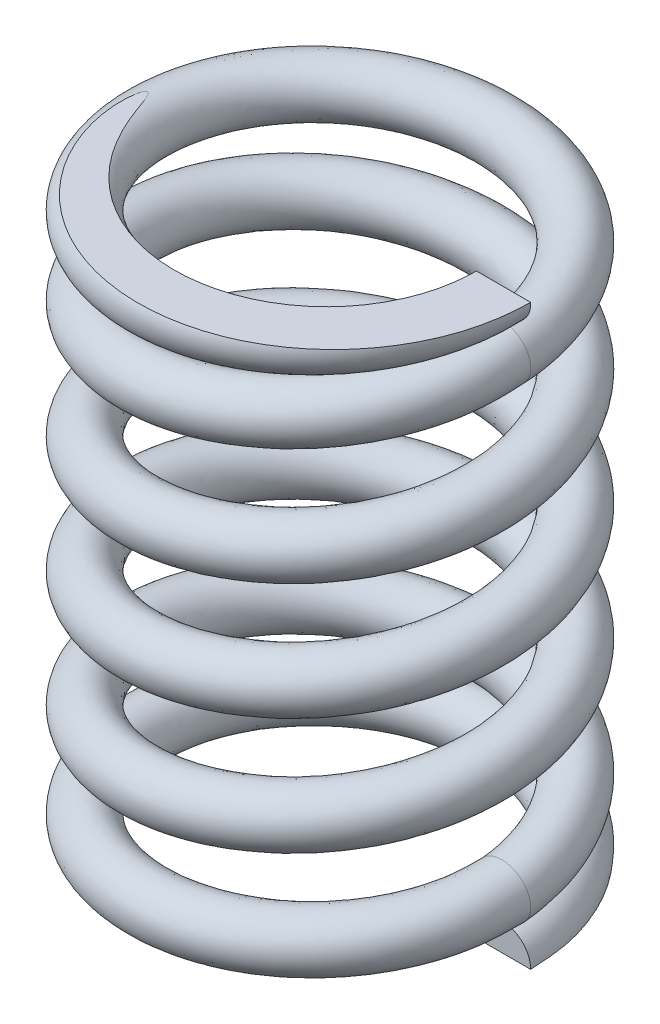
ISO-10303-21;
HEADER;
FILE_DESCRIPTION(('STEP AP214'),'2;1');
FILE_NAME('part.step','',(''),(''),'','','');
FILE_SCHEMA(('AUTOMOTIVE_DESIGN { 1 0 10303 214 1 1 1 1 }'));
ENDSEC;
DATA;
#1=APPLICATION_CONTEXT('core data for automotive mechanical design processes');
#2=APPLICATION_PROTOCOL_DEFINITION('international standard','automotive_design',2000,#1);
#3=PRODUCT_CONTEXT('',#1,'mechanical');
#4=PRODUCT('Part','Part','',(#3));
#5=PRODUCT_RELATED_PRODUCT_CATEGORY('part','',(#4));
#6=PRODUCT_DEFINITION_FORMATION('','',#4);
#7=PRODUCT_DEFINITION_CONTEXT('part definition',#1,'design');
#8=PRODUCT_DEFINITION('design','',#6,#7);
#9=PRODUCT_DEFINITION_SHAPE('','',#8);
#10=(LENGTH_UNIT() NAMED_UNIT(*) SI_UNIT(.MILLI.,.METRE.));
#11=(NAMED_UNIT(*) PLANE_ANGLE_UNIT() SI_UNIT($,.RADIAN.));
#12=(NAMED_UNIT(*) SI_UNIT($,.STERADIAN.) SOLID_ANGLE_UNIT());
#13=UNCERTAINTY_MEASURE_WITH_UNIT(LENGTH_MEASURE(1.E-05),#10,'distance_accuracy_value','');
#14=(GEOMETRIC_REPRESENTATION_CONTEXT(3) GLOBAL_UNCERTAINTY_ASSIGNED_CONTEXT((#13)) GLOBAL_UNIT_ASSIGNED_CONTEXT((#10,
#11,#12)) REPRESENTATION_CONTEXT('',''));
#15=CARTESIAN_POINT('',(0.,0.,0.));
#16=DIRECTION('',(0.,0.,1.));
#17=DIRECTION('',(1.,0.,0.));
#18=AXIS2_PLACEMENT_3D('',#15,#16,#17);
#19=CARTESIAN_POINT('',(4.625,0.,0.));
#20=CARTESIAN_POINT('',(4.60748006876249,0.0132611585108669,-0.302112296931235));
#21=CARTESIAN_POINT('',(4.57236084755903,0.0398435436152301,-0.907705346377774));
#22=CARTESIAN_POINT('',(4.2991011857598,0.0796660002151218,-1.78044672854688));
#23=CARTESIAN_POINT('',(3.8705537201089,0.119593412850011,-2.58636798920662));
#24=CARTESIAN_POINT('',(3.22722730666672,0.163837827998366,-3.36966419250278));
#25=CARTESIAN_POINT('',(2.33946330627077,0.212532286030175,-4.05073588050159));
#26=CARTESIAN_POINT('',(1.21027059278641,0.26573643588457,-4.51866731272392));
#27=CARTESIAN_POINT('',(-3.37989954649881E-05,0.318850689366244,-4.6782086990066));
#28=CARTESIAN_POINT('',(-1.21025206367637,0.37196592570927,-4.51857165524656));
#29=CARTESIAN_POINT('',(-2.33932640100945,0.425158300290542,-4.0509109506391));
#30=CARTESIAN_POINT('',(-3.30800862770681,0.478274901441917,-3.30800805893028));
#31=CARTESIAN_POINT('',(-4.05090798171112,0.53139232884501,-2.33931813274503));
#32=CARTESIAN_POINT('',(-4.51857209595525,0.584582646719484,-1.21027738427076));
#33=CARTESIAN_POINT('',(-4.67823219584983,0.63769999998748,-2.91265164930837E-10));
#34=CARTESIAN_POINT('',(-4.51857209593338,0.69081735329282,1.21027738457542));
#35=CARTESIAN_POINT('',(-4.05090798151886,0.744007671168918,2.33931813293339));
#36=CARTESIAN_POINT('',(-3.30800862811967,0.79712509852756,3.30800805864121));
#37=CARTESIAN_POINT('',(-2.33932640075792,0.850241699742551,4.05091095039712));
#38=CARTESIAN_POINT('',(-1.21025206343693,0.903434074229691,4.51857165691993));
#39=CARTESIAN_POINT('',(-3.37994623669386E-05,0.95654931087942,4.67820869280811));
#40=CARTESIAN_POINT('',(1.2102705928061,1.00966356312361,4.51866733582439));
#41=CARTESIAN_POINT('',(2.33946330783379,1.06286771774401,4.05073579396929));
#42=CARTESIAN_POINT('',(3.22722730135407,1.11156215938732,3.3696644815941));
#43=CARTESIAN_POINT('',(3.87055373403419,1.15580662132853,2.58636720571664));
#44=CARTESIAN_POINT('',(4.29910113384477,1.19573387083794,1.78044968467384));
#45=CARTESIAN_POINT('',(4.57236512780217,1.23555753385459,0.907681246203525));
#46=CARTESIAN_POINT('',(4.6074812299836,1.26213900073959,0.302108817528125));
#47=CARTESIAN_POINT('',(4.62499999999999,1.2754,0.));
#48=CARTESIAN_POINT('',(4.625,1.25,0.));
#49=CARTESIAN_POINT('',(4.60748574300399,1.2632611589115,-0.302117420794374));
#50=CARTESIAN_POINT('',(4.57237789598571,1.28984354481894,-0.907720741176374));
#51=CARTESIAN_POINT('',(4.29899459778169,1.32966599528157,-1.78037966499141));
#52=CARTESIAN_POINT('',(3.87041009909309,1.36959340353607,-2.58628640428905));
#53=CARTESIAN_POINT('',(3.22725586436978,1.41383783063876,-3.36966217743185));
#54=CARTESIAN_POINT('',(2.33949733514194,1.46253228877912,-4.05082435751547));
#55=CARTESIAN_POINT('',(1.21019392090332,1.51573642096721,-4.51843301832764));
#56=CARTESIAN_POINT('',(1.64226464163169E-06,1.56885069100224,-4.67817817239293));
#57=CARTESIAN_POINT('',(-1.21028372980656,1.62196592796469,-4.51862689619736));
#58=CARTESIAN_POINT('',(-2.33923837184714,1.67515828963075,-4.05073201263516));
#59=CARTESIAN_POINT('',(-3.30794158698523,1.72827490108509,-3.3079895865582));
#60=CARTESIAN_POINT('',(-4.05096926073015,1.78139233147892,-2.33933675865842));
#61=CARTESIAN_POINT('',(-4.51838924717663,1.83458263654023,-1.21021378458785));
#62=CARTESIAN_POINT('',(-4.67816729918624,1.88769999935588,-3.44396331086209E-05));
#63=CARTESIAN_POINT('',(-4.51862951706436,1.94081735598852,1.21030751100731));
#64=CARTESIAN_POINT('',(-4.05073433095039,1.99400766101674,2.33923443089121));
#65=CARTESIAN_POINT('',(-3.30798389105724,2.04712509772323,3.30793500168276));
#66=CARTESIAN_POINT('',(-2.3393494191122,2.10024170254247,4.05097659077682));
#67=CARTESIAN_POINT('',(-1.2101869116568,2.1534340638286,4.51839444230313));
#68=CARTESIAN_POINT('',(-6.92342408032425E-05,2.20654930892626,4.67809652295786));
#69=CARTESIAN_POINT('',(1.21031378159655,2.25966356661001,4.51882434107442));
#70=CARTESIAN_POINT('',(2.33936422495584,2.31286770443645,4.05035536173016));
#71=CARTESIAN_POINT('',(3.22710925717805,2.36156215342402,3.37017310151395));
#72=CARTESIAN_POINT('',(3.87058996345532,2.40580662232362,2.58474946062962));
#73=CARTESIAN_POINT('',(4.2990883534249,2.44573387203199,1.78660996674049));
#74=CARTESIAN_POINT('',(4.57222129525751,2.48555752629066,0.884682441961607));
#75=CARTESIAN_POINT('',(4.60734747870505,2.51213899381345,0.351331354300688));
#76=CARTESIAN_POINT('',(4.62487127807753,2.52539999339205,0.0852524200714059));
#77=CARTESIAN_POINT('',(3.375,1.25,0.));
#78=CARTESIAN_POINT('',(3.36219152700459,1.26326824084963,-0.220236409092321));
#79=CARTESIAN_POINT('',(3.33651656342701,1.28986482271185,-0.661706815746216));
#80=CARTESIAN_POINT('',(3.13662534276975,1.32954213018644,-1.30056230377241));
#81=CARTESIAN_POINT('',(2.82435088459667,1.36942882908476,-1.88689333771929));
#82=CARTESIAN_POINT('',(2.35568890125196,1.41385745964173,-2.45853520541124));
#83=CARTESIAN_POINT('',(1.70586591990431,1.46262450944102,-2.9566390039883));
#84=CARTESIAN_POINT('',(0.884070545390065,1.51549300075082,-3.29670475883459));
#85=CARTESIAN_POINT('',(6.13540972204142E-05,1.56882148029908,-3.4140224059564));
#86=CARTESIAN_POINT('',(-0.884138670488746,1.62202503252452,-3.29695860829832));
#87=CARTESIAN_POINT('',(-1.70604060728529,1.6749630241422,-2.95624187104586));
#88=CARTESIAN_POINT('',(-2.41403502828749,1.72821509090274,-2.41408170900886));
#89=CARTESIAN_POINT('',(-2.95648042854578,1.78145269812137,-1.70614187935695));
#90=CARTESIAN_POINT('',(-3.29673433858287,1.83439306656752,-0.884023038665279));
#91=CARTESIAN_POINT('',(-3.41399026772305,1.8876358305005,-3.15895427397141E-05));
#92=CARTESIAN_POINT('',(-3.29697312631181,1.94087858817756,0.884122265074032));
#93=CARTESIAN_POINT('',(-2.95624265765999,1.99381895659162,1.70604448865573));
#94=CARTESIAN_POINT('',(-2.4140733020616,2.04705657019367,2.41403115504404));
#95=CARTESIAN_POINT('',(-1.70614671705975,2.10030863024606,2.95648928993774));
#96=CARTESIAN_POINT('',(-0.884036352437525,2.15324662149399,3.29672763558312));
#97=CARTESIAN_POINT('',(-3.82225158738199E-06,2.20645018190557,3.41394076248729));
#98=CARTESIAN_POINT('',(0.884195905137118,2.25977864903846,3.2970945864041));
#99=CARTESIAN_POINT('',(1.70573774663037,2.31264714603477,2.95616719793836));
#100=CARTESIAN_POINT('',(2.3555464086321,2.36141418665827,2.4590421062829));
#101=CARTESIAN_POINT('',(2.82453388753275,2.40584285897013,1.8853519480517));
#102=CARTESIAN_POINT('',(3.13672126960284,2.44572939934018,1.30678633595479));
#103=CARTESIAN_POINT('',(3.33635992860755,2.48540790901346,0.638670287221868));
#104=CARTESIAN_POINT('',(3.36205332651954,2.51200357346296,0.269443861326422));
#105=CARTESIAN_POINT('',(3.37487128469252,2.52527165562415,0.0852436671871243));
#106=CARTESIAN_POINT('',(3.375,0.,0.));
#107=CARTESIAN_POINT('',(3.36218585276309,0.013268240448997,-0.220231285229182));
#108=CARTESIAN_POINT('',(3.33649951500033,0.0398648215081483,-0.661691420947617));
#109=CARTESIAN_POINT('',(3.13673193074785,0.0795421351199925,-1.30062936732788));
#110=CARTESIAN_POINT('',(2.82449450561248,0.119428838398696,-1.88697492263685));
#111=CARTESIAN_POINT('',(2.3556603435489,0.163857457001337,-2.45853722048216));
#112=CARTESIAN_POINT('',(1.70583189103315,0.212624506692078,-2.95655052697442));
#113=CARTESIAN_POINT('',(0.884147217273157,0.265493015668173,-3.29693905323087));
#114=CARTESIAN_POINT('',(2.59128371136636E-05,0.318821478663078,-3.41405293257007));
#115=CARTESIAN_POINT('',(-0.884107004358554,0.372025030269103,-3.29690336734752));
#116=CARTESIAN_POINT('',(-1.70612863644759,0.424963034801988,-2.9564208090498));
#117=CARTESIAN_POINT('',(-2.41410206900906,0.478215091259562,-2.41410018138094));
#118=CARTESIAN_POINT('',(-2.95641914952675,0.531452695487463,-1.70612325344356));
#119=CARTESIAN_POINT('',(-3.29691718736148,0.584393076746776,-0.884086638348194));
#120=CARTESIAN_POINT('',(-3.41405516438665,0.637635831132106,2.84979910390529E-06));
#121=CARTESIAN_POINT('',(-3.29691570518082,0.69087858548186,0.884092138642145));
#122=CARTESIAN_POINT('',(-2.95641630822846,0.743818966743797,1.70612819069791));
#123=CARTESIAN_POINT('',(-2.41409803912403,0.797056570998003,2.41410421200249));
#124=CARTESIAN_POINT('',(-1.70612369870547,0.850308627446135,2.95642364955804));
#125=CARTESIAN_POINT('',(-0.88410150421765,0.903246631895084,3.29690485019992));
#126=CARTESIAN_POINT('',(3.16125268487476E-05,0.956450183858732,3.41405293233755));
#127=CARTESIAN_POINT('',(0.884152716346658,1.00977864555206,3.29693758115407));
#128=CARTESIAN_POINT('',(1.70583682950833,1.06264715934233,2.9565476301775));
#129=CARTESIAN_POINT('',(2.35566445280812,1.11141419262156,2.45853348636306));
#130=CARTESIAN_POINT('',(2.82449765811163,1.15584285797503,1.88696969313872));
#131=CARTESIAN_POINT('',(3.13673405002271,1.19572939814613,1.30062605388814));
#132=CARTESIAN_POINT('',(3.33650376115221,1.23540791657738,0.661669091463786));
#133=CARTESIAN_POINT('',(3.36218707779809,1.26200358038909,0.22022132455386));
#134=CARTESIAN_POINT('',(3.37500000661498,1.2752716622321,-8.75288429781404E-06));
#135=CARTESIAN_POINT('',(3.375,-1.25,0.));
#136=CARTESIAN_POINT('',(3.36218017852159,-1.23673175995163,-0.220226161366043));
#137=CARTESIAN_POINT('',(3.33648246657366,-1.21013517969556,-0.661676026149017));
#138=CARTESIAN_POINT('',(3.13683851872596,-1.17045785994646,-1.30069643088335));
#139=CARTESIAN_POINT('',(2.82463812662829,-1.13057115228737,-1.88705650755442));
#140=CARTESIAN_POINT('',(2.35563178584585,-1.08614254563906,-2.45853923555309));
#141=CARTESIAN_POINT('',(1.70579786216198,-1.03737549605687,-2.95646204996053));
#142=CARTESIAN_POINT('',(0.88422388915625,-0.984506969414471,-3.29717334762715));
#143=CARTESIAN_POINT('',(-9.52842299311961E-06,-0.931178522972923,-3.41408345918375));
#144=CARTESIAN_POINT('',(-0.884075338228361,-0.877974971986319,-3.29684812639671));
#145=CARTESIAN_POINT('',(-1.7062166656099,-0.825036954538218,-2.95659974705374));
#146=CARTESIAN_POINT('',(-2.41416910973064,-0.771784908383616,-2.41411865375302));
#147=CARTESIAN_POINT('',(-2.95635787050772,-0.718547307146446,-1.70610462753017));
#148=CARTESIAN_POINT('',(-3.2971000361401,-0.665606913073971,-0.884150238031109));
#149=CARTESIAN_POINT('',(-3.41412006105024,-0.612364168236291,3.72891409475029E-05));
#150=CARTESIAN_POINT('',(-3.29685828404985,-0.559121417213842,0.88406201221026));
#151=CARTESIAN_POINT('',(-2.95658995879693,-0.506181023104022,1.70621189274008));
#152=CARTESIAN_POINT('',(-2.41412277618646,-0.452943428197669,2.41417726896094));
#153=CARTESIAN_POINT('',(-1.7061006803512,-0.399691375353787,2.95635800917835));
#154=CARTESIAN_POINT('',(-0.884166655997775,-0.346753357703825,3.29708206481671));
#155=CARTESIAN_POINT('',(6.7047305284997E-05,-0.29354981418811,3.41416510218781));
#156=CARTESIAN_POINT('',(0.884109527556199,-0.240221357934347,3.29678057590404));
#157=CARTESIAN_POINT('',(1.70593591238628,-0.187352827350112,2.95692806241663));
#158=CARTESIAN_POINT('',(2.35578249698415,-0.138585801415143,2.45802486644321));
#159=CARTESIAN_POINT('',(2.8244614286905,-0.0941571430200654,1.88858743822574));
#160=CARTESIAN_POINT('',(3.13674683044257,-0.0542706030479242,1.29446577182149));
#161=CARTESIAN_POINT('',(3.33664759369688,-0.0145920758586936,0.684667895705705));
#162=CARTESIAN_POINT('',(3.36232082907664,0.0120035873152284,0.170998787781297));
#163=CARTESIAN_POINT('',(3.37512872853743,0.0252716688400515,-0.0852611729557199));
#164=CARTESIAN_POINT('',(4.625,-1.25,0.));
#165=CARTESIAN_POINT('',(4.607474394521,-1.23673884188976,-0.302107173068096));
#166=CARTESIAN_POINT('',(4.57234379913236,-1.21015645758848,-0.907689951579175));
#167=CARTESIAN_POINT('',(4.29920777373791,-1.17033399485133,-1.78051379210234));
#168=CARTESIAN_POINT('',(3.87069734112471,-1.13040657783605,-2.58644957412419));
#169=CARTESIAN_POINT('',(3.22719874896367,-1.08616217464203,-3.3696662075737));
#170=CARTESIAN_POINT('',(2.3394292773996,-1.03746771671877,-4.05064740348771));
#171=CARTESIAN_POINT('',(1.2103472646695,-0.984263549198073,-4.5189016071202));
#172=CARTESIAN_POINT('',(-6.92402555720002E-05,-0.931149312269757,-4.67823922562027));
#173=CARTESIAN_POINT('',(-1.21022039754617,-0.878034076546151,-4.51851641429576));
#174=CARTESIAN_POINT('',(-2.33941443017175,-0.824841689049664,-4.05108988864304));
#175=CARTESIAN_POINT('',(-3.30807566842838,-0.771725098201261,-3.30802653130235));
#176=CARTESIAN_POINT('',(-4.05084670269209,-0.718607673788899,-2.33929950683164));
#177=CARTESIAN_POINT('',(-4.51875494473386,-0.665417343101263,-1.21034098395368));
#178=CARTESIAN_POINT('',(-4.67829709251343,-0.612299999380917,3.44390505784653E-05));
#179=CARTESIAN_POINT('',(-4.5185146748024,-0.559182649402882,1.21024725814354));
#180=CARTESIAN_POINT('',(-4.05108163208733,-0.505992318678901,2.33940183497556));
#181=CARTESIAN_POINT('',(-3.3080333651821,-0.452874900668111,3.30808111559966));
#182=CARTESIAN_POINT('',(-2.33930338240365,-0.399758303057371,4.05084531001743));
#183=CARTESIAN_POINT('',(-1.21031721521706,-0.346565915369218,4.51874887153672));
#184=CARTESIAN_POINT('',(1.63531606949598E-06,-0.293450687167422,4.67832086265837));
#185=CARTESIAN_POINT('',(1.21022740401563,-0.240336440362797,4.51851033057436));
#186=CARTESIAN_POINT('',(2.33956239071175,-0.187132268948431,4.05111622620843));
#187=CARTESIAN_POINT('',(3.22734534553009,-0.138437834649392,3.36915586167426));
#188=CARTESIAN_POINT('',(3.87051750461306,-0.0941933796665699,2.58798495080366));
#189=CARTESIAN_POINT('',(4.29911391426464,-0.0542661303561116,1.77428940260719));
#190=CARTESIAN_POINT('',(4.57250896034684,-0.01444245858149,0.930680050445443));
#191=CARTESIAN_POINT('',(4.60761498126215,0.0121390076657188,0.252886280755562));
#192=CARTESIAN_POINT('',(4.62512872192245,0.0254000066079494,-0.0852524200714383));
#193=CARTESIAN_POINT('',(4.625,0.,0.));
#194=CARTESIAN_POINT('',(4.60748006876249,0.0132611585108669,-0.302112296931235));
#195=CARTESIAN_POINT('',(4.57236084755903,0.0398435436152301,-0.907705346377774));
#196=CARTESIAN_POINT('',(4.2991011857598,0.0796660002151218,-1.78044672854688));
#197=CARTESIAN_POINT('',(3.8705537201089,0.119593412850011,-2.58636798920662));
#198=CARTESIAN_POINT('',(3.22722730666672,0.163837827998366,-3.36966419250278));
#199=CARTESIAN_POINT('',(2.33946330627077,0.212532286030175,-4.05073588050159));
#200=CARTESIAN_POINT('',(1.21027059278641,0.26573643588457,-4.51866731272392));
#201=CARTESIAN_POINT('',(-3.37989954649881E-05,0.318850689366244,-4.6782086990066));
#202=CARTESIAN_POINT('',(-1.21025206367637,0.37196592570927,-4.51857165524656));
#203=CARTESIAN_POINT('',(-2.33932640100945,0.425158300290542,-4.0509109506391));
#204=CARTESIAN_POINT('',(-3.30800862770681,0.478274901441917,-3.30800805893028));
#205=CARTESIAN_POINT('',(-4.05090798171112,0.53139232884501,-2.33931813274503));
#206=CARTESIAN_POINT('',(-4.51857209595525,0.584582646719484,-1.21027738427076));
#207=CARTESIAN_POINT('',(-4.67823219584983,0.63769999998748,-2.91265164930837E-10));
#208=CARTESIAN_POINT('',(-4.51857209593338,0.69081735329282,1.21027738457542));
#209=CARTESIAN_POINT('',(-4.05090798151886,0.744007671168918,2.33931813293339));
#210=CARTESIAN_POINT('',(-3.30800862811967,0.79712509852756,3.30800805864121));
#211=CARTESIAN_POINT('',(-2.33932640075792,0.850241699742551,4.05091095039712));
#212=CARTESIAN_POINT('',(-1.21025206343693,0.903434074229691,4.51857165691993));
#213=CARTESIAN_POINT('',(-3.37994623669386E-05,0.95654931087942,4.67820869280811));
#214=CARTESIAN_POINT('',(1.2102705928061,1.00966356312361,4.51866733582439));
#215=CARTESIAN_POINT('',(2.33946330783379,1.06286771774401,4.05073579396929));
#216=CARTESIAN_POINT('',(3.22722730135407,1.11156215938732,3.3696644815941));
#217=CARTESIAN_POINT('',(3.87055373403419,1.15580662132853,2.58636720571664));
#218=CARTESIAN_POINT('',(4.29910113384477,1.19573387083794,1.78044968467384));
#219=CARTESIAN_POINT('',(4.57236512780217,1.23555753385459,0.907681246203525));
#220=CARTESIAN_POINT('',(4.6074812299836,1.26213900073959,0.302108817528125));
#221=CARTESIAN_POINT('',(4.62499999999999,1.2754,0.));
#222=(BOUNDED_SURFACE() B_SPLINE_SURFACE(3,3,((#19,#20,#21,#22,#23,#24,#25,#26,#27,#28,#29,#30,
#31,#32,#33,#34,#35,#36,#37,#38,#39,#40,#41,#42,#43,#44,#45,#46,#47),(#48,#49,#50,#51,#52,#53,
#54,#55,#56,#57,#58,#59,#60,#61,#62,#63,#64,#65,#66,#67,#68,#69,#70,#71,#72,#73,#74,#75,#76),
(#77,#78,#79,#80,#81,#82,#83,#84,#85,#86,#87,#88,#89,#90,#91,#92,#93,#94,#95,#96,#97,#98,#99,
#100,#101,#102,#103,#104,#105),(#106,#107,#108,#109,#110,#111,#112,#113,#114,#115,#116,#117,
#118,#119,#120,#121,#122,#123,#124,#125,#126,#127,#128,#129,#130,#131,#132,#133,#134),(#135,
#136,#137,#138,#139,#140,#141,#142,#143,#144,#145,#146,#147,#148,#149,#150,#151,#152,#153,#154,
#155,#156,#157,#158,#159,#160,#161,#162,#163),(#164,#165,#166,#167,#168,#169,#170,#171,#172,
#173,#174,#175,#176,#177,#178,#179,#180,#181,#182,#183,#184,#185,#186,#187,#188,#189,#190,#191,
#192),(#193,#194,#195,#196,#197,#198,#199,#200,#201,#202,#203,#204,#205,#206,#207,#208,#209,
#210,#211,#212,#213,#214,#215,#216,#217,#218,#219,#220,#221)),.UNSPECIFIED.,.T.,.F.,
.F.) B_SPLINE_SURFACE_WITH_KNOTS((4,3,4),(4,1,1,1,1,1,1,1,1,1,1,1,1,1,1,1,1,1,1,1,1,1,1,1,1,1,
4),(0.,0.5,1.),(0.,0.031213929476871,0.0625692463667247,0.0938483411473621,0.12511004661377,
0.166780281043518,0.208414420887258,0.250076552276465,0.291740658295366,0.333374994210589,
0.375038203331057,0.41670145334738,0.458336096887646,0.499999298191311,0.541662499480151,
0.583297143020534,0.624960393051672,0.666623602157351,0.708257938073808,0.749922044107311,
0.79158417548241,0.833218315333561,0.874888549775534,0.906150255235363,0.937429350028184,
0.968784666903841,1.),
.UNSPECIFIED.) GEOMETRIC_REPRESENTATION_ITEM() RATIONAL_B_SPLINE_SURFACE(((1.,1.,1.,1.,1.,1.,1.,
1.,1.,1.,1.,1.,1.,1.,1.,1.,1.,1.,1.,1.,1.,1.,1.,1.,1.,1.,1.,1.,1.),(0.333333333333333,
0.333333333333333,0.333333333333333,0.333333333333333,0.333333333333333,0.333333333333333,
0.333333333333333,0.333333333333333,0.333333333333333,0.333333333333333,0.333333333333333,
0.333333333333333,0.333333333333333,0.333333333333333,0.333333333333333,0.333333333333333,
0.333333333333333,0.333333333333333,0.333333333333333,0.333333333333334,0.333333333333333,
0.333333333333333,0.333333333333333,0.333333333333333,0.333333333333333,0.333333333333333,
0.333333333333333,0.333333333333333,0.333333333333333),(0.333333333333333,0.333333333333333,
0.333333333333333,0.333333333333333,0.333333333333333,0.333333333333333,0.333333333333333,
0.333333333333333,0.333333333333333,0.333333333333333,0.333333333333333,0.333333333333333,
0.333333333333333,0.333333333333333,0.333333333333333,0.333333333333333,0.333333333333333,
0.333333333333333,0.333333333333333,0.333333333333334,0.333333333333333,0.333333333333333,
0.333333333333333,0.333333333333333,0.333333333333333,0.333333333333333,0.333333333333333,
0.333333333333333,0.333333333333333),(1.,1.,1.,1.,1.,1.,1.,1.,1.,1.,1.,1.,1.,1.,1.,1.,1.,1.,1.,
1.,1.,1.,1.,1.,1.,1.,1.,1.,1.),(0.333333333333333,0.333333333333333,0.333333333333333,
0.333333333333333,0.333333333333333,0.333333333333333,0.333333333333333,0.333333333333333,
0.333333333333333,0.333333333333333,0.333333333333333,0.333333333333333,0.333333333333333,
0.333333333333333,0.333333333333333,0.333333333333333,0.333333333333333,0.333333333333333,
0.333333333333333,0.333333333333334,0.333333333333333,0.333333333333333,0.333333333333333,
0.333333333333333,0.333333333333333,0.333333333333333,0.333333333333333,0.333333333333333,
0.333333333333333),(0.333333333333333,0.333333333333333,0.333333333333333,0.333333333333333,
0.333333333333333,0.333333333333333,0.333333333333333,0.333333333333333,0.333333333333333,
0.333333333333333,0.333333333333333,0.333333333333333,0.333333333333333,0.333333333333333,
0.333333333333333,0.333333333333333,0.333333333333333,0.333333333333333,0.333333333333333,
0.333333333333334,0.333333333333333,0.333333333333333,0.333333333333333,0.333333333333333,
0.333333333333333,0.333333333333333,0.333333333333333,0.333333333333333,0.333333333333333),(1.,
1.,1.,1.,1.,1.,1.,1.,1.,1.,1.,1.,1.,1.,1.,1.,1.,1.,1.,1.,1.,1.,1.,1.,1.,1.,1.,1.,1.))) REPRESENTATION_ITEM('') SURFACE());
#223=CARTESIAN_POINT('',(4.,0.,0.));
#224=DIRECTION('',(0.,0.,1.));
#225=DIRECTION('',(1.,0.,0.));
#226=AXIS2_PLACEMENT_3D('',#223,#224,#225);
#227=CIRCLE('',#226,0.625);
#228=CARTESIAN_POINT('',(4.625,0.,0.));
#229=VERTEX_POINT('',#228);
#230=CARTESIAN_POINT('',(3.375,0.,0.));
#231=VERTEX_POINT('',#230);
#232=EDGE_CURVE('E67',#229,#231,#227,.T.);
#233=CARTESIAN_POINT('',(4.625,0.,0.));
#234=CARTESIAN_POINT('',(4.62099276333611,0.,-0.069062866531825));
#235=CARTESIAN_POINT('',(4.61696665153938,0.,-0.138136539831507));
#236=CARTESIAN_POINT('',(4.60797492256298,0.,-0.276425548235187));
#237=CARTESIAN_POINT('',(4.60300656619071,0.,-0.345640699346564));
#238=CARTESIAN_POINT('',(4.59123769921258,0.,-0.483971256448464));
#239=CARTESIAN_POINT('',(4.58443593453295,0.,-0.553086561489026));
#240=CARTESIAN_POINT('',(4.56809508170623,0.,-0.691049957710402));
#241=CARTESIAN_POINT('',(4.5585544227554,0.,-0.759897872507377));
#242=CARTESIAN_POINT('',(4.54151289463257,0.,-0.862677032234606));
#243=CARTESIAN_POINT('',(4.53538145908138,0.,-0.896835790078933));
#244=CARTESIAN_POINT('',(4.52213830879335,0.,-0.96496230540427));
#245=CARTESIAN_POINT('',(4.51502659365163,0.,-0.998930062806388));
#246=CARTESIAN_POINT('',(4.49230179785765,0.,-1.10049546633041));
#247=CARTESIAN_POINT('',(4.47529401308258,0.,-1.16778554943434));
#248=CARTESIAN_POINT('',(4.43927386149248,0.,-1.29626220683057));
#249=CARTESIAN_POINT('',(4.4205155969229,0.,-1.35752078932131));
#250=CARTESIAN_POINT('',(4.38027582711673,0.,-1.47914477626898));
#251=CARTESIAN_POINT('',(4.35879394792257,0.,-1.53951005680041));
#252=CARTESIAN_POINT('',(4.31328065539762,0.,-1.65935578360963));
#253=CARTESIAN_POINT('',(4.28924610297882,0.,-1.71883503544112));
#254=CARTESIAN_POINT('',(4.23882810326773,0.,-1.83678175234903));
#255=CARTESIAN_POINT('',(4.21244473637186,0.,-1.89524925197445));
#256=CARTESIAN_POINT('',(4.12976881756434,0.,-2.06898780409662));
#257=CARTESIAN_POINT('',(4.06994579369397,0.,-2.18260715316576));
#258=CARTESIAN_POINT('',(3.94105486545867,0.,-2.40435559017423));
#259=CARTESIAN_POINT('',(3.87199392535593,0.,-2.51248873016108));
#260=CARTESIAN_POINT('',(3.72497369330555,0.,-2.72221784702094));
#261=CARTESIAN_POINT('',(3.64703206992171,0.,-2.82382619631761));
#262=CARTESIAN_POINT('',(3.48279387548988,0.,-3.02009980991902));
#263=CARTESIAN_POINT('',(3.39649463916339,0.,-3.11476284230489));
#264=CARTESIAN_POINT('',(3.21619729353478,0.,-3.29639175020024));
#265=CARTESIAN_POINT('',(3.12220156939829,0.,-3.3833599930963));
#266=CARTESIAN_POINT('',(2.92719817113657,0.,-3.54904337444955));
#267=CARTESIAN_POINT('',(2.82619041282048,0.,-3.62775841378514));
#268=CARTESIAN_POINT('',(2.61856900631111,0.,-3.77589739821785));
#269=CARTESIAN_POINT('',(2.51199619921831,0.,-3.84537857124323));
#270=CARTESIAN_POINT('',(2.29334806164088,0.,-3.97507478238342));
#271=CARTESIAN_POINT('',(2.18127258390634,0.,-4.03528957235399));
#272=CARTESIAN_POINT('',(1.95243355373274,0.,-4.14603757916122));
#273=CARTESIAN_POINT('',(1.83566984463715,0.,-4.19657047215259));
#274=CARTESIAN_POINT('',(1.59830041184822,0.,-4.28761961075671));
#275=CARTESIAN_POINT('',(1.47769473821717,0.,-4.32813598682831));
#276=CARTESIAN_POINT('',(1.23370596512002,0.,-4.39868741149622));
#277=CARTESIAN_POINT('',(1.11032869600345,0.,-4.42874260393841));
#278=CARTESIAN_POINT('',(0.861460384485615,0.,-4.47822402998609));
#279=CARTESIAN_POINT('',(0.735969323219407,0.,-4.49765016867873));
#280=CARTESIAN_POINT('',(0.48380128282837,0.,-4.52576034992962));
#281=CARTESIAN_POINT('',(0.357124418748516,0.,-4.53444542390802));
#282=CARTESIAN_POINT('',(0.103491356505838,0.,-4.54091382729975));
#283=CARTESIAN_POINT('',(-0.0234648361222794,0.,-4.53869737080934));
#284=CARTESIAN_POINT('',(-0.274985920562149,0.,-4.5234268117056));
#285=CARTESIAN_POINT('',(-0.399559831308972,0.,-4.51052072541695));
#286=CARTESIAN_POINT('',(-0.647166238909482,0.,-4.47419968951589));
#287=CARTESIAN_POINT('',(-0.770198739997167,0.,-4.45078476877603));
#288=CARTESIAN_POINT('',(-1.01383227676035,0.,-4.39353903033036));
#289=CARTESIAN_POINT('',(-1.13443306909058,0.,-4.35970717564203));
#290=CARTESIAN_POINT('',(-1.37227963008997,0.,-4.28179928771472));
#291=CARTESIAN_POINT('',(-1.48952540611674,0.,-4.23772327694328));
#292=CARTESIAN_POINT('',(-1.71841650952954,0.,-4.14026996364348));
#293=CARTESIAN_POINT('',(-1.83011229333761,0.,-4.08701112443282));
#294=CARTESIAN_POINT('',(-2.0485419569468,0.,-3.97114147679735));
#295=CARTESIAN_POINT('',(-2.15527607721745,0.,-3.90853112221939));
#296=CARTESIAN_POINT('',(-2.36288495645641,0.,-3.77431123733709));
#297=CARTESIAN_POINT('',(-2.4637614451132,0.,-3.7027043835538));
#298=CARTESIAN_POINT('',(-2.65891446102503,0.,-3.55100239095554));
#299=CARTESIAN_POINT('',(-2.7531911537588,0.,-3.4709074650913));
#300=CARTESIAN_POINT('',(-2.93230507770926,0.,-3.30464827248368));
#301=CARTESIAN_POINT('',(-3.01730744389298,0.,-3.2186619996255));
#302=CARTESIAN_POINT('',(-3.17946978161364,0.,-3.03957525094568));
#303=CARTESIAN_POINT('',(-3.2566294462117,0.,-2.94647449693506));
#304=CARTESIAN_POINT('',(-3.40252218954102,0.,-2.75374396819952));
#305=CARTESIAN_POINT('',(-3.47124695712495,0.,-2.65410789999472));
#306=CARTESIAN_POINT('',(-3.59949873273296,0.,-2.44909820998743));
#307=CARTESIAN_POINT('',(-3.65902748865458,0.,-2.34372568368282));
#308=CARTESIAN_POINT('',(-3.76578145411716,0.,-2.13258515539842));
#309=CARTESIAN_POINT('',(-3.81342596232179,0.,-2.02702940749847));
#310=CARTESIAN_POINT('',(-3.89898175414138,0.,-1.81197305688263));
#311=CARTESIAN_POINT('',(-3.93688766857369,0.,-1.70247031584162));
#312=CARTESIAN_POINT('',(-4.00211092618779,0.,-1.48047089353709));
#313=CARTESIAN_POINT('',(-4.02944307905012,0.,-1.36797863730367));
#314=CARTESIAN_POINT('',(-4.06158947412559,0.,-1.19767455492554));
#315=CARTESIAN_POINT('',(-4.07082723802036,0.,-1.14067429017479));
#316=CARTESIAN_POINT('',(-4.08611438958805,0.,-1.02625298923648));
#317=CARTESIAN_POINT('',(-4.09216480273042,0.,-0.968832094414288));
#318=CARTESIAN_POINT('',(-4.09929161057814,0.,-0.8729664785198));
#319=CARTESIAN_POINT('',(-4.1013545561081,0.,-0.834593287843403));
#320=CARTESIAN_POINT('',(-4.10373758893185,0.,-0.757772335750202));
#321=CARTESIAN_POINT('',(-4.10405701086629,0.,-0.71932455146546));
#322=CARTESIAN_POINT('',(-4.10266648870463,0.,-0.642607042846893));
#323=CARTESIAN_POINT('',(-4.10096404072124,0.,-0.604337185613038));
#324=CARTESIAN_POINT('',(-4.09505823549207,0.,-0.527999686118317));
#325=CARTESIAN_POINT('',(-4.09085763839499,0.,-0.489931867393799));
#326=CARTESIAN_POINT('',(-4.08173190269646,0.,-0.433319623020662));
#327=CARTESIAN_POINT('',(-4.07822350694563,0.,-0.414546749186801));
#328=CARTESIAN_POINT('',(-4.06989162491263,0.,-0.377256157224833));
#329=CARTESIAN_POINT('',(-4.06506738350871,0.,-0.358738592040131));
#330=CARTESIAN_POINT('',(-4.05618213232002,0.,-0.331464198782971));
#331=CARTESIAN_POINT('',(-4.05293906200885,0.,-0.322442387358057));
#332=CARTESIAN_POINT('',(-4.04565140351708,0.,-0.304738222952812));
#333=CARTESIAN_POINT('',(-4.04160960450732,0.,-0.296054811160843));
#334=CARTESIAN_POINT('',(-4.0334303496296,0.,-0.28155593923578));
#335=CARTESIAN_POINT('',(-4.02958361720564,0.,-0.275576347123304));
#336=CARTESIAN_POINT('',(-4.02063757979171,0.,-0.264395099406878));
#337=CARTESIAN_POINT('',(-4.01552932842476,0.,-0.25919944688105));
#338=CARTESIAN_POINT('',(-4.00615542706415,0.,-0.253167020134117));
#339=CARTESIAN_POINT('',(-4.0025314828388,0.,-0.251419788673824));
#340=CARTESIAN_POINT('',(-3.99483447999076,0.,-0.249328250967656));
#341=CARTESIAN_POINT('',(-3.99075849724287,0.,-0.248993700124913));
#342=CARTESIAN_POINT('',(-3.98317895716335,0.,-0.249780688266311));
#343=CARTESIAN_POINT('',(-3.97965793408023,1.62087391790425E-13,-0.250766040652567));
#344=CARTESIAN_POINT('',(-3.97059703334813,2.57419239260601E-13,-0.254515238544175));
#345=CARTESIAN_POINT('',(-3.96540698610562,0.,-0.258046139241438));
#346=CARTESIAN_POINT('',(-3.95423654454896,-1.08571678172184E-13,-0.267411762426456));
#347=CARTESIAN_POINT('',(-3.9486154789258,0.,-0.273620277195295));
#348=CARTESIAN_POINT('',(-3.93818527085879,0.,-0.286723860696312));
#349=CARTESIAN_POINT('',(-3.93338231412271,0.,-0.293623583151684));
#350=CARTESIAN_POINT('',(-3.92387367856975,0.,-0.308445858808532));
#351=CARTESIAN_POINT('',(-3.9192226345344,0.,-0.316402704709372));
#352=CARTESIAN_POINT('',(-3.9103290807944,0.,-0.332543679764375));
#353=CARTESIAN_POINT('',(-3.90608684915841,0.,-0.340727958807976));
#354=CARTESIAN_POINT('',(-3.89375796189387,0.,-0.36551758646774));
#355=CARTESIAN_POINT('',(-3.88608760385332,0.,-0.382328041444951));
#356=CARTESIAN_POINT('',(-3.87130942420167,0.,-0.416191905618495));
#357=CARTESIAN_POINT('',(-3.86420177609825,0.,-0.433245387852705));
#358=CARTESIAN_POINT('',(-3.85031403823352,0.,-0.467457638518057));
#359=CARTESIAN_POINT('',(-3.84353350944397,0.,-0.484616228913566));
#360=CARTESIAN_POINT('',(-3.82355724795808,0.,-0.535865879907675));
#361=CARTESIAN_POINT('',(-3.81059658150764,0.,-0.570047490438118));
#362=CARTESIAN_POINT('',(-3.7846994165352,0.,-0.638420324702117));
#363=CARTESIAN_POINT('',(-3.77176291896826,0.,-0.672611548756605));
#364=CARTESIAN_POINT('',(-3.73251848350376,0.,-0.775051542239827));
#365=CARTESIAN_POINT('',(-3.70578492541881,0.,-0.843141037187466));
#366=CARTESIAN_POINT('',(-3.65006588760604,0.,-0.978230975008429));
#367=CARTESIAN_POINT('',(-3.62108543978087,0.,-1.04523346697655));
#368=CARTESIAN_POINT('',(-3.56036343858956,0.,-1.17799239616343));
#369=CARTESIAN_POINT('',(-3.52862132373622,0.,-1.24374857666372));
#370=CARTESIAN_POINT('',(-3.44030998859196,0.,-1.41641406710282));
#371=CARTESIAN_POINT('',(-3.38112044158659,0.,-1.52200519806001));
#372=CARTESIAN_POINT('',(-3.25406995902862,0.,-1.72786676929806));
#373=CARTESIAN_POINT('',(-3.18620802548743,0.,-1.82813659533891));
#374=CARTESIAN_POINT('',(-3.04172187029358,0.,-2.02247216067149));
#375=CARTESIAN_POINT('',(-2.96508077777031,0.,-2.11652538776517));
#376=CARTESIAN_POINT('',(-2.80354408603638,0.,-2.29726672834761));
#377=CARTESIAN_POINT('',(-2.71864864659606,0.,-2.3839549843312));
#378=CARTESIAN_POINT('',(-2.54372679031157,0.,-2.54643471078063));
#379=CARTESIAN_POINT('',(-2.4539328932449,0.,-2.62247627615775));
#380=CARTESIAN_POINT('',(-2.26767734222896,0.,-2.76590624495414));
#381=CARTESIAN_POINT('',(-2.17121564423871,0.,-2.8332945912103));
#382=CARTESIAN_POINT('',(-1.97247050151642,0.,-2.95873807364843));
#383=CARTESIAN_POINT('',(-1.87019017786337,0.,-3.01679815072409));
#384=CARTESIAN_POINT('',(-1.66057292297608,0.,-3.12292380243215));
#385=CARTESIAN_POINT('',(-1.55323648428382,0.,-3.17099034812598));
#386=CARTESIAN_POINT('',(-1.34533385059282,0.,-3.25241189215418));
#387=CARTESIAN_POINT('',(-1.2451525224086,0.,-3.2867533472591));
#388=CARTESIAN_POINT('',(-1.04218856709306,0.,-3.34660877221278));
#389=CARTESIAN_POINT('',(-0.93940616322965,0.,-3.37212349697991));
#390=CARTESIAN_POINT('',(-0.732030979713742,0.,-3.41403049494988));
#391=CARTESIAN_POINT('',(-0.627438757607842,0.,-3.43042552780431));
#392=CARTESIAN_POINT('',(-0.417220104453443,0.,-3.4539848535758));
#393=CARTESIAN_POINT('',(-0.311593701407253,0.,-3.46114939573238));
#394=CARTESIAN_POINT('',(-0.103801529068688,0.,-3.46597645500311));
#395=CARTESIAN_POINT('',(-0.00164328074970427,0.,-3.46396104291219));
#396=CARTESIAN_POINT('',(0.20211129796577,0.,-3.45109060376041));
#397=CARTESIAN_POINT('',(0.303707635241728,0.,-3.44023568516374));
#398=CARTESIAN_POINT('',(0.505573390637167,0.,-3.40983765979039));
#399=CARTESIAN_POINT('',(0.605843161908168,0.,-3.39029691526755));
#400=CARTESIAN_POINT('',(0.804325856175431,0.,-3.34262261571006));
#401=CARTESIAN_POINT('',(0.902537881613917,0.,-3.31448539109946));
#402=CARTESIAN_POINT('',(1.18820552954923,0.,-3.21895414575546));
#403=CARTESIAN_POINT('',(1.37189813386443,0.,-3.13964661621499));
#404=CARTESIAN_POINT('',(1.63504457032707,0.,-2.99833396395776));
#405=CARTESIAN_POINT('',(1.72072629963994,0.,-2.94747980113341));
#406=CARTESIAN_POINT('',(1.88746362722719,0.,-2.83861846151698));
#407=CARTESIAN_POINT('',(1.96851921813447,0.,-2.78061127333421));
#408=CARTESIAN_POINT('',(2.1246109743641,0.,-2.65854302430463));
#409=CARTESIAN_POINT('',(2.19969948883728,0.,-2.59454873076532));
#410=CARTESIAN_POINT('',(2.34416210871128,0.,-2.46040544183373));
#411=CARTESIAN_POINT('',(2.41353655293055,0.,-2.39025681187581));
#412=CARTESIAN_POINT('',(2.54602328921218,0.,-2.24424434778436));
#413=CARTESIAN_POINT('',(2.60913399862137,0.,-2.16837907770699));
#414=CARTESIAN_POINT('',(2.72859308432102,0.,-2.01153090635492));
#415=CARTESIAN_POINT('',(2.78494335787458,0.,-1.93054945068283));
#416=CARTESIAN_POINT('',(2.8896577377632,0.,-1.76527243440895));
#417=CARTESIAN_POINT('',(2.93812852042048,0.,-1.6810444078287));
#418=CARTESIAN_POINT('',(3.02796365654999,0.,-1.50880899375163));
#419=CARTESIAN_POINT('',(3.06932253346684,0.,-1.42079875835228));
#420=CARTESIAN_POINT('',(3.14489528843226,0.,-1.24177844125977));
#421=CARTESIAN_POINT('',(3.17911021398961,0.,-1.15076880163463));
#422=CARTESIAN_POINT('',(3.23935158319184,0.,-0.966174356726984));
#423=CARTESIAN_POINT('',(3.2653905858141,0.,-0.872593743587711));
#424=CARTESIAN_POINT('',(3.2961929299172,0.,-0.735451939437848));
#425=CARTESIAN_POINT('',(3.30477517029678,0.,-0.692730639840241));
#426=CARTESIAN_POINT('',(3.31989820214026,0.,-0.606909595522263));
#427=CARTESIAN_POINT('',(3.32643815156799,0.,-0.563809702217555));
#428=CARTESIAN_POINT('',(3.33789267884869,0.,-0.477362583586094));
#429=CARTESIAN_POINT('',(3.34280579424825,0.,-0.434015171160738));
#430=CARTESIAN_POINT('',(3.35140813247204,0.,-0.347249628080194));
#431=CARTESIAN_POINT('',(3.35509867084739,0.,-0.303831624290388));
#432=CARTESIAN_POINT('',(3.3616807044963,0.,-0.216971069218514));
#433=CARTESIAN_POINT('',(3.364572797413,0.,-0.17352856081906));
#434=CARTESIAN_POINT('',(3.36997035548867,0.,-0.0867225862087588));
#435=CARTESIAN_POINT('',(3.37247672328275,0.,-0.0433591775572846));
#436=CARTESIAN_POINT('',(3.375,0.,0.));
#437=B_SPLINE_CURVE_WITH_KNOTS('',3,(#233,#234,#235,#236,#237,#238,#239,#240,#241,#242,#243,
#244,#245,#246,#247,#248,#249,#250,#251,#252,#253,#254,#255,#256,#257,#258,#259,#260,#261,#262,
#263,#264,#265,#266,#267,#268,#269,#270,#271,#272,#273,#274,#275,#276,#277,#278,#279,#280,#281,
#282,#283,#284,#285,#286,#287,#288,#289,#290,#291,#292,#293,#294,#295,#296,#297,#298,#299,#300,
#301,#302,#303,#304,#305,#306,#307,#308,#309,#310,#311,#312,#313,#314,#315,#316,#317,#318,#319,
#320,#321,#322,#323,#324,#325,#326,#327,#328,#329,#330,#331,#332,#333,#334,#335,#336,#337,#338,
#339,#340,#341,#342,#343,#344,#345,#346,#347,#348,#349,#350,#351,#352,#353,#354,#355,#356,#357,
#358,#359,#360,#361,#362,#363,#364,#365,#366,#367,#368,#369,#370,#371,#372,#373,#374,#375,#376,
#377,#378,#379,#380,#381,#382,#383,#384,#385,#386,#387,#388,#389,#390,#391,#392,#393,#394,#395,
#396,#397,#398,#399,#400,#401,#402,#403,#404,#405,#406,#407,#408,#409,#410,#411,#412,#413,#414,
#415,#416,#417,#418,#419,#420,#421,#422,#423,#424,#425,#426,#427,#428,#429,#430,#431,#432,#433,
#434,#435,#436),.UNSPECIFIED.,.F.,.F.,(4,2,2,2,2,2,2,2,2,2,2,2,2,2,2,2,2,2,2,2,2,2,2,2,2,2,2,2,
2,2,2,2,2,2,2,2,2,2,2,2,2,2,2,2,2,2,2,2,2,2,2,2,2,2,2,2,2,2,2,2,2,2,2,2,2,2,2,2,2,2,2,2,2,2,2,2,
2,2,2,2,2,2,2,2,2,2,2,2,2,2,2,2,2,2,2,2,2,2,2,2,2,4),(0.,0.207557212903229,0.415727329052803,
0.624040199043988,0.832472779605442,0.936573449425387,1.0406741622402,1.24878354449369,
1.44091759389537,1.63307805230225,1.82547761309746,2.01787059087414,2.4026173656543,
2.78707570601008,3.1707820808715,3.55461122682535,3.93832186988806,4.32203712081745,
4.70325072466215,5.08447453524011,5.46571109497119,5.84694268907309,6.22743607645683,
6.60793286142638,6.98839310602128,7.36884587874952,7.74411700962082,8.11938710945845,
8.49469457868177,8.87000122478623,9.24078604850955,9.61155288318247,9.98220967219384,
10.3528571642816,10.7151311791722,11.0774193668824,11.4400617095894,11.8026350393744,
12.14960182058,12.4967594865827,12.8434291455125,13.0165919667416,13.1896990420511,
13.3049532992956,13.4202515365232,13.5351236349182,13.6498690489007,13.7071411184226,
13.7644461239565,13.7931905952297,13.8218364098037,13.843131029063,13.8645812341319,
13.8764566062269,13.8884138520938,13.8992276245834,13.9177490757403,13.9427541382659,
13.9679405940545,13.9955703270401,14.0232187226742,14.0786252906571,14.1340488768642,
14.1893958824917,14.2990629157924,14.4087341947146,14.628158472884,14.847104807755,
15.0660957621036,15.4288290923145,15.7916042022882,16.1550885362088,16.518565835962,
16.8710612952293,17.2235590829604,17.5758695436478,17.9281457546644,18.245470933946,
18.5627689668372,18.879970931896,19.1971643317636,19.5033166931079,19.8094652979,
20.1155306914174,20.421726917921,21.0185202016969,21.3171548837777,21.6157900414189,
21.9114211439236,22.2070347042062,22.5027227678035,22.7983276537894,23.0895189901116,
23.3809335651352,23.6723053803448,23.9632274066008,24.0939093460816,24.2246450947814,
24.3554980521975,24.4862097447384,24.6168233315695,24.7471264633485),.UNSPECIFIED.);
#438=EDGE_CURVE('E49',#229,#231,#437,.T.);
#439=CARTESIAN_POINT('',(4.62499999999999,1.2754,0.));
#440=CARTESIAN_POINT('',(4.62487127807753,2.52539999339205,0.0852524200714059));
#441=CARTESIAN_POINT('',(3.37487128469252,2.52527165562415,0.0852436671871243));
#442=CARTESIAN_POINT('',(3.37500000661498,1.2752716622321,-8.75288429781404E-06));
#443=CARTESIAN_POINT('',(3.37512872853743,0.0252716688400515,-0.0852611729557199));
#444=CARTESIAN_POINT('',(4.62512872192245,0.0254000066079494,-0.0852524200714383));
#445=CARTESIAN_POINT('',(4.62499999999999,1.2754,0.));
#446=(BOUNDED_CURVE() B_SPLINE_CURVE(3,(#439,#440,#441,#442,#443,#444,#445),.UNSPECIFIED.,.T.,
.F.) B_SPLINE_CURVE_WITH_KNOTS((4,3,4),(0.,0.5,1.),
.UNSPECIFIED.) CURVE() GEOMETRIC_REPRESENTATION_ITEM() RATIONAL_B_SPLINE_CURVE((1.,
0.333333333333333,0.333333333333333,1.,0.333333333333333,0.333333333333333,1.)) REPRESENTATION_ITEM(''));
#447=CARTESIAN_POINT('',(4.62499999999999,1.2754,0.));
#448=VERTEX_POINT('',#447);
#449=EDGE_CURVE('E70',#448,#448,#446,.F.);
#450=ORIENTED_EDGE('',*,*,#232,.F.);
#451=ORIENTED_EDGE('',*,*,#438,.T.);
#452=EDGE_LOOP('',(#450,#451));
#453=FACE_BOUND('',#452,.T.);
#454=ORIENTED_EDGE('',*,*,#449,.F.);
#455=EDGE_LOOP('',(#454));
#456=FACE_BOUND('',#455,.T.);
#457=ADVANCED_FACE('F34',(#453,#456),#222,.F.);
#458=CARTESIAN_POINT('',(4.,0.,0.));
#459=DIRECTION('',(0.,0.,1.));
#460=DIRECTION('',(1.,0.,0.));
#461=AXIS2_PLACEMENT_3D('',#458,#459,#460);
#462=PLANE('',#461);
#463=DIRECTION('',(-1.,0.,0.));
#464=VECTOR('',#463,1.);
#465=CARTESIAN_POINT('',(4.,0.,0.));
#466=LINE('',#465,#464);
#467=EDGE_CURVE('E11',#229,#231,#466,.T.);
#468=ORIENTED_EDGE('',*,*,#467,.F.);
#469=ORIENTED_EDGE('',*,*,#232,.T.);
#470=EDGE_LOOP('',(#468,#469));
#471=FACE_BOUND('',#470,.T.);
#472=ADVANCED_FACE('F69',(#471),#462,.T.);
#473=CARTESIAN_POINT('',(4.62499999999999,1.2754,0.));
#474=CARTESIAN_POINT('',(4.62499999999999,1.2995893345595,-0.261236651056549));
#475=CARTESIAN_POINT('',(4.56419107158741,1.36122980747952,-0.92679244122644));
#476=CARTESIAN_POINT('',(4.30127975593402,1.44300551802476,-1.77535967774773));
#477=CARTESIAN_POINT('',(3.86997245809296,1.52783964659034,-2.58771699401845));
#478=CARTESIAN_POINT('',(3.22744495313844,1.62101346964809,-3.36916334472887));
#479=CARTESIAN_POINT('',(2.33939685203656,1.72380832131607,-4.0508878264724));
#480=CARTESIAN_POINT('',(1.21028448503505,1.83603915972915,-4.51862719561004));
#481=CARTESIAN_POINT('',(-3.55029205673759E-05,1.94810219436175,-4.67821946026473));
#482=CARTESIAN_POINT('',(-1.21025110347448,2.0601621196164,-4.51856899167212));
#483=CARTESIAN_POINT('',(-2.33932756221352,2.17238616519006,-4.05091112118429));
#484=CARTESIAN_POINT('',(-3.30800825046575,2.28444974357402,-3.30800803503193));
#485=CARTESIAN_POINT('',(-4.05090775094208,2.39651526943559,-2.33931880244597));
#486=CARTESIAN_POINT('',(-4.51857230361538,2.50873469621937,-1.21027658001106));
#487=CARTESIAN_POINT('',(-4.67823214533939,2.62079996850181,-1.58332999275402E-07));
#488=CARTESIAN_POINT('',(-4.5185721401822,2.73286541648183,1.21027707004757));
#489=CARTESIAN_POINT('',(-4.05090804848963,2.84508458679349,2.33931788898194));
#490=CARTESIAN_POINT('',(-3.30800971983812,2.95714999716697,3.30800969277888));
#491=CARTESIAN_POINT('',(-2.33931788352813,3.06921542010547,4.0509080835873));
#492=CARTESIAN_POINT('',(-1.21027702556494,3.18143458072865,4.51857211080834));
#493=CARTESIAN_POINT('',(-4.18154792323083E-09,3.29349999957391,4.67823218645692));
#494=CARTESIAN_POINT('',(1.21027702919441,3.4055654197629,4.51857211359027));
#495=CARTESIAN_POINT('',(2.33931789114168,3.51778458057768,4.05090807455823));
#496=CARTESIAN_POINT('',(3.3080097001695,3.62984999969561,3.30800970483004));
#497=CARTESIAN_POINT('',(4.05090807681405,3.74191541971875,2.33931788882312));
#498=CARTESIAN_POINT('',(4.51857211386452,3.85413458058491,1.21027702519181));
#499=CARTESIAN_POINT('',(4.67823218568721,3.96619999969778,3.28032846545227E-09));
#500=CARTESIAN_POINT('',(4.51857211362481,4.07826541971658,-1.21027702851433));
#501=CARTESIAN_POINT('',(4.05090807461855,4.19048458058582,-2.33931789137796));
#502=CARTESIAN_POINT('',(3.30800970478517,4.30254999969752,-3.3080097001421));
#503=CARTESIAN_POINT('',(2.33931788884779,4.41461541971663,-4.05090807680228));
#504=CARTESIAN_POINT('',(1.21027702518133,4.52683458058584,-4.51857211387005));
#505=CARTESIAN_POINT('',(3.28347465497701E-09,4.6388999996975,-4.67823218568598));
#506=CARTESIAN_POINT('',(-1.21027702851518,4.75096541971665,-4.51857211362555));
#507=CARTESIAN_POINT('',(-2.33931789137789,4.86318458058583,-4.05090807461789));
#508=CARTESIAN_POINT('',(-3.30800970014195,4.9752499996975,-3.30800970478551));
#509=CARTESIAN_POINT('',(-4.05090807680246,5.08731541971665,-2.33931788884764));
#510=CARTESIAN_POINT('',(-4.51857211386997,5.19953458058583,-1.21027702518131));
#511=CARTESIAN_POINT('',(-4.67823218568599,5.31159999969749,-3.28348881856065E-09));
#512=CARTESIAN_POINT('',(-4.51857211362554,5.42366541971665,1.21027702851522));
#513=CARTESIAN_POINT('',(-4.05090807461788,5.53588458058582,2.33931789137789));
#514=CARTESIAN_POINT('',(-3.3080097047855,5.64794999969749,3.30800970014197));
#515=CARTESIAN_POINT('',(-2.33931788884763,5.76001541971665,4.05090807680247));
#516=CARTESIAN_POINT('',(-1.2102770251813,5.87223458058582,4.51857211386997));
#517=CARTESIAN_POINT('',(-3.28347112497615E-09,5.98429999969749,4.678232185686));
#518=CARTESIAN_POINT('',(1.21027702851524,6.09636541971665,4.51857211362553));
#519=CARTESIAN_POINT('',(2.3393178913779,6.20858458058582,4.05090807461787));
#520=CARTESIAN_POINT('',(3.30800970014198,6.32064999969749,3.30800970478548));
#521=CARTESIAN_POINT('',(4.05090807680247,6.43271541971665,2.33931788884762));
#522=CARTESIAN_POINT('',(4.51857211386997,6.54493458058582,1.21027702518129));
#523=CARTESIAN_POINT('',(4.678232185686,6.65699999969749,3.28345639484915E-09));
#524=CARTESIAN_POINT('',(4.51857211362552,6.76906541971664,-1.21027702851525));
#525=CARTESIAN_POINT('',(4.05090807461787,6.88128458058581,-2.33931789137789));
#526=CARTESIAN_POINT('',(3.30800970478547,6.99334999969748,-3.30800970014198));
#527=CARTESIAN_POINT('',(2.3393178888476,7.10541541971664,-4.05090807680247));
#528=CARTESIAN_POINT('',(1.21027702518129,7.21763458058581,-4.51857211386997));
#529=CARTESIAN_POINT('',(3.28342449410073E-09,7.32969999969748,-4.67823218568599));
#530=CARTESIAN_POINT('',(-1.21027702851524,7.44176541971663,-4.51857211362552));
#531=CARTESIAN_POINT('',(-2.33931789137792,7.55398458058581,-4.05090807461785));
#532=CARTESIAN_POINT('',(-3.308009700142,7.66604999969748,-3.30800970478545));
#533=CARTESIAN_POINT('',(-4.05090807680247,7.77811541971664,-2.3393178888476));
#534=CARTESIAN_POINT('',(-4.51857211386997,7.8903345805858,-1.21027702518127));
#535=CARTESIAN_POINT('',(-4.67823218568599,8.00239999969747,-3.28341843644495E-09));
#536=CARTESIAN_POINT('',(-4.51857211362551,8.11446541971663,1.21027702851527));
#537=CARTESIAN_POINT('',(-4.05090807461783,8.2266845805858,2.33931789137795));
#538=CARTESIAN_POINT('',(-3.30800970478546,8.33874999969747,3.30800970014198));
#539=CARTESIAN_POINT('',(-2.33931788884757,8.45081541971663,4.05090807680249));
#540=CARTESIAN_POINT('',(-1.21027702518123,8.5630345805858,4.51857211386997));
#541=CARTESIAN_POINT('',(-3.28344074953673E-09,8.67509999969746,4.67823218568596));
#542=CARTESIAN_POINT('',(1.21027702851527,8.78716541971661,4.51857211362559));
#543=CARTESIAN_POINT('',(2.33931789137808,8.89938458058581,4.05090807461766));
#544=CARTESIAN_POINT('',(3.30800970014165,9.01144999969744,3.30800970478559));
#545=CARTESIAN_POINT('',(4.05090807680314,9.12351541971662,2.33931788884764));
#546=CARTESIAN_POINT('',(4.51857211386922,9.23573458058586,1.2102770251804));
#547=CARTESIAN_POINT('',(4.67823218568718,9.34779999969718,3.28657138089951E-09));
#548=CARTESIAN_POINT('',(4.51857211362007,9.45986541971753,-1.21027702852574));
#549=CARTESIAN_POINT('',(4.05090807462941,9.57208458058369,-2.33931789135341));
#550=CARTESIAN_POINT('',(3.30800970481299,9.68414999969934,-3.30800970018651));
#551=CARTESIAN_POINT('',(2.33931788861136,9.79621541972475,-4.05090807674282));
#552=CARTESIAN_POINT('',(1.21027702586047,9.90843458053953,-4.51857211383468));
#553=CARTESIAN_POINT('',(2.38536111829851E-09,10.020499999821,-4.67823218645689));
#554=CARTESIAN_POINT('',(-1.21027702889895,10.1325654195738,-4.51857211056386));
#555=CARTESIAN_POINT('',(-2.33931788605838,10.244784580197,-4.05090808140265));
#556=CARTESIAN_POINT('',(-3.30800971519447,10.356850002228,-3.30800969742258));
#557=CARTESIAN_POINT('',(-4.05090805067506,10.4689154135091,-2.33931788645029));
#558=CARTESIAN_POINT('',(-4.51857214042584,10.5811345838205,-1.21027706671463));
#559=CARTESIAN_POINT('',(-4.67823214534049,10.6932000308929,1.51764282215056E-07));
#560=CARTESIAN_POINT('',(-4.51857230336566,10.8052653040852,1.21027658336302));
#561=CARTESIAN_POINT('',(-4.05090774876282,10.9174847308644,2.33931880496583));
#562=CARTESIAN_POINT('',(-3.30800825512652,11.0295502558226,3.3080080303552));
#563=CARTESIAN_POINT('',(-2.33932755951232,11.1416138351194,4.05091112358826));
#564=CARTESIAN_POINT('',(-1.21025110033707,11.2538378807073,4.51856899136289));
#565=CARTESIAN_POINT('',(-3.55095199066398E-05,11.3658978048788,4.67821946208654));
#566=CARTESIAN_POINT('',(1.21028448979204,11.4779608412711,4.5186271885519));
#567=CARTESIAN_POINT('',(2.33939685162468,11.5901916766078,4.05088784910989));
#568=CARTESIAN_POINT('',(3.22744495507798,11.6929865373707,3.36916326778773));
#569=CARTESIAN_POINT('',(3.8699724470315,11.7861603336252,2.58771720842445));
#570=CARTESIAN_POINT('',(4.30127980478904,11.8709945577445,1.7753588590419));
#571=CARTESIAN_POINT('',(4.56419028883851,11.9527697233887,0.926797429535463));
#572=CARTESIAN_POINT('',(4.62499999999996,12.0144108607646,0.261234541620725));
#573=CARTESIAN_POINT('',(4.62499999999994,12.0385999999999,-2.78171224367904E-13));
#574=CARTESIAN_POINT('',(4.62512872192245,0.0254000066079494,-0.0852524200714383));
#575=CARTESIAN_POINT('',(4.62512872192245,0.0383715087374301,-0.225340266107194));
#576=CARTESIAN_POINT('',(4.53802099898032,0.120563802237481,-1.11135206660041));
#577=CARTESIAN_POINT('',(4.25823844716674,0.194062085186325,-1.86410482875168));
#578=CARTESIAN_POINT('',(3.80551535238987,0.281099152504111,-2.68959391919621));
#579=CARTESIAN_POINT('',(3.14339095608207,0.373642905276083,-3.44794503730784));
#580=CARTESIAN_POINT('',(2.23827308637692,0.476659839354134,-4.10990499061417));
#581=CARTESIAN_POINT('',(1.09761352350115,0.588824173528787,-4.54922776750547));
#582=CARTESIAN_POINT('',(-0.116904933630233,0.700907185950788,-4.67844852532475));
#583=CARTESIAN_POINT('',(-1.32308517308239,0.812960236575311,-4.48843595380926));
#584=CARTESIAN_POINT('',(-2.4406960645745,0.925185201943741,-3.99290327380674));
#585=CARTESIAN_POINT('',(-3.39082774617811,1.03725152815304,-3.22555200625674));
#586=CARTESIAN_POINT('',(-4.10939124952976,1.14931404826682,-2.23822726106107));
#587=CARTESIAN_POINT('',(-4.5492192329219,1.26153351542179,-1.09757754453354));
#588=CARTESIAN_POINT('',(-4.67849840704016,1.37360188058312,0.116867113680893));
#589=CARTESIAN_POINT('',(-4.48844251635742,1.48566413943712,1.3231139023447));
#590=CARTESIAN_POINT('',(-3.99288776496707,1.5978834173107,2.44067807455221));
#591=CARTESIAN_POINT('',(-3.22556083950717,1.70995191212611,3.3908361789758));
#592=CARTESIAN_POINT('',(-2.23822526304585,1.82201414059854,4.10939083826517));
#593=CARTESIAN_POINT('',(-1.09757801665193,1.93423341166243,4.54921798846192));
#594=CARTESIAN_POINT('',(0.116867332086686,2.04630191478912,4.67849924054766));
#595=CARTESIAN_POINT('',(1.32311385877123,2.15836414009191,4.48844238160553));
#596=CARTESIAN_POINT('',(2.44067803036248,2.27058341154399,3.99288774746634));
#597=CARTESIAN_POINT('',(3.39083622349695,2.38265191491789,3.22556085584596));
#598=CARTESIAN_POINT('',(4.10939082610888,2.49471414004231,2.23822526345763));
#599=CARTESIAN_POINT('',(4.5492179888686,2.60693341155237,1.09757801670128));
#600=CARTESIAN_POINT('',(4.67849924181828,2.7190019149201,-0.116867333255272));
#601=CARTESIAN_POINT('',(4.48844238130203,2.83106414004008,-1.3231138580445));
#602=CARTESIAN_POINT('',(3.99288774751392,2.9432834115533,-2.44067803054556));
#603=CARTESIAN_POINT('',(3.22556085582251,3.05535191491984,-3.39083622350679));
#604=CARTESIAN_POINT('',(2.2382252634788,3.16741414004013,-4.10939082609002));
#605=CARTESIAN_POINT('',(1.09757801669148,3.27963341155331,-4.54921798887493));
#606=CARTESIAN_POINT('',(-0.116867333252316,3.39170191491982,-4.67849924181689));
#607=CARTESIAN_POINT('',(-1.32311385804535,3.50376414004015,-4.48844238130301));
#608=CARTESIAN_POINT('',(-2.44067803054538,3.61598341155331,-3.99288774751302));
#609=CARTESIAN_POINT('',(-3.39083622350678,3.72805191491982,-3.22556085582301));
#610=CARTESIAN_POINT('',(-4.10939082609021,3.84011414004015,-2.23822526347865));
#611=CARTESIAN_POINT('',(-4.54921798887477,3.95233341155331,-1.09757801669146));
#612=CARTESIAN_POINT('',(-4.67849924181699,4.06440191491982,0.116867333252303));
#613=CARTESIAN_POINT('',(-4.48844238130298,4.17646414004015,1.3231138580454));
#614=CARTESIAN_POINT('',(-3.99288774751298,4.2886834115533,2.44067803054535));
#615=CARTESIAN_POINT('',(-3.22556085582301,4.40075191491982,3.39083622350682));
#616=CARTESIAN_POINT('',(-2.23822526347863,4.51281414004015,4.10939082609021));
#617=CARTESIAN_POINT('',(-1.09757801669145,4.6250334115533,4.5492179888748));
#618=CARTESIAN_POINT('',(0.116867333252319,4.73710191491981,4.67849924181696));
#619=CARTESIAN_POINT('',(1.32311385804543,4.84916414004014,4.48844238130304));
#620=CARTESIAN_POINT('',(2.44067803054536,4.9613834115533,3.99288774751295));
#621=CARTESIAN_POINT('',(3.39083622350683,5.07345191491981,3.225560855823));
#622=CARTESIAN_POINT('',(4.10939082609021,5.18551414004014,2.23822526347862));
#623=CARTESIAN_POINT('',(4.54921798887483,5.2977334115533,1.09757801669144));
#624=CARTESIAN_POINT('',(4.67849924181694,5.40980191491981,-0.116867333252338));
#625=CARTESIAN_POINT('',(4.48844238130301,5.52186414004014,-1.32311385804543));
#626=CARTESIAN_POINT('',(3.992887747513,5.63408341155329,-2.44067803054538));
#627=CARTESIAN_POINT('',(3.22556085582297,5.7461519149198,-3.39083622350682));
#628=CARTESIAN_POINT('',(2.23822526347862,5.85821414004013,-4.10939082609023));
#629=CARTESIAN_POINT('',(1.09757801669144,5.97043341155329,-4.54921798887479));
#630=CARTESIAN_POINT('',(-0.11686733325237,6.0825019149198,-4.67849924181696));
#631=CARTESIAN_POINT('',(-1.32311385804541,6.19456414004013,-4.48844238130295));
#632=CARTESIAN_POINT('',(-2.44067803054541,6.30678341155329,-3.99288774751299));
#633=CARTESIAN_POINT('',(-3.39083622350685,6.4188519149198,-3.22556085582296));
#634=CARTESIAN_POINT('',(-4.1093908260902,6.53091414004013,-2.23822526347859));
#635=CARTESIAN_POINT('',(-4.54921798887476,6.64313341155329,-1.09757801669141));
#636=CARTESIAN_POINT('',(-4.67849924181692,6.7552019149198,0.116867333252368));
#637=CARTESIAN_POINT('',(-4.48844238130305,6.86726414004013,1.32311385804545));
#638=CARTESIAN_POINT('',(-3.99288774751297,6.97948341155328,2.44067803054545));
#639=CARTESIAN_POINT('',(-3.22556085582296,7.09155191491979,3.39083622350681));
#640=CARTESIAN_POINT('',(-2.23822526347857,7.20361414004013,4.10939082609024));
#641=CARTESIAN_POINT('',(-1.09757801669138,7.31583341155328,4.54921798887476));
#642=CARTESIAN_POINT('',(0.11686733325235,7.42790191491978,4.67849924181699));
#643=CARTESIAN_POINT('',(1.32311385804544,7.53996414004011,4.48844238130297));
#644=CARTESIAN_POINT('',(2.44067803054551,7.65218341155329,3.99288774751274));
#645=CARTESIAN_POINT('',(3.39083622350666,7.76425191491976,3.22556085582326));
#646=CARTESIAN_POINT('',(4.10939082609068,7.87631414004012,2.23822526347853));
#647=CARTESIAN_POINT('',(4.54921798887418,7.98853341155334,1.09757801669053));
#648=CARTESIAN_POINT('',(4.67849924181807,8.1006019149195,-0.116867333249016));
#649=CARTESIAN_POINT('',(4.48844238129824,8.21266414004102,-1.32311385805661));
#650=CARTESIAN_POINT('',(3.99288774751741,8.32488341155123,-2.44067803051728));
#651=CARTESIAN_POINT('',(3.22556085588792,8.43695191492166,-3.39083622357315));
#652=CARTESIAN_POINT('',(2.23822526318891,8.54901414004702,-4.10939082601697));
#653=CARTESIAN_POINT('',(1.0975780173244,8.66123341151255,-4.54921798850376));
#654=CARTESIAN_POINT('',(-0.116867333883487,8.77330191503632,-4.67849924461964));
#655=CARTESIAN_POINT('',(-1.32311385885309,8.88536413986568,-4.48844237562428));
#656=CARTESIAN_POINT('',(-2.44067802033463,8.9975834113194,-3.99288774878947));
#657=CARTESIAN_POINT('',(-3.39083626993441,9.10965191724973,-3.22556088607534));
#658=CARTESIAN_POINT('',(-4.10939075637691,9.22171413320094,-2.23822521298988));
#659=CARTESIAN_POINT('',(-4.54921790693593,9.33393341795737,-1.09757806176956));
#660=CARTESIAN_POINT('',(-4.67849999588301,9.44600194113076,0.11686744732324));
#661=CARTESIAN_POINT('',(-4.48844151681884,9.55806402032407,1.32311335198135));
#662=CARTESIAN_POINT('',(-3.99288667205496,9.67028358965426,2.44067818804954));
#663=CARTESIAN_POINT('',(-3.2255664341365,9.78235215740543,3.39084051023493));
#664=CARTESIAN_POINT('',(-2.23822657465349,9.89441233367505,4.10938595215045));
#665=CARTESIAN_POINT('',(-1.09755483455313,10.0066376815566,4.54920116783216));
#666=CARTESIAN_POINT('',(0.11683389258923,10.1186969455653,4.6785880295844));
#667=CARTESIAN_POINT('',(1.32309324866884,10.2307676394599,4.4883057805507));
#668=CARTESIAN_POINT('',(2.44078830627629,10.342961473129,3.99321716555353));
#669=CARTESIAN_POINT('',(3.31186720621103,10.4458895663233,3.28781218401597));
#670=CARTESIAN_POINT('',(3.93487145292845,10.5386780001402,2.49414757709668));
#671=CARTESIAN_POINT('',(4.34481243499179,10.6248504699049,1.65657955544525));
#672=CARTESIAN_POINT('',(4.59088170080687,10.7016414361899,0.855347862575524));
#673=CARTESIAN_POINT('',(4.62539939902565,10.775629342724,0.0548269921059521));
#674=CARTESIAN_POINT('',(4.62539939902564,10.7886000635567,-0.0852524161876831));
#675=CARTESIAN_POINT('',(3.37512872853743,0.0252716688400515,-0.0852611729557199));
#676=CARTESIAN_POINT('',(3.37512872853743,0.0382431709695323,-0.225349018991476));
#677=CARTESIAN_POINT('',(3.3043522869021,0.120486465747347,-0.827163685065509));
#678=CARTESIAN_POINT('',(3.09527733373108,0.193672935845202,-1.39451956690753));
#679=CARTESIAN_POINT('',(2.75958978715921,0.280628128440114,-1.98752692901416));
#680=CARTESIAN_POINT('',(2.27175436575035,0.373554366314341,-2.53782360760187));
#681=CARTESIAN_POINT('',(1.60466496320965,0.476724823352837,-3.01542051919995));
#682=CARTESIAN_POINT('',(0.771439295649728,0.588186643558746,-3.32759388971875));
#683=CARTESIAN_POINT('',(-0.116861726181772,0.700717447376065,-3.41426738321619));
#684=CARTESIAN_POINT('',(-0.996943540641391,0.812956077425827,-3.2667748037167));
#685=CARTESIAN_POINT('',(-1.8075348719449,0.924647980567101,-2.898392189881));
#686=CARTESIAN_POINT('',(-2.49693391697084,1.03699811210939,-2.33162727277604));
#687=CARTESIAN_POINT('',(-3.01490534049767,1.14931246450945,-1.60503050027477));
#688=CARTESIAN_POINT('',(-3.32757642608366,1.26100805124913,-0.771348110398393));
#689=CARTESIAN_POINT('',(-3.41431814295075,1.3733401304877,0.116891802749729));
#690=CARTESIAN_POINT('',(-3.26678709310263,1.48566337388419,0.996931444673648));
#691=CARTESIAN_POINT('',(-2.8983766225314,1.59735893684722,1.80752566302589));
#692=CARTESIAN_POINT('',(-2.33163295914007,1.70968942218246,2.49694311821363));
#693=CARTESIAN_POINT('',(-1.60503024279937,1.82201347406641,3.01490420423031));
#694=CARTESIAN_POINT('',(-0.771348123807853,1.93370898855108,3.32757536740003));
#695=CARTESIAN_POINT('',(0.116891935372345,2.04603937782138,3.41431893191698));
#696=CARTESIAN_POINT('',(0.996931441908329,2.15836348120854,3.26678696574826));
#697=CARTESIAN_POINT('',(1.80752561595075,2.27005899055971,2.89837659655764));
#698=CARTESIAN_POINT('',(2.49694315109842,2.3823893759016,2.33163299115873));
#699=CARTESIAN_POINT('',(3.01490419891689,2.49471348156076,1.60503023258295));
#700=CARTESIAN_POINT('',(3.32757536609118,2.60640899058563,0.771348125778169));
#701=CARTESIAN_POINT('',(3.41431893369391,2.71873937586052,-0.116891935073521));
#702=CARTESIAN_POINT('',(3.2667869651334,2.83106348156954,-0.99693144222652));
#703=CARTESIAN_POINT('',(2.89837659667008,2.94275899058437,-1.8075256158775));
#704=CARTESIAN_POINT('',(2.33163299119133,3.05508937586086,-2.49694315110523));
#705=CARTESIAN_POINT('',(1.60503023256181,3.1674134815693,-3.01490419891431));
#706=CARTESIAN_POINT('',(0.771348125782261,3.27910899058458,-3.3275753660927));
#707=CARTESIAN_POINT('',(-0.116891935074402,3.39143937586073,-3.4143189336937));
#708=CARTESIAN_POINT('',(-0.996931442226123,3.50376348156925,-3.2667869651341));
#709=CARTESIAN_POINT('',(-1.80752561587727,3.61545899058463,-2.89837659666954));
#710=CARTESIAN_POINT('',(-2.49694315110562,3.72778937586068,-2.33163299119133));
#711=CARTESIAN_POINT('',(-3.01490419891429,3.84011348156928,-1.60503023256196));
#712=CARTESIAN_POINT('',(-3.32757536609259,3.95180899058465,-0.77134812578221));
#713=CARTESIAN_POINT('',(-3.41431893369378,4.06413937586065,0.116891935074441));
#714=CARTESIAN_POINT('',(-3.26678696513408,4.17646348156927,0.996931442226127));
#715=CARTESIAN_POINT('',(-2.8983765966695,4.28815899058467,1.80752561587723));
#716=CARTESIAN_POINT('',(-2.33163299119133,4.40048937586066,2.49694315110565));
#717=CARTESIAN_POINT('',(-1.60503023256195,4.51281348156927,3.0149041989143));
#718=CARTESIAN_POINT('',(-0.771348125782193,4.62450899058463,3.32757536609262));
#719=CARTESIAN_POINT('',(0.116891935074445,4.73683937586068,3.41431893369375));
#720=CARTESIAN_POINT('',(0.996931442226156,4.84916348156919,3.26678696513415));
#721=CARTESIAN_POINT('',(1.80752561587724,4.96085899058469,2.89837659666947));
#722=CARTESIAN_POINT('',(2.49694315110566,5.07318937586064,2.33163299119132));
#723=CARTESIAN_POINT('',(3.0149041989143,5.18551348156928,1.60503023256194));
#724=CARTESIAN_POINT('',(3.32757536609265,5.2972089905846,0.771348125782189));
#725=CARTESIAN_POINT('',(3.41431893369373,5.40953937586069,-0.116891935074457));
#726=CARTESIAN_POINT('',(3.26678696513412,5.52186348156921,-0.996931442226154));
#727=CARTESIAN_POINT('',(2.89837659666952,5.63355899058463,-1.80752561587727));
#728=CARTESIAN_POINT('',(2.3316329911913,5.74588937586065,-2.49694315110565));
#729=CARTESIAN_POINT('',(1.60503023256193,5.85821348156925,-3.01490419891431));
#730=CARTESIAN_POINT('',(0.771348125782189,5.96990899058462,-3.32757536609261));
#731=CARTESIAN_POINT('',(-0.116891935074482,6.08223937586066,-3.41431893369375));
#732=CARTESIAN_POINT('',(-0.996931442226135,6.19456348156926,-3.26678696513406));
#733=CARTESIAN_POINT('',(-1.80752561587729,6.30625899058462,-2.89837659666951));
#734=CARTESIAN_POINT('',(-2.49694315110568,6.41858937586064,-2.3316329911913));
#735=CARTESIAN_POINT('',(-3.01490419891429,6.53091348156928,-1.60503023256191));
#736=CARTESIAN_POINT('',(-3.32757536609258,6.64260899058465,-0.771348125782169));
#737=CARTESIAN_POINT('',(-3.41431893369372,6.75493937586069,0.116891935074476));
#738=CARTESIAN_POINT('',(-3.26678696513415,6.86726348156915,0.996931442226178));
#739=CARTESIAN_POINT('',(-2.89837659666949,6.9789589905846,1.80752561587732));
#740=CARTESIAN_POINT('',(-2.33163299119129,7.09128937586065,2.49694315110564));
#741=CARTESIAN_POINT('',(-1.60503023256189,7.20361348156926,3.01490419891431));
#742=CARTESIAN_POINT('',(-0.771348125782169,7.31530899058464,3.32757536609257));
#743=CARTESIAN_POINT('',(0.116891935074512,7.42763937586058,3.4143189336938));
#744=CARTESIAN_POINT('',(0.996931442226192,7.53996348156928,3.26678696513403));
#745=CARTESIAN_POINT('',(1.80752561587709,7.65165899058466,2.89837659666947));
#746=CARTESIAN_POINT('',(2.49694315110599,7.76398937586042,2.3316329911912));
#747=CARTESIAN_POINT('',(3.0149041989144,7.87631348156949,1.6050302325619));
#748=CARTESIAN_POINT('',(3.32757536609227,7.98800899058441,0.771348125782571));
#749=CARTESIAN_POINT('',(3.4143189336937,8.10033937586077,-0.116891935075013));
#750=CARTESIAN_POINT('',(3.2667869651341,8.21266348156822,-0.996931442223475));
#751=CARTESIAN_POINT('',(2.89837659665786,8.3243589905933,-1.80752561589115));
#752=CARTESIAN_POINT('',(2.33163299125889,8.4366893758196,-2.49694315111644));
#753=CARTESIAN_POINT('',(1.6050302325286,8.54901348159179,-3.01490419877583));
#754=CARTESIAN_POINT('',(0.771348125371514,8.6607089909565,-3.32757536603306));
#755=CARTESIAN_POINT('',(-0.116891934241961,8.77303937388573,-3.41431893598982));
#756=CARTESIAN_POINT('',(-0.996931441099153,8.88536348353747,-3.26678696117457));
#757=CARTESIAN_POINT('',(-1.80752561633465,8.99705899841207,-2.89837659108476));
#758=CARTESIAN_POINT('',(-2.49694318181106,9.10938932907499,-2.33163303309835));
#759=CARTESIAN_POINT('',(-3.01490413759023,9.22171353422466,-1.60503018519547));
#760=CARTESIAN_POINT('',(-3.32757527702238,9.33340910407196,-0.771348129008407));
#761=CARTESIAN_POINT('',(-3.41431973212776,9.44573861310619,0.116891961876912));
#762=CARTESIAN_POINT('',(-3.26678591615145,9.55806440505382,0.996931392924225));
#763=CARTESIAN_POINT('',(-2.89837623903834,9.66976009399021,1.8075240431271));
#764=CARTESIAN_POINT('',(-2.33163781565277,9.78208049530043,2.49695057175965));
#765=CARTESIAN_POINT('',(-1.60502276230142,9.89442447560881,3.01489938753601));
#766=CARTESIAN_POINT('',(-0.771365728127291,10.0061167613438,3.32755280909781));
#767=CARTESIAN_POINT('',(0.116926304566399,10.1183616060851,3.41440691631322));
#768=CARTESIAN_POINT('',(0.996966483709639,10.2308800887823,3.26665908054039));
#769=CARTESIAN_POINT('',(1.80722281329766,10.3423714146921,2.89870812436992));
#770=CARTESIAN_POINT('',(2.44026608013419,10.4454530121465,2.37765706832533));
#771=CARTESIAN_POINT('',(2.88897312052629,10.5386239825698,1.79203938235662));
#772=CARTESIAN_POINT('',(3.18186953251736,10.6247143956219,1.18695084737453));
#773=CARTESIAN_POINT('',(3.35722432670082,10.7011942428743,0.571104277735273));
#774=CARTESIAN_POINT('',(3.375399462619,10.7752314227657,0.0547998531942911));
#775=CARTESIAN_POINT('',(3.37539946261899,10.7882021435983,-0.0852795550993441));
#776=CARTESIAN_POINT('',(3.37500000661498,1.2752716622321,-8.7528842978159E-06));
#777=CARTESIAN_POINT('',(3.37500000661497,1.29385208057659,-0.200671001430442));
#778=CARTESIAN_POINT('',(3.33052235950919,1.36376798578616,-0.670850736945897));
#779=CARTESIAN_POINT('',(3.13831864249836,1.44191653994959,-1.29821650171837));
#780=CARTESIAN_POINT('',(2.8240468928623,1.52755405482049,-1.88765261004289));
#781=CARTESIAN_POINT('',(2.35580836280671,1.62085655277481,-2.45830345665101));
#782=CARTESIAN_POINT('',(1.7057887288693,1.72389376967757,-2.95662436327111));
#783=CARTESIAN_POINT('',(0.884110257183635,1.8353961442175,-3.2969340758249));
#784=CARTESIAN_POINT('',(7.70452789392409E-06,1.94791392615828,-3.41405419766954));
#785=CARTESIAN_POINT('',(-0.884109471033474,2.06015756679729,-3.29690359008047));
#786=CARTESIAN_POINT('',(-1.70616636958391,2.17184904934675,-2.9564011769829));
#787=CARTESIAN_POINT('',(-2.41411442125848,2.28419629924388,-2.41408299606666));
#788=CARTESIAN_POINT('',(-2.95642184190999,2.39651369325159,-1.70612212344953));
#789=CARTESIAN_POINT('',(-3.29692949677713,2.50820923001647,-0.884047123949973));
#790=CARTESIAN_POINT('',(-3.41405188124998,2.62053821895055,2.45248589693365E-05));
#791=CARTESIAN_POINT('',(-3.29691671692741,2.7328646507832,0.884094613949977));
#792=CARTESIAN_POINT('',(-2.95639690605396,2.84456010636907,1.70616547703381));
#793=CARTESIAN_POINT('',(-2.41408183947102,2.95688750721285,2.41411663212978));
#794=CARTESIAN_POINT('',(-1.70612286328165,3.06921475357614,2.95642144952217));
#795=CARTESIAN_POINT('',(-0.884047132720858,3.18091015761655,3.29692948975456));
#796=CARTESIAN_POINT('',(2.45991041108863E-05,3.29323746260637,3.41405187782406));
#797=CARTESIAN_POINT('',(0.884094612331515,3.40556476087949,3.29691669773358));
#798=CARTESIAN_POINT('',(1.70616547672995,3.51726015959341,2.95639692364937));
#799=CARTESIAN_POINT('',(2.41411662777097,3.62958746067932,2.41408184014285));
#800=CARTESIAN_POINT('',(2.95642144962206,3.7419147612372,1.70612285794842));
#801=CARTESIAN_POINT('',(3.2969294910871,3.85361015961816,0.884047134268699));
#802=CARTESIAN_POINT('',(3.41405187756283,3.9659374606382,-2.45985379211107E-05));
#803=CARTESIAN_POINT('',(3.29691669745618,4.07826476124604,-0.88409461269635));
#804=CARTESIAN_POINT('',(2.95639692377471,4.18996015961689,-1.70616547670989));
#805=CARTESIAN_POINT('',(2.414081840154,4.30228746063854,-2.41411662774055));
#806=CARTESIAN_POINT('',(1.7061228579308,4.4146147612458,-2.95642144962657));
#807=CARTESIAN_POINT('',(0.884047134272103,4.5263101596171,-3.29692949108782));
#808=CARTESIAN_POINT('',(-2.45985386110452E-05,4.6386374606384,-3.41405187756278));
#809=CARTESIAN_POINT('',(-0.884094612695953,4.75096476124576,-3.29691669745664));
#810=CARTESIAN_POINT('',(-1.70616547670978,4.86266015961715,-2.9563969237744));
#811=CARTESIAN_POINT('',(-2.41411662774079,4.97498746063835,-2.41408184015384));
#812=CARTESIAN_POINT('',(-2.95642144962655,5.08731476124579,-1.70612285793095));
#813=CARTESIAN_POINT('',(-3.29692949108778,5.19901015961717,-0.884047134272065));
#814=CARTESIAN_POINT('',(-3.41405187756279,5.31133746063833,2.45985386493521E-05));
#815=CARTESIAN_POINT('',(-3.29691669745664,5.42366476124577,0.884094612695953));
#816=CARTESIAN_POINT('',(-2.9563969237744,5.53536015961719,1.70616547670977));
#817=CARTESIAN_POINT('',(-2.41408184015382,5.64768746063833,2.4141166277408));
#818=CARTESIAN_POINT('',(-1.70612285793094,5.76001476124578,2.95642144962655));
#819=CARTESIAN_POINT('',(-0.884047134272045,5.87171015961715,3.29692949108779));
#820=CARTESIAN_POINT('',(2.45985386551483E-05,5.98403746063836,3.41405187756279));
#821=CARTESIAN_POINT('',(0.884094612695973,6.09636476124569,3.29691669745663));
#822=CARTESIAN_POINT('',(1.70616547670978,6.20806015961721,2.95639692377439));
#823=CARTESIAN_POINT('',(2.41411662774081,6.32038746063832,2.41408184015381));
#824=CARTESIAN_POINT('',(2.95642144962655,6.43271476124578,1.70612285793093));
#825=CARTESIAN_POINT('',(3.29692949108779,6.54441015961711,0.884047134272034));
#826=CARTESIAN_POINT('',(3.41405187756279,6.65673746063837,-2.45985386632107E-05));
#827=CARTESIAN_POINT('',(3.29691669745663,6.76906476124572,-0.884094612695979));
#828=CARTESIAN_POINT('',(2.95639692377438,6.88076015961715,-1.70616547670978));
#829=CARTESIAN_POINT('',(2.41408184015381,6.99308746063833,-2.41411662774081));
#830=CARTESIAN_POINT('',(1.70612285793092,7.10541476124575,-2.95642144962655));
#831=CARTESIAN_POINT('',(0.884047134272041,7.21711015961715,-3.29692949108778));
#832=CARTESIAN_POINT('',(-2.45985386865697E-05,7.32943746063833,-3.41405187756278));
#833=CARTESIAN_POINT('',(-0.884094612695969,7.44176476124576,-3.29691669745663));
#834=CARTESIAN_POINT('',(-1.7061654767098,7.55346015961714,-2.95639692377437));
#835=CARTESIAN_POINT('',(-2.41411662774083,7.66578746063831,-2.41408184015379));
#836=CARTESIAN_POINT('',(-2.95642144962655,7.77811476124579,-1.70612285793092));
#837=CARTESIAN_POINT('',(-3.29692949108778,7.88981015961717,-0.88404713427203));
#838=CARTESIAN_POINT('',(-3.41405187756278,8.00213746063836,2.45985386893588E-05));
#839=CARTESIAN_POINT('',(-3.29691669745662,8.11446476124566,0.884094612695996));
#840=CARTESIAN_POINT('',(-2.95639692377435,8.22616015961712,1.70616547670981));
#841=CARTESIAN_POINT('',(-2.4140818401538,8.33848746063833,2.41411662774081));
#842=CARTESIAN_POINT('',(-1.70612285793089,8.45081476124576,2.95642144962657));
#843=CARTESIAN_POINT('',(-0.884047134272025,8.56251015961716,3.29692949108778));
#844=CARTESIAN_POINT('',(2.45985387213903E-05,8.67483746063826,3.41405187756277));
#845=CARTESIAN_POINT('',(0.884094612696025,8.78716476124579,3.29691669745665));
#846=CARTESIAN_POINT('',(1.70616547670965,8.89886015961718,2.95639692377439));
#847=CARTESIAN_POINT('',(2.41411662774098,9.0111874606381,2.41408184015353));
#848=CARTESIAN_POINT('',(2.95642144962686,9.123514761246,1.70612285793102));
#849=CARTESIAN_POINT('',(3.29692949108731,9.23521015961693,0.88404713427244));
#850=CARTESIAN_POINT('',(3.4140518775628,9.34753746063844,-2.45985394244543E-05));
#851=CARTESIAN_POINT('',(3.29691669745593,9.45986476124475,-0.884094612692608));
#852=CARTESIAN_POINT('',(2.95639692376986,9.57156015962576,-1.70616547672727));
#853=CARTESIAN_POINT('',(2.41408184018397,9.68388746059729,-2.41411662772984));
#854=CARTESIAN_POINT('',(1.70612285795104,9.79621476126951,-2.95642144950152));
#855=CARTESIAN_POINT('',(0.884047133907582,9.90791015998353,-3.29692949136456));
#856=CARTESIAN_POINT('',(-2.45979731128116E-05,10.0202374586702,-3.41405187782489));
#857=CARTESIAN_POINT('',(-0.884094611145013,10.1325647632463,-3.29691669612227));
#858=CARTESIAN_POINT('',(-1.7061654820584,10.2442601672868,-2.95639692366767));
#859=CARTESIAN_POINT('',(-2.41411662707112,10.3565874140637,-2.41408184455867));
#860=CARTESIAN_POINT('',(-2.95642143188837,10.4689148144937,-1.70612285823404));
#861=CARTESIAN_POINT('',(-3.29692951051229,10.5806102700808,-0.884047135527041));
#862=CARTESIAN_POINT('',(-3.41405188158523,10.6929367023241,2.46721951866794E-05));
#863=CARTESIAN_POINT('',(-3.29691670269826,10.8052656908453,0.884094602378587));
#864=CARTESIAN_POINT('',(-2.9563973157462,10.9169612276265,1.70616474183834));
#865=CARTESIAN_POINT('',(-2.41407963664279,11.0292786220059,2.41411778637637));
#866=CARTESIAN_POINT('',(-1.70612374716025,11.1416258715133,2.95642569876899));
#867=CARTESIAN_POINT('',(-0.884061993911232,11.2533173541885,3.29691638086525));
#868=CARTESIAN_POINT('',(5.69024572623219E-05,11.3655609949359,3.41405422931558));
#869=CARTESIAN_POINT('',(0.884157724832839,11.478078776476,3.29692124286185));
#870=CARTESIAN_POINT('',(1.70583135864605,11.5895811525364,2.95659982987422));
#871=CARTESIAN_POINT('',(2.35584382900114,11.6926183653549,2.45826964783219));
#872=CARTESIAN_POINT('',(2.82407411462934,11.7859208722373,1.88761174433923));
#873=CARTESIAN_POINT('',(3.13833690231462,11.8715583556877,1.29817176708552));
#874=CARTESIAN_POINT('',(3.33053291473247,11.94970686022,0.670802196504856));
#875=CARTESIAN_POINT('',(3.37500006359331,12.0196221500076,0.20062983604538));
#876=CARTESIAN_POINT('',(3.3750000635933,12.0382020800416,-2.71389119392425E-05));
#877=CARTESIAN_POINT('',(3.37487128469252,2.52527165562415,0.0852436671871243));
#878=CARTESIAN_POINT('',(3.37487128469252,2.54946099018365,-0.175992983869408));
#879=CARTESIAN_POINT('',(3.35669243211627,2.60704950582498,-0.514537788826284));
#880=CARTESIAN_POINT('',(3.18135995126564,2.69016014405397,-1.20191343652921));
#881=CARTESIAN_POINT('',(2.88850399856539,2.77447998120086,-1.78777829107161));
#882=CARTESIAN_POINT('',(2.43986235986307,2.86815873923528,-2.37878330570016));
#883=CARTESIAN_POINT('',(1.80691249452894,2.9710627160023,-2.89782820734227));
#884=CARTESIAN_POINT('',(0.996781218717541,3.08260564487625,-3.26627426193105));
#885=CARTESIAN_POINT('',(0.11687713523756,3.1951104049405,-3.41384101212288));
#886=CARTESIAN_POINT('',(-0.771275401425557,3.30735905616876,-3.32703237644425));
#887=CARTESIAN_POINT('',(-1.60479786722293,3.4190501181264,-3.0144101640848));
#888=CARTESIAN_POINT('',(-2.33129492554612,3.53139448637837,-2.49653871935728));
#889=CARTESIAN_POINT('',(-2.89793834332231,3.64371492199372,-1.8072137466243));
#890=CARTESIAN_POINT('',(-3.26628256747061,3.75541040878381,-0.996746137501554));
#891=CARTESIAN_POINT('',(-3.4137856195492,3.86773630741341,-0.11684275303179));
#892=CARTESIAN_POINT('',(-3.32704634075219,3.98006592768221,0.771257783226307));
#893=CARTESIAN_POINT('',(-3.01441718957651,4.09176127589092,1.60480529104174));
#894=CARTESIAN_POINT('',(-2.49653071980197,4.20408559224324,2.33129014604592));
#895=CARTESIAN_POINT('',(-1.80721548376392,4.31641603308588,2.89793869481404));
#896=CARTESIAN_POINT('',(-0.996746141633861,4.42811132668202,3.2662836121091));
#897=CARTESIAN_POINT('',(-0.116842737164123,4.54043554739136,3.41378482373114));
#898=CARTESIAN_POINT('',(0.7712577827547,4.65276604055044,3.3270464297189));
#899=CARTESIAN_POINT('',(1.60480533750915,4.76446132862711,3.0144172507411));
#900=CARTESIAN_POINT('',(2.33129010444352,4.87678554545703,2.49653068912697));
#901=CARTESIAN_POINT('',(2.89793870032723,4.98911604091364,1.80721548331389));
#902=CARTESIAN_POINT('',(3.26628361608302,5.1008113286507,0.996746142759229));
#903=CARTESIAN_POINT('',(3.41378482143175,5.21313554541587,0.116842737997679));
#904=CARTESIAN_POINT('',(3.32704642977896,5.32546604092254,-0.77125778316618));
#905=CARTESIAN_POINT('',(3.01441725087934,5.43716132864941,-1.60480533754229));
#906=CARTESIAN_POINT('',(2.49653068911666,5.54948554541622,-2.33129010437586));
#907=CARTESIAN_POINT('',(1.80721548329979,5.6618160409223,-2.89793870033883));
#908=CARTESIAN_POINT('',(0.996746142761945,5.77351132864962,-3.26628361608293));
#909=CARTESIAN_POINT('',(0.11684273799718,5.88583554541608,-3.41378482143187));
#910=CARTESIAN_POINT('',(-0.771257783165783,5.99816604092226,-3.32704642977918));
#911=CARTESIAN_POINT('',(-1.60480533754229,6.10986132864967,-3.01441725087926));
#912=CARTESIAN_POINT('',(-2.33129010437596,6.22218554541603,-2.49653068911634));
#913=CARTESIAN_POINT('',(-2.8979387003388,6.33451604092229,-1.80721548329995));
#914=CARTESIAN_POINT('',(-3.26628361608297,6.4462113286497,-0.99674614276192));
#915=CARTESIAN_POINT('',(-3.41378482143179,6.55853554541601,-0.116842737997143));
#916=CARTESIAN_POINT('',(-3.3270464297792,6.67086604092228,0.771257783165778));
#917=CARTESIAN_POINT('',(-3.01441725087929,6.78256132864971,1.60480533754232));
#918=CARTESIAN_POINT('',(-2.49653068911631,6.89488554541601,2.33129010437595));
#919=CARTESIAN_POINT('',(-1.80721548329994,7.00721604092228,2.8979387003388));
#920=CARTESIAN_POINT('',(-0.996746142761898,7.11891132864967,3.26628361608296));
#921=CARTESIAN_POINT('',(-0.116842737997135,7.23123554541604,3.41378482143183));
#922=CARTESIAN_POINT('',(0.771257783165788,7.3435660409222,3.32704642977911));
#923=CARTESIAN_POINT('',(1.60480533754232,7.45526132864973,3.01441725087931));
#924=CARTESIAN_POINT('',(2.33129010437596,7.567585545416,2.4965306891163));
#925=CARTESIAN_POINT('',(2.89793870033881,7.67991604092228,1.80721548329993));
#926=CARTESIAN_POINT('',(3.26628361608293,7.79161132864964,0.996746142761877));
#927=CARTESIAN_POINT('',(3.41378482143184,7.90393554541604,0.116842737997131));
#928=CARTESIAN_POINT('',(3.32704642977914,8.01626604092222,-0.771257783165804));
#929=CARTESIAN_POINT('',(3.01441725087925,8.12796132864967,-1.6048053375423));
#930=CARTESIAN_POINT('',(2.49653068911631,8.24028554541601,-2.33129010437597));
#931=CARTESIAN_POINT('',(1.80721548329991,8.35261604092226,-2.89793870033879));
#932=CARTESIAN_POINT('',(0.996746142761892,8.46431132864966,-3.26628361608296));
#933=CARTESIAN_POINT('',(0.116842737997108,8.57663554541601,-3.4137848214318));
#934=CARTESIAN_POINT('',(-0.771257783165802,8.68896604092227,-3.32704642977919));
#935=CARTESIAN_POINT('',(-1.60480533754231,8.80066132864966,-3.01441725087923));
#936=CARTESIAN_POINT('',(-2.33129010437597,8.91298554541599,-2.49653068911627));
#937=CARTESIAN_POINT('',(-2.89793870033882,9.02531604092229,-1.80721548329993));
#938=CARTESIAN_POINT('',(-3.26628361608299,9.13701132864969,-0.996746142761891));
#939=CARTESIAN_POINT('',(-3.41378482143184,9.24933554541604,-0.116842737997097));
#940=CARTESIAN_POINT('',(-3.32704642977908,9.36166604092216,0.771257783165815));
#941=CARTESIAN_POINT('',(-3.01441725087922,9.47336132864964,1.60480533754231));
#942=CARTESIAN_POINT('',(-2.4965306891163,9.58568554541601,2.33129010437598));
#943=CARTESIAN_POINT('',(-1.8072154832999,9.69801604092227,2.89793870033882));
#944=CARTESIAN_POINT('',(-0.996746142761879,9.80971132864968,3.26628361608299));
#945=CARTESIAN_POINT('',(-0.11684273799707,9.92203554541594,3.41378482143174));
#946=CARTESIAN_POINT('',(0.771257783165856,10.0343660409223,3.32704642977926));
#947=CARTESIAN_POINT('',(1.60480533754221,10.1460613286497,3.0144172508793));
#948=CARTESIAN_POINT('',(2.33129010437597,10.2583855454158,2.49653068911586));
#949=CARTESIAN_POINT('',(2.89793870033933,10.3707160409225,1.80721548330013));
#950=CARTESIAN_POINT('',(3.26628361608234,10.4824113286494,0.996746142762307));
#951=CARTESIAN_POINT('',(3.41378482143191,10.5947355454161,0.116842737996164));
#952=CARTESIAN_POINT('',(3.32704642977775,10.7070660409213,-0.771257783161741));
#953=CARTESIAN_POINT('',(3.01441725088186,10.8187613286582,-1.60480533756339));
#954=CARTESIAN_POINT('',(2.49653068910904,10.931085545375,-2.33129010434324));
#955=CARTESIAN_POINT('',(1.80721548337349,11.0434160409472,-2.89793870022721));
#956=CARTESIAN_POINT('',(0.996746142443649,11.1551113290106,-3.26628361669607));
#957=CARTESIAN_POINT('',(0.116842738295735,11.2674355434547,-3.41378481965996));
#958=CARTESIAN_POINT('',(-0.771257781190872,11.3797660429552,-3.32704643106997));
#959=CARTESIAN_POINT('',(-1.60480534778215,11.4914613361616,-3.01441725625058));
#960=CARTESIAN_POINT('',(-2.33129007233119,11.6037854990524,-2.49653065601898));
#961=CARTESIAN_POINT('',(-2.89793872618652,11.7161160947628,-1.80721553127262));
#962=CARTESIAN_POINT('',(-3.2662837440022,11.8278114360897,-0.996746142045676));
#963=CARTESIAN_POINT('',(-3.41378403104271,11.940134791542,-0.116842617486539));
#964=CARTESIAN_POINT('',(-3.32704748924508,12.0524669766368,0.771257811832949));
#965=CARTESIAN_POINT('',(-3.01441839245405,12.1641623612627,1.60480544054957));
#966=CARTESIAN_POINT('',(-2.49652145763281,12.2764767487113,2.33128500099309));
#967=CARTESIAN_POINT('',(-1.80722473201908,12.3888272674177,2.89795201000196));
#968=CARTESIAN_POINT('',(-0.996758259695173,12.5005179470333,3.26627995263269));
#969=CARTESIAN_POINT('',(-0.116812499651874,12.6127603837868,3.41370154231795));
#970=CARTESIAN_POINT('',(0.771348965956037,12.7252774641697,3.32718340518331));
#971=CARTESIAN_POINT('',(1.60443990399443,12.8367908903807,3.01449153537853));
#972=CARTESIAN_POINT('',(2.2714215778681,12.9397837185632,2.53888222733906));
#973=CARTESIAN_POINT('',(2.75917510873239,13.0332177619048,1.98318410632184));
#974=CARTESIAN_POINT('',(3.09480427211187,13.1184023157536,1.40939268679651));
#975=CARTESIAN_POINT('',(3.30384150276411,13.1982194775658,0.770500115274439));
#976=CARTESIAN_POINT('',(3.37460066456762,13.2640128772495,0.346459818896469));
#977=CARTESIAN_POINT('',(3.3746006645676,13.2882020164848,0.0852252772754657));
#978=CARTESIAN_POINT('',(4.62487127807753,2.52539999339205,0.0852524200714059));
#979=CARTESIAN_POINT('',(4.62487127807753,2.56080716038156,-0.297133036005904));
#980=CARTESIAN_POINT('',(4.59036114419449,2.60189581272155,-0.742232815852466));
#981=CARTESIAN_POINT('',(4.3443210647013,2.6919489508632,-1.68661452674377));
#982=CARTESIAN_POINT('',(3.93442956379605,2.77458014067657,-2.48584006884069));
#983=CARTESIAN_POINT('',(3.31149895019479,2.86838403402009,-3.2903816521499));
#984=CARTESIAN_POINT('',(2.44052061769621,2.970956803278,-3.99187066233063));
#985=CARTESIAN_POINT('',(1.32295544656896,3.08325414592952,-4.48802662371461));
#986=CARTESIAN_POINT('',(0.116833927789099,3.19529720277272,-4.67799039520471));
#987=CARTESIAN_POINT('',(-1.09741703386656,3.30736400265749,-4.54870202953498));
#988=CARTESIAN_POINT('',(-2.23795905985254,3.41958712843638,-4.10891896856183));
#989=CARTESIAN_POINT('',(-3.22518875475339,3.531647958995,-3.39046406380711));
#990=CARTESIAN_POINT('',(-3.9924242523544,3.64371649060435,-2.44041034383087));
#991=CARTESIAN_POINT('',(-4.48792537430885,3.75593587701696,-1.32297561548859));
#992=CARTESIAN_POINT('',(-4.67796588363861,3.86799805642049,-0.116867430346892));
#993=CARTESIAN_POINT('',(-4.54870176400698,3.98006669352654,1.09744023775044));
#994=CARTESIAN_POINT('',(-4.10892833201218,4.09228575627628,2.23795770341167));
#995=CARTESIAN_POINT('',(-3.39045860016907,4.20434808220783,3.22518320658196));
#996=CARTESIAN_POINT('',(-2.44041050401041,4.3164166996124,3.99242532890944));
#997=CARTESIAN_POINT('',(-1.32297603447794,4.42863574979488,4.48792623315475));
#998=CARTESIAN_POINT('',(-0.116867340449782,4.5406980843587,4.67796513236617));
#999=CARTESIAN_POINT('',(1.0974401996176,4.65276669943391,4.54870184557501));
#1000=CARTESIAN_POINT('',(2.23795775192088,4.76498574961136,4.10892840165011));
#1001=CARTESIAN_POINT('',(3.22518317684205,4.87704808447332,3.39045855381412));
#1002=CARTESIAN_POINT('',(3.99242532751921,4.98911669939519,2.4404105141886));
#1003=CARTESIAN_POINT('',(4.48792623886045,5.10133574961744,1.32297603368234));
#1004=CARTESIAN_POINT('',(4.67796512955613,5.21339808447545,0.116867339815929));
#1005=CARTESIAN_POINT('',(4.54870184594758,5.32546669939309,-1.09744019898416));
#1006=CARTESIAN_POINT('',(4.10892840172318,5.43768574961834,-2.23795775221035));
#1007=CARTESIAN_POINT('',(3.39045855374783,5.5497480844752,-3.22518317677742));
#1008=CARTESIAN_POINT('',(2.44041051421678,5.66181669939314,-3.99242532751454));
#1009=CARTESIAN_POINT('',(1.32297603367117,5.77403574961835,-4.48792623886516));
#1010=CARTESIAN_POINT('',(0.116867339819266,5.88609808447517,-4.67796512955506));
#1011=CARTESIAN_POINT('',(-1.09744019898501,5.99816669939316,-4.54870184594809));
#1012=CARTESIAN_POINT('',(-2.2379577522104,6.11038574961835,-4.10892840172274));
#1013=CARTESIAN_POINT('',(-3.22518317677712,6.22244808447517,-3.39045855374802));
#1014=CARTESIAN_POINT('',(-3.99242532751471,6.33451669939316,-2.44041051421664));
#1015=CARTESIAN_POINT('',(-4.48792623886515,6.44673574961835,-1.32297603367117));
#1016=CARTESIAN_POINT('',(-4.677965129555,6.55879808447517,-0.116867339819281));
#1017=CARTESIAN_POINT('',(-4.5487018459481,6.67086669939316,1.09744019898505));
#1018=CARTESIAN_POINT('',(-4.10892840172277,6.78308574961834,2.23795775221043));
#1019=CARTESIAN_POINT('',(-3.39045855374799,6.89514808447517,3.22518317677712));
#1020=CARTESIAN_POINT('',(-2.44041051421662,7.00721669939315,3.99242532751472));
#1021=CARTESIAN_POINT('',(-1.32297603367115,7.11943574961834,4.48792623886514));
#1022=CARTESIAN_POINT('',(-0.116867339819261,7.23149808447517,4.67796512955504));
#1023=CARTESIAN_POINT('',(1.09744019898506,7.34356669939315,4.54870184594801));
#1024=CARTESIAN_POINT('',(2.23795775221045,7.45578574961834,4.10892840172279));
#1025=CARTESIAN_POINT('',(3.22518317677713,7.56784808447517,3.39045855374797));
#1026=CARTESIAN_POINT('',(3.99242532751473,7.67991669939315,2.44041051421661));
#1027=CARTESIAN_POINT('',(4.48792623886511,7.79213574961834,1.32297603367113));
#1028=CARTESIAN_POINT('',(4.67796512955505,7.90419808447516,0.116867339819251));
#1029=CARTESIAN_POINT('',(4.54870184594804,8.01626669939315,-1.09744019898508));
#1030=CARTESIAN_POINT('',(4.10892840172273,8.12848574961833,-2.23795775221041));
#1031=CARTESIAN_POINT('',(3.39045855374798,8.24054808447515,-3.22518317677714));
#1032=CARTESIAN_POINT('',(2.44041051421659,8.35261669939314,-3.9924253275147));
#1033=CARTESIAN_POINT('',(1.32297603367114,8.46483574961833,-4.48792623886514));
#1034=CARTESIAN_POINT('',(0.116867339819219,8.57689808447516,-4.67796512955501));
#1035=CARTESIAN_POINT('',(-1.09744019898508,8.68896669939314,-4.54870184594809));
#1036=CARTESIAN_POINT('',(-2.23795775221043,8.80118574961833,-4.10892840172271));
#1037=CARTESIAN_POINT('',(-3.22518317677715,8.91324808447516,-3.39045855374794));
#1038=CARTESIAN_POINT('',(-3.99242532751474,9.02531669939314,-2.44041051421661));
#1039=CARTESIAN_POINT('',(-4.48792623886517,9.13753574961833,-1.32297603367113));
#1040=CARTESIAN_POINT('',(-4.67796512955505,9.24959808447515,-0.116867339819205));
#1041=CARTESIAN_POINT('',(-4.54870184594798,9.36166669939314,1.09744019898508));
#1042=CARTESIAN_POINT('',(-4.10892840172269,9.47388574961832,2.23795775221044));
#1043=CARTESIAN_POINT('',(-3.39045855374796,9.58594808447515,3.22518317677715));
#1044=CARTESIAN_POINT('',(-2.44041051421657,9.69801669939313,3.99242532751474));
#1045=CARTESIAN_POINT('',(-1.32297603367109,9.81023574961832,4.48792623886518));
#1046=CARTESIAN_POINT('',(-0.116867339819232,9.92229808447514,4.67796512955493));
#1047=CARTESIAN_POINT('',(1.0974401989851,10.0343666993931,4.5487018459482));
#1048=CARTESIAN_POINT('',(2.23795775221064,10.1465857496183,4.10892840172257));
#1049=CARTESIAN_POINT('',(3.22518317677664,10.2586480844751,3.39045855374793));
#1050=CARTESIAN_POINT('',(3.99242532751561,10.3707166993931,2.44041051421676));
#1051=CARTESIAN_POINT('',(4.48792623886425,10.4829357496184,1.32297603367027));
#1052=CARTESIAN_POINT('',(4.67796512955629,10.5949980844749,0.116867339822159));
#1053=CARTESIAN_POINT('',(4.5487018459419,10.707066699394,-1.09744019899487));
#1054=CARTESIAN_POINT('',(4.1089284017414,10.8192857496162,-2.23795775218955));
#1055=CARTESIAN_POINT('',(3.39045855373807,10.931348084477,-3.22518317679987));
#1056=CARTESIAN_POINT('',(2.44041051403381,11.0434166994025,-3.99242532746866));
#1057=CARTESIAN_POINT('',(1.32297603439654,11.1556357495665,-4.4879262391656));
#1058=CARTESIAN_POINT('',(0.116867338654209,11.2676980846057,-4.67796512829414));
#1059=CARTESIAN_POINT('',(-1.09744019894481,11.3797666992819,-4.54870184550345));
#1060=CARTESIAN_POINT('',(-2.23795775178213,11.4919857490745,-4.10892841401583));
#1061=CARTESIAN_POINT('',(-3.22518316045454,11.6040480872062,-3.39045850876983));
#1062=CARTESIAN_POINT('',(-3.9924253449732,11.7161166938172,-2.4404105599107));
#1063=CARTESIAN_POINT('',(-4.48792637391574,11.8283357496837,-1.32297607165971));
#1064=CARTESIAN_POINT('',(-4.67796429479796,11.940398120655,-0.116867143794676));
#1065=CARTESIAN_POINT('',(-4.54870308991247,12.0524665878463,1.09743981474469));
#1066=CARTESIAN_POINT('',(-4.10892882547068,12.1646858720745,2.23795942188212));
#1067=CARTESIAN_POINT('',(-3.39045007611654,12.2767483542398,3.22517555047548));
#1068=CARTESIAN_POINT('',(-2.44042854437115,12.3888153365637,3.99243629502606));
#1069=CARTESIAN_POINT('',(-1.32294736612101,12.501038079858,4.48793681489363));
#1070=CARTESIAN_POINT('',(-0.116904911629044,12.6130986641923,4.67785089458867));
#1071=CARTESIAN_POINT('',(1.09747573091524,12.7251540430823,4.54894859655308));
#1072=CARTESIAN_POINT('',(2.23800539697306,12.8374218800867,4.10855853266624));
#1073=CARTESIAN_POINT('',(3.14302270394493,12.940083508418,3.45051435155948));
#1074=CARTESIAN_POINT('',(3.80507344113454,13.0336426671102,2.68128683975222));
#1075=CARTESIAN_POINT('',(4.25774717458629,13.1171386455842,1.89413816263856));
#1076=CARTESIAN_POINT('',(4.53749887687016,13.2038980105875,0.998246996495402));
#1077=CARTESIAN_POINT('',(4.62460060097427,13.2531923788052,0.467642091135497));
#1078=CARTESIAN_POINT('',(4.62460060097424,13.2885999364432,0.0852524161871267));
#1079=CARTESIAN_POINT('',(4.62499999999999,1.2754,0.));
#1080=CARTESIAN_POINT('',(4.62499999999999,1.2995893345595,-0.261236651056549));
#1081=CARTESIAN_POINT('',(4.56419107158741,1.36122980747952,-0.92679244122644));
#1082=CARTESIAN_POINT('',(4.30127975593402,1.44300551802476,-1.77535967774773));
#1083=CARTESIAN_POINT('',(3.86997245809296,1.52783964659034,-2.58771699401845));
#1084=CARTESIAN_POINT('',(3.22744495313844,1.62101346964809,-3.36916334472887));
#1085=CARTESIAN_POINT('',(2.33939685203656,1.72380832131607,-4.0508878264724));
#1086=CARTESIAN_POINT('',(1.21028448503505,1.83603915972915,-4.51862719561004));
#1087=CARTESIAN_POINT('',(-3.55029205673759E-05,1.94810219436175,-4.67821946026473));
#1088=CARTESIAN_POINT('',(-1.21025110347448,2.0601621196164,-4.51856899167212));
#1089=CARTESIAN_POINT('',(-2.33932756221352,2.17238616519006,-4.05091112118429));
#1090=CARTESIAN_POINT('',(-3.30800825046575,2.28444974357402,-3.30800803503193));
#1091=CARTESIAN_POINT('',(-4.05090775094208,2.39651526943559,-2.33931880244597));
#1092=CARTESIAN_POINT('',(-4.51857230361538,2.50873469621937,-1.21027658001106));
#1093=CARTESIAN_POINT('',(-4.67823214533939,2.62079996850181,-1.58332999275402E-07));
#1094=CARTESIAN_POINT('',(-4.5185721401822,2.73286541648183,1.21027707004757));
#1095=CARTESIAN_POINT('',(-4.05090804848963,2.84508458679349,2.33931788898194));
#1096=CARTESIAN_POINT('',(-3.30800971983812,2.95714999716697,3.30800969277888));
#1097=CARTESIAN_POINT('',(-2.33931788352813,3.06921542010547,4.0509080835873));
#1098=CARTESIAN_POINT('',(-1.21027702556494,3.18143458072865,4.51857211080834));
#1099=CARTESIAN_POINT('',(-4.18154792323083E-09,3.29349999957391,4.67823218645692));
#1100=CARTESIAN_POINT('',(1.21027702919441,3.4055654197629,4.51857211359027));
#1101=CARTESIAN_POINT('',(2.33931789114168,3.51778458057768,4.05090807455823));
#1102=CARTESIAN_POINT('',(3.3080097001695,3.62984999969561,3.30800970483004));
#1103=CARTESIAN_POINT('',(4.05090807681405,3.74191541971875,2.33931788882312));
#1104=CARTESIAN_POINT('',(4.51857211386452,3.85413458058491,1.21027702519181));
#1105=CARTESIAN_POINT('',(4.67823218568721,3.96619999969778,3.28032846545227E-09));
#1106=CARTESIAN_POINT('',(4.51857211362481,4.07826541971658,-1.21027702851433));
#1107=CARTESIAN_POINT('',(4.05090807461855,4.19048458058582,-2.33931789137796));
#1108=CARTESIAN_POINT('',(3.30800970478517,4.30254999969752,-3.3080097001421));
#1109=CARTESIAN_POINT('',(2.33931788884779,4.41461541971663,-4.05090807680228));
#1110=CARTESIAN_POINT('',(1.21027702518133,4.52683458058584,-4.51857211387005));
#1111=CARTESIAN_POINT('',(3.28347465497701E-09,4.6388999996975,-4.67823218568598));
#1112=CARTESIAN_POINT('',(-1.21027702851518,4.75096541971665,-4.51857211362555));
#1113=CARTESIAN_POINT('',(-2.33931789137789,4.86318458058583,-4.05090807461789));
#1114=CARTESIAN_POINT('',(-3.30800970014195,4.9752499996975,-3.30800970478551));
#1115=CARTESIAN_POINT('',(-4.05090807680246,5.08731541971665,-2.33931788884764));
#1116=CARTESIAN_POINT('',(-4.51857211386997,5.19953458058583,-1.21027702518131));
#1117=CARTESIAN_POINT('',(-4.67823218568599,5.31159999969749,-3.28348881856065E-09));
#1118=CARTESIAN_POINT('',(-4.51857211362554,5.42366541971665,1.21027702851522));
#1119=CARTESIAN_POINT('',(-4.05090807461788,5.53588458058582,2.33931789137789));
#1120=CARTESIAN_POINT('',(-3.3080097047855,5.64794999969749,3.30800970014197));
#1121=CARTESIAN_POINT('',(-2.33931788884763,5.76001541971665,4.05090807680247));
#1122=CARTESIAN_POINT('',(-1.2102770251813,5.87223458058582,4.51857211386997));
#1123=CARTESIAN_POINT('',(-3.28347112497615E-09,5.98429999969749,4.678232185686));
#1124=CARTESIAN_POINT('',(1.21027702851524,6.09636541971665,4.51857211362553));
#1125=CARTESIAN_POINT('',(2.3393178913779,6.20858458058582,4.05090807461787));
#1126=CARTESIAN_POINT('',(3.30800970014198,6.32064999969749,3.30800970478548));
#1127=CARTESIAN_POINT('',(4.05090807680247,6.43271541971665,2.33931788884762));
#1128=CARTESIAN_POINT('',(4.51857211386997,6.54493458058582,1.21027702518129));
#1129=CARTESIAN_POINT('',(4.678232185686,6.65699999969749,3.28345639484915E-09));
#1130=CARTESIAN_POINT('',(4.51857211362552,6.76906541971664,-1.21027702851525));
#1131=CARTESIAN_POINT('',(4.05090807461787,6.88128458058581,-2.33931789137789));
#1132=CARTESIAN_POINT('',(3.30800970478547,6.99334999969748,-3.30800970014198));
#1133=CARTESIAN_POINT('',(2.3393178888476,7.10541541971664,-4.05090807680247));
#1134=CARTESIAN_POINT('',(1.21027702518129,7.21763458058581,-4.51857211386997));
#1135=CARTESIAN_POINT('',(3.28342449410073E-09,7.32969999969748,-4.67823218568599));
#1136=CARTESIAN_POINT('',(-1.21027702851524,7.44176541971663,-4.51857211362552));
#1137=CARTESIAN_POINT('',(-2.33931789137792,7.55398458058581,-4.05090807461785));
#1138=CARTESIAN_POINT('',(-3.308009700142,7.66604999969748,-3.30800970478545));
#1139=CARTESIAN_POINT('',(-4.05090807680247,7.77811541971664,-2.3393178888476));
#1140=CARTESIAN_POINT('',(-4.51857211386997,7.8903345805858,-1.21027702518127));
#1141=CARTESIAN_POINT('',(-4.67823218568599,8.00239999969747,-3.28341843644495E-09));
#1142=CARTESIAN_POINT('',(-4.51857211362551,8.11446541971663,1.21027702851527));
#1143=CARTESIAN_POINT('',(-4.05090807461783,8.2266845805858,2.33931789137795));
#1144=CARTESIAN_POINT('',(-3.30800970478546,8.33874999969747,3.30800970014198));
#1145=CARTESIAN_POINT('',(-2.33931788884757,8.45081541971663,4.05090807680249));
#1146=CARTESIAN_POINT('',(-1.21027702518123,8.5630345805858,4.51857211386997));
#1147=CARTESIAN_POINT('',(-3.28344074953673E-09,8.67509999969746,4.67823218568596));
#1148=CARTESIAN_POINT('',(1.21027702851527,8.78716541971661,4.51857211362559));
#1149=CARTESIAN_POINT('',(2.33931789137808,8.89938458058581,4.05090807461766));
#1150=CARTESIAN_POINT('',(3.30800970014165,9.01144999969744,3.30800970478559));
#1151=CARTESIAN_POINT('',(4.05090807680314,9.12351541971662,2.33931788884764));
#1152=CARTESIAN_POINT('',(4.51857211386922,9.23573458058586,1.2102770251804));
#1153=CARTESIAN_POINT('',(4.67823218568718,9.34779999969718,3.28657138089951E-09));
#1154=CARTESIAN_POINT('',(4.51857211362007,9.45986541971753,-1.21027702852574));
#1155=CARTESIAN_POINT('',(4.05090807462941,9.57208458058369,-2.33931789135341));
#1156=CARTESIAN_POINT('',(3.30800970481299,9.68414999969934,-3.30800970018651));
#1157=CARTESIAN_POINT('',(2.33931788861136,9.79621541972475,-4.05090807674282));
#1158=CARTESIAN_POINT('',(1.21027702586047,9.90843458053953,-4.51857211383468));
#1159=CARTESIAN_POINT('',(2.38536111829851E-09,10.020499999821,-4.67823218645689));
#1160=CARTESIAN_POINT('',(-1.21027702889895,10.1325654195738,-4.51857211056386));
#1161=CARTESIAN_POINT('',(-2.33931788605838,10.244784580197,-4.05090808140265));
#1162=CARTESIAN_POINT('',(-3.30800971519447,10.356850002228,-3.30800969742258));
#1163=CARTESIAN_POINT('',(-4.05090805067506,10.4689154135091,-2.33931788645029));
#1164=CARTESIAN_POINT('',(-4.51857214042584,10.5811345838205,-1.21027706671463));
#1165=CARTESIAN_POINT('',(-4.67823214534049,10.6932000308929,1.51764282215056E-07));
#1166=CARTESIAN_POINT('',(-4.51857230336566,10.8052653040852,1.21027658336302));
#1167=CARTESIAN_POINT('',(-4.05090774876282,10.9174847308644,2.33931880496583));
#1168=CARTESIAN_POINT('',(-3.30800825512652,11.0295502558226,3.3080080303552));
#1169=CARTESIAN_POINT('',(-2.33932755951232,11.1416138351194,4.05091112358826));
#1170=CARTESIAN_POINT('',(-1.21025110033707,11.2538378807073,4.51856899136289));
#1171=CARTESIAN_POINT('',(-3.55095199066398E-05,11.3658978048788,4.67821946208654));
#1172=CARTESIAN_POINT('',(1.21028448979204,11.4779608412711,4.5186271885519));
#1173=CARTESIAN_POINT('',(2.33939685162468,11.5901916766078,4.05088784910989));
#1174=CARTESIAN_POINT('',(3.22744495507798,11.6929865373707,3.36916326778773));
#1175=CARTESIAN_POINT('',(3.8699724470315,11.7861603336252,2.58771720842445));
#1176=CARTESIAN_POINT('',(4.30127980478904,11.8709945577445,1.7753588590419));
#1177=CARTESIAN_POINT('',(4.56419028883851,11.9527697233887,0.926797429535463));
#1178=CARTESIAN_POINT('',(4.62499999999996,12.0144108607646,0.261234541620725));
#1179=CARTESIAN_POINT('',(4.62499999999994,12.0385999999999,-2.78171224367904E-13));
#1180=(BOUNDED_SURFACE() B_SPLINE_SURFACE(3,3,((#473,#474,#475,#476,#477,#478,#479,#480,#481,
#482,#483,#484,#485,#486,#487,#488,#489,#490,#491,#492,#493,#494,#495,#496,#497,#498,#499,#500,
#501,#502,#503,#504,#505,#506,#507,#508,#509,#510,#511,#512,#513,#514,#515,#516,#517,#518,#519,
#520,#521,#522,#523,#524,#525,#526,#527,#528,#529,#530,#531,#532,#533,#534,#535,#536,#537,#538,
#539,#540,#541,#542,#543,#544,#545,#546,#547,#548,#549,#550,#551,#552,#553,#554,#555,#556,#557,
#558,#559,#560,#561,#562,#563,#564,#565,#566,#567,#568,#569,#570,#571,#572,#573),(#574,#575,
#576,#577,#578,#579,#580,#581,#582,#583,#584,#585,#586,#587,#588,#589,#590,#591,#592,#593,#594,
#595,#596,#597,#598,#599,#600,#601,#602,#603,#604,#605,#606,#607,#608,#609,#610,#611,#612,#613,
#614,#615,#616,#617,#618,#619,#620,#621,#622,#623,#624,#625,#626,#627,#628,#629,#630,#631,#632,
#633,#634,#635,#636,#637,#638,#639,#640,#641,#642,#643,#644,#645,#646,#647,#648,#649,#650,#651,
#652,#653,#654,#655,#656,#657,#658,#659,#660,#661,#662,#663,#664,#665,#666,#667,#668,#669,#670,
#671,#672,#673,#674),(#675,#676,#677,#678,#679,#680,#681,#682,#683,#684,#685,#686,#687,#688,
#689,#690,#691,#692,#693,#694,#695,#696,#697,#698,#699,#700,#701,#702,#703,#704,#705,#706,#707,
#708,#709,#710,#711,#712,#713,#714,#715,#716,#717,#718,#719,#720,#721,#722,#723,#724,#725,#726,
#727,#728,#729,#730,#731,#732,#733,#734,#735,#736,#737,#738,#739,#740,#741,#742,#743,#744,#745,
#746,#747,#748,#749,#750,#751,#752,#753,#754,#755,#756,#757,#758,#759,#760,#761,#762,#763,#764,
#765,#766,#767,#768,#769,#770,#771,#772,#773,#774,#775),(#776,#777,#778,#779,#780,#781,#782,
#783,#784,#785,#786,#787,#788,#789,#790,#791,#792,#793,#794,#795,#796,#797,#798,#799,#800,#801,
#802,#803,#804,#805,#806,#807,#808,#809,#810,#811,#812,#813,#814,#815,#816,#817,#818,#819,#820,
#821,#822,#823,#824,#825,#826,#827,#828,#829,#830,#831,#832,#833,#834,#835,#836,#837,#838,#839,
#840,#841,#842,#843,#844,#845,#846,#847,#848,#849,#850,#851,#852,#853,#854,#855,#856,#857,#858,
#859,#860,#861,#862,#863,#864,#865,#866,#867,#868,#869,#870,#871,#872,#873,#874,#875,#876),
(#877,#878,#879,#880,#881,#882,#883,#884,#885,#886,#887,#888,#889,#890,#891,#892,#893,#894,#895,
#896,#897,#898,#899,#900,#901,#902,#903,#904,#905,#906,#907,#908,#909,#910,#911,#912,#913,#914,
#915,#916,#917,#918,#919,#920,#921,#922,#923,#924,#925,#926,#927,#928,#929,#930,#931,#932,#933,
#934,#935,#936,#937,#938,#939,#940,#941,#942,#943,#944,#945,#946,#947,#948,#949,#950,#951,#952,
#953,#954,#955,#956,#957,#958,#959,#960,#961,#962,#963,#964,#965,#966,#967,#968,#969,#970,#971,
#972,#973,#974,#975,#976,#977),(#978,#979,#980,#981,#982,#983,#984,#985,#986,#987,#988,#989,
#990,#991,#992,#993,#994,#995,#996,#997,#998,#999,#1000,#1001,#1002,#1003,#1004,#1005,#1006,
#1007,#1008,#1009,#1010,#1011,#1012,#1013,#1014,#1015,#1016,#1017,#1018,#1019,#1020,#1021,#1022,
#1023,#1024,#1025,#1026,#1027,#1028,#1029,#1030,#1031,#1032,#1033,#1034,#1035,#1036,#1037,#1038,
#1039,#1040,#1041,#1042,#1043,#1044,#1045,#1046,#1047,#1048,#1049,#1050,#1051,#1052,#1053,#1054,
#1055,#1056,#1057,#1058,#1059,#1060,#1061,#1062,#1063,#1064,#1065,#1066,#1067,#1068,#1069,#1070,
#1071,#1072,#1073,#1074,#1075,#1076,#1077,#1078),(#1079,#1080,#1081,#1082,#1083,#1084,#1085,
#1086,#1087,#1088,#1089,#1090,#1091,#1092,#1093,#1094,#1095,#1096,#1097,#1098,#1099,#1100,#1101,
#1102,#1103,#1104,#1105,#1106,#1107,#1108,#1109,#1110,#1111,#1112,#1113,#1114,#1115,#1116,#1117,
#1118,#1119,#1120,#1121,#1122,#1123,#1124,#1125,#1126,#1127,#1128,#1129,#1130,#1131,#1132,#1133,
#1134,#1135,#1136,#1137,#1138,#1139,#1140,#1141,#1142,#1143,#1144,#1145,#1146,#1147,#1148,#1149,
#1150,#1151,#1152,#1153,#1154,#1155,#1156,#1157,#1158,#1159,#1160,#1161,#1162,#1163,#1164,#1165,
#1166,#1167,#1168,#1169,#1170,#1171,#1172,#1173,#1174,#1175,#1176,#1177,#1178,#1179)),
.UNSPECIFIED.,.T.,.F.,.F.) B_SPLINE_SURFACE_WITH_KNOTS((4,3,4),(4,1,1,1,1,1,1,1,1,1,1,1,1,1,1,1,
1,1,1,1,1,1,1,1,1,1,1,1,1,1,1,1,1,1,1,1,1,1,1,1,1,1,1,1,1,1,1,1,1,1,1,1,1,1,1,1,1,1,1,1,1,1,1,1,
1,1,1,1,1,1,1,1,1,1,1,1,1,1,1,1,1,1,1,1,1,1,1,1,1,1,1,1,1,1,1,1,1,1,4),(0.,0.5,1.),(0.,
0.00780491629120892,0.0156452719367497,0.0234668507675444,0.0312841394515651,0.0417040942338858,
0.0521150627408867,0.0625330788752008,0.0729515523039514,0.0833625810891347,0.0937808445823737,
0.104199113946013,0.114610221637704,0.125028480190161,0.135446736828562,0.145857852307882,
0.156276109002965,0.166694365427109,0.177105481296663,0.187523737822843,0.197941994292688,
0.20835311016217,0.218771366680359,0.229189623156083,0.239600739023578,0.250018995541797,
0.260437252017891,0.270848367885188,0.281266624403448,0.291684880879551,0.302095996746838,
0.312514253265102,0.322932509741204,0.33334362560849,0.343761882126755,0.354180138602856,
0.364591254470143,0.375009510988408,0.385427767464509,0.395838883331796,0.406257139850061,
0.416675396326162,0.427086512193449,0.437504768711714,0.447923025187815,0.458334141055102,
0.468752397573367,0.479170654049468,0.489581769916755,0.50000002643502,0.510418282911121,
0.520829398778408,0.531247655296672,0.541665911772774,0.55207702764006,0.562495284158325,
0.572913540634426,0.583324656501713,0.593742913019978,0.604161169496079,0.614572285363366,
0.624990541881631,0.635408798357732,0.645819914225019,0.656238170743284,0.666656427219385,
0.677067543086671,0.687485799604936,0.697904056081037,0.708315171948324,0.71873342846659,
0.729151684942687,0.739562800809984,0.749981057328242,0.760399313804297,0.770810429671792,
0.781228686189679,0.791646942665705,0.802058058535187,0.812476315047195,0.822894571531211,
0.833305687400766,0.843723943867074,0.854142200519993,0.864553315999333,0.874971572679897,
0.885389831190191,0.895800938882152,0.906219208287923,0.916637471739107,0.92704850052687,
0.937466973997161,0.947884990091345,0.958295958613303,0.968715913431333,0.976533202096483,
0.984354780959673,0.992195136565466,1.),
.UNSPECIFIED.) GEOMETRIC_REPRESENTATION_ITEM() RATIONAL_B_SPLINE_SURFACE(((1.,1.,1.,1.,1.,1.,1.,
1.,1.,1.,1.,1.,1.,1.,1.,1.,1.,1.,1.,1.,1.,1.,1.,1.,1.,1.,1.,1.,1.,1.,1.,1.,1.,1.,1.,1.,1.,1.,1.,
1.,1.,1.,1.,1.,1.,1.,1.,1.,1.,1.,1.,1.,1.,1.,1.,1.,1.,1.,1.,1.,1.,1.,1.,1.,1.,1.,1.,1.,1.,1.,1.,
1.,1.,1.,1.,1.,1.,1.,1.,1.,1.,1.,1.,1.,1.,1.,1.,1.,1.,1.,1.,1.,1.,1.,1.,1.,1.,1.,1.,1.,1.),
(0.333333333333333,0.333333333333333,0.333333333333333,0.333333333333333,0.333333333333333,
0.333333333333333,0.333333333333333,0.333333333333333,0.333333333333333,0.333333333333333,
0.333333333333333,0.333333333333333,0.333333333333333,0.333333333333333,0.333333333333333,
0.333333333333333,0.333333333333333,0.333333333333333,0.333333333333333,0.333333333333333,
0.333333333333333,0.333333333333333,0.333333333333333,0.333333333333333,0.333333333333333,
0.333333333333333,0.333333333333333,0.333333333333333,0.333333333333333,0.333333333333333,
0.333333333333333,0.333333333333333,0.333333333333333,0.333333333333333,0.333333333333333,
0.333333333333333,0.333333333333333,0.333333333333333,0.333333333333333,0.333333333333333,
0.333333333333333,0.333333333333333,0.333333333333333,0.333333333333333,0.333333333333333,
0.333333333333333,0.333333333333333,0.333333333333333,0.333333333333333,0.333333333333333,
0.333333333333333,0.333333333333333,0.333333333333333,0.333333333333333,0.333333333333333,
0.333333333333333,0.333333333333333,0.333333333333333,0.333333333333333,0.333333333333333,
0.333333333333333,0.333333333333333,0.333333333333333,0.333333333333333,0.333333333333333,
0.333333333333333,0.333333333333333,0.333333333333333,0.333333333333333,0.333333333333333,
0.333333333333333,0.333333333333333,0.333333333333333,0.333333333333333,0.333333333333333,
0.333333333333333,0.333333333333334,0.333333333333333,0.333333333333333,0.333333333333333,
0.333333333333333,0.333333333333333,0.333333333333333,0.333333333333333,0.333333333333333,
0.333333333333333,0.333333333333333,0.333333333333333,0.333333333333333,0.333333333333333,
0.333333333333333,0.333333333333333,0.333333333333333,0.333333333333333,0.333333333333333,
0.333333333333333,0.333333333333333,0.333333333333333,0.333333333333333,0.333333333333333,
0.333333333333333),(0.333333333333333,0.333333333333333,0.333333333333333,0.333333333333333,
0.333333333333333,0.333333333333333,0.333333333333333,0.333333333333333,0.333333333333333,
0.333333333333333,0.333333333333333,0.333333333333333,0.333333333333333,0.333333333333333,
0.333333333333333,0.333333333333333,0.333333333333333,0.333333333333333,0.333333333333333,
0.333333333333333,0.333333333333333,0.333333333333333,0.333333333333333,0.333333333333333,
0.333333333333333,0.333333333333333,0.333333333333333,0.333333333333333,0.333333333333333,
0.333333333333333,0.333333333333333,0.333333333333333,0.333333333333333,0.333333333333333,
0.333333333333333,0.333333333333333,0.333333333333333,0.333333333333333,0.333333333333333,
0.333333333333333,0.333333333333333,0.333333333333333,0.333333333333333,0.333333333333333,
0.333333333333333,0.333333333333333,0.333333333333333,0.333333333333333,0.333333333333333,
0.333333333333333,0.333333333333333,0.333333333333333,0.333333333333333,0.333333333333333,
0.333333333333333,0.333333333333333,0.333333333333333,0.333333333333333,0.333333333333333,
0.333333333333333,0.333333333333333,0.333333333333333,0.333333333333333,0.333333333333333,
0.333333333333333,0.333333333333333,0.333333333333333,0.333333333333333,0.333333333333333,
0.333333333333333,0.333333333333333,0.333333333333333,0.333333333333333,0.333333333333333,
0.333333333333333,0.333333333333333,0.333333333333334,0.333333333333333,0.333333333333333,
0.333333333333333,0.333333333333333,0.333333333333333,0.333333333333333,0.333333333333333,
0.333333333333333,0.333333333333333,0.333333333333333,0.333333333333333,0.333333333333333,
0.333333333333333,0.333333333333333,0.333333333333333,0.333333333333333,0.333333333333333,
0.333333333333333,0.333333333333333,0.333333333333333,0.333333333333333,0.333333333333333,
0.333333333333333,0.333333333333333),(1.,1.,1.,1.,1.,1.,1.,1.,1.,1.,1.,1.,1.,1.,1.,1.,1.,1.,1.,
1.,1.,1.,1.,1.,1.,1.,1.,1.,1.,1.,1.,1.,1.,1.,1.,1.,1.,1.,1.,1.,1.,1.,1.,1.,1.,1.,1.,1.,1.,1.,1.,
1.,1.,1.,1.,1.,1.,1.,1.,1.,1.,1.,1.,1.,1.,1.,1.,1.,1.,1.,1.,1.,1.,1.,1.,1.,1.,1.,1.,1.,1.,1.,1.,
1.,1.,1.,1.,1.,1.,1.,1.,1.,1.,1.,1.,1.,1.,1.,1.,1.,1.),(0.333333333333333,0.333333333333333,
0.333333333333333,0.333333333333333,0.333333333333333,0.333333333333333,0.333333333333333,
0.333333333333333,0.333333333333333,0.333333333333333,0.333333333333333,0.333333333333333,
0.333333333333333,0.333333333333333,0.333333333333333,0.333333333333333,0.333333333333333,
0.333333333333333,0.333333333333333,0.333333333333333,0.333333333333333,0.333333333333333,
0.333333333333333,0.333333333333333,0.333333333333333,0.333333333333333,0.333333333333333,
0.333333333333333,0.333333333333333,0.333333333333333,0.333333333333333,0.333333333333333,
0.333333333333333,0.333333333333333,0.333333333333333,0.333333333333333,0.333333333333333,
0.333333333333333,0.333333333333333,0.333333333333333,0.333333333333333,0.333333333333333,
0.333333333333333,0.333333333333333,0.333333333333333,0.333333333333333,0.333333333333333,
0.333333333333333,0.333333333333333,0.333333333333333,0.333333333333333,0.333333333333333,
0.333333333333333,0.333333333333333,0.333333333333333,0.333333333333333,0.333333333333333,
0.333333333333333,0.333333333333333,0.333333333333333,0.333333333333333,0.333333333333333,
0.333333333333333,0.333333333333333,0.333333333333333,0.333333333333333,0.333333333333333,
0.333333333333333,0.333333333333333,0.333333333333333,0.333333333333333,0.333333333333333,
0.333333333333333,0.333333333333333,0.333333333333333,0.333333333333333,0.333333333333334,
0.333333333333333,0.333333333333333,0.333333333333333,0.333333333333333,0.333333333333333,
0.333333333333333,0.333333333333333,0.333333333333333,0.333333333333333,0.333333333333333,
0.333333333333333,0.333333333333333,0.333333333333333,0.333333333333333,0.333333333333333,
0.333333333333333,0.333333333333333,0.333333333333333,0.333333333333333,0.333333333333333,
0.333333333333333,0.333333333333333,0.333333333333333,0.333333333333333),(0.333333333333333,
0.333333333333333,0.333333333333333,0.333333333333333,0.333333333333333,0.333333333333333,
0.333333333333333,0.333333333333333,0.333333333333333,0.333333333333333,0.333333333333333,
0.333333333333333,0.333333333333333,0.333333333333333,0.333333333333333,0.333333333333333,
0.333333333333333,0.333333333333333,0.333333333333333,0.333333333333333,0.333333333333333,
0.333333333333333,0.333333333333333,0.333333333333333,0.333333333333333,0.333333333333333,
0.333333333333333,0.333333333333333,0.333333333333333,0.333333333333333,0.333333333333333,
0.333333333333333,0.333333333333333,0.333333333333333,0.333333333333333,0.333333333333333,
0.333333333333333,0.333333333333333,0.333333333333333,0.333333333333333,0.333333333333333,
0.333333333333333,0.333333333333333,0.333333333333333,0.333333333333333,0.333333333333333,
0.333333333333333,0.333333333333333,0.333333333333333,0.333333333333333,0.333333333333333,
0.333333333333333,0.333333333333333,0.333333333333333,0.333333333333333,0.333333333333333,
0.333333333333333,0.333333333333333,0.333333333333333,0.333333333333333,0.333333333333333,
0.333333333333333,0.333333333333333,0.333333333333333,0.333333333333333,0.333333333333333,
0.333333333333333,0.333333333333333,0.333333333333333,0.333333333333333,0.333333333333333,
0.333333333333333,0.333333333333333,0.333333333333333,0.333333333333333,0.333333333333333,
0.333333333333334,0.333333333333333,0.333333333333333,0.333333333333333,0.333333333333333,
0.333333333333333,0.333333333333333,0.333333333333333,0.333333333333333,0.333333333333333,
0.333333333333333,0.333333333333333,0.333333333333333,0.333333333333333,0.333333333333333,
0.333333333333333,0.333333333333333,0.333333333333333,0.333333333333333,0.333333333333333,
0.333333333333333,0.333333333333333,0.333333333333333,0.333333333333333,0.333333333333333),(1.,
1.,1.,1.,1.,1.,1.,1.,1.,1.,1.,1.,1.,1.,1.,1.,1.,1.,1.,1.,1.,1.,1.,1.,1.,1.,1.,1.,1.,1.,1.,1.,1.,
1.,1.,1.,1.,1.,1.,1.,1.,1.,1.,1.,1.,1.,1.,1.,1.,1.,1.,1.,1.,1.,1.,1.,1.,1.,1.,1.,1.,1.,1.,1.,1.,
1.,1.,1.,1.,1.,1.,1.,1.,1.,1.,1.,1.,1.,1.,1.,1.,1.,1.,1.,1.,1.,1.,1.,1.,1.,1.,1.,1.,1.,1.,1.,1.,
1.,1.,1.,1.))) REPRESENTATION_ITEM('') SURFACE());
#1181=CARTESIAN_POINT('',(4.62499999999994,12.0385999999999,0.));
#1182=CARTESIAN_POINT('',(4.62460060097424,13.2885999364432,0.0852524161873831));
#1183=CARTESIAN_POINT('',(3.3746006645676,13.2882020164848,0.0852252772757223));
#1184=CARTESIAN_POINT('',(3.3750000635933,12.0382020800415,-2.71389116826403E-05));
#1185=CARTESIAN_POINT('',(3.37539946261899,10.7882021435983,-0.0852795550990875));
#1186=CARTESIAN_POINT('',(4.62539939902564,10.7886000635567,-0.0852524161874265));
#1187=CARTESIAN_POINT('',(4.62499999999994,12.0385999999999,0.));
#1188=(BOUNDED_CURVE() B_SPLINE_CURVE(3,(#1181,#1182,#1183,#1184,#1185,#1186,#1187),
.UNSPECIFIED.,.T.,.F.) B_SPLINE_CURVE_WITH_KNOTS((4,3,4),(0.,0.5,1.),
.UNSPECIFIED.) CURVE() GEOMETRIC_REPRESENTATION_ITEM() RATIONAL_B_SPLINE_CURVE((1.,
0.333333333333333,0.333333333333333,1.,0.333333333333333,0.333333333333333,1.)) REPRESENTATION_ITEM(''));
#1189=CARTESIAN_POINT('',(4.62499999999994,12.0385999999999,0.));
#1190=VERTEX_POINT('',#1189);
#1191=EDGE_CURVE('E99',#1190,#1190,#1188,.T.);
#1192=ORIENTED_EDGE('',*,*,#449,.T.);
#1193=EDGE_LOOP('',(#1192));
#1194=FACE_BOUND('',#1193,.T.);
#1195=ORIENTED_EDGE('',*,*,#1191,.T.);
#1196=EDGE_LOOP('',(#1195));
#1197=FACE_BOUND('',#1196,.T.);
#1198=ADVANCED_FACE('F121',(#1194,#1197),#1180,.T.);
#1199=CARTESIAN_POINT('',(3.37500011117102,13.3134733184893,-2.31154781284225E-05));
#1200=DIRECTION('',(0.,0.0438467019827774,-0.999038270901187));
#1201=DIRECTION('',(0.,0.999038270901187,0.0438467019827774));
#1202=AXIS2_PLACEMENT_3D('',#1199,#1200,#1201);
#1203=PLANE('',#1202);
#1204=DIRECTION('',(-1.,0.,0.));
#1205=VECTOR('',#1204,1.);
#1206=CARTESIAN_POINT('',(3.37500011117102,13.314,0.));
#1207=LINE('',#1206,#1205);
#1208=CARTESIAN_POINT('',(4.625,13.314,0.));
#1209=VERTEX_POINT('',#1208);
#1210=CARTESIAN_POINT('',(3.37500011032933,13.314,0.));
#1211=VERTEX_POINT('',#1210);
#1212=EDGE_CURVE('E56',#1209,#1211,#1207,.T.);
#1213=ORIENTED_EDGE('',*,*,#1212,.F.);
#1214=CARTESIAN_POINT('',(4.62499999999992,13.3139999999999,0.));
#1215=CARTESIAN_POINT('',(4.62447187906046,14.5653311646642,0.0549195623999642));
#1216=CARTESIAN_POINT('',(3.37447199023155,14.5648044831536,0.0548964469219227));
#1217=CARTESIAN_POINT('',(3.37500011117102,13.3134733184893,-2.31154781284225E-05));
#1218=CARTESIAN_POINT('',(3.37552823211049,12.062142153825,-0.0549426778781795));
#1219=CARTESIAN_POINT('',(4.62552812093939,12.0626688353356,-0.0549195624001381));
#1220=CARTESIAN_POINT('',(4.62499999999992,13.3139999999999,0.));
#1221=(BOUNDED_CURVE() B_SPLINE_CURVE(3,(#1214,#1215,#1216,#1217,#1218,#1219,#1220),
.UNSPECIFIED.,.T.,.F.) B_SPLINE_CURVE_WITH_KNOTS((4,3,4),(0.,0.5,1.),
.UNSPECIFIED.) CURVE() GEOMETRIC_REPRESENTATION_ITEM() RATIONAL_B_SPLINE_CURVE((1.,
0.333333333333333,0.333333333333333,1.,0.333333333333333,0.333333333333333,1.)) REPRESENTATION_ITEM(''));
#1222=EDGE_CURVE('E73',#1209,#1211,#1221,.F.);
#1223=ORIENTED_EDGE('',*,*,#1222,.T.);
#1224=EDGE_LOOP('',(#1213,#1223));
#1225=FACE_BOUND('',#1224,.T.);
#1226=ADVANCED_FACE('F114',(#1225),#1203,.T.);
#1227=CARTESIAN_POINT('',(4.62499999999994,12.0385999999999,0.));
#1228=CARTESIAN_POINT('',(4.62499999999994,12.0500510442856,-0.260909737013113));
#1229=CARTESIAN_POINT('',(4.56419475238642,12.0792867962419,-0.926900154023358));
#1230=CARTESIAN_POINT('',(4.30128649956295,12.1180403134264,-1.77530950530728));
#1231=CARTESIAN_POINT('',(3.86997426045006,12.1582532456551,-2.58772980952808));
#1232=CARTESIAN_POINT('',(3.22744147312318,12.2024157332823,-3.36916148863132));
#1233=CARTESIAN_POINT('',(2.33939993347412,12.2511388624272,-4.05088595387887));
#1234=CARTESIAN_POINT('',(1.21028660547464,12.3043347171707,-4.51862734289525));
#1235=CARTESIAN_POINT('',(-3.80314496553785E-05,12.3574511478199,-4.67821939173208));
#1236=CARTESIAN_POINT('',(-1.21025026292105,12.41056577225,-4.51856899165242));
#1237=CARTESIAN_POINT('',(-2.33932739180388,12.4637583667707,-4.0509113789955));
#1238=CARTESIAN_POINT('',(-3.30800844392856,12.5168748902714,-3.30800782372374));
#1239=CARTESIAN_POINT('',(-4.05090770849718,12.5699923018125,-2.33931879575));
#1240=CARTESIAN_POINT('',(-4.51857230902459,12.6231826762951,-1.21027671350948));
#1241=CARTESIAN_POINT('',(-4.6782321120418,12.6762999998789,-2.76696626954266E-09));
#1242=CARTESIAN_POINT('',(-4.5185723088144,12.7294173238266,1.21027671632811));
#1243=CARTESIAN_POINT('',(-4.0509077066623,12.7826076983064,2.33931879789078));
#1244=CARTESIAN_POINT('',(-3.3080084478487,12.8357251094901,3.30800781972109));
#1245=CARTESIAN_POINT('',(-2.33932738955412,12.8888416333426,4.05091138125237));
#1246=CARTESIAN_POINT('',(-1.21025026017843,12.9420342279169,4.51856899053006));
#1247=CARTESIAN_POINT('',(-3.80373843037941E-05,12.9951488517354,4.67821939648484));
#1248=CARTESIAN_POINT('',(1.21028661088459,13.0482652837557,4.51862732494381));
#1249=CARTESIAN_POINT('',(2.33939992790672,13.1014611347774,4.05088601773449));
#1250=CARTESIAN_POINT('',(3.22744149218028,13.1501842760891,3.36916127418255));
#1251=CARTESIAN_POINT('',(3.8699742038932,13.1943467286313,2.5877303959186));
#1252=CARTESIAN_POINT('',(4.30128671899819,13.2345597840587,1.77530728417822));
#1253=CARTESIAN_POINT('',(4.56419136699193,13.2733124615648,0.92691672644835));
#1254=CARTESIAN_POINT('',(4.62499999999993,13.3025488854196,0.260911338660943));
#1255=CARTESIAN_POINT('',(4.62499999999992,13.3139999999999,0.));
#1256=CARTESIAN_POINT('',(4.62460060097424,13.2885999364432,0.0852524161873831));
#1257=CARTESIAN_POINT('',(4.62460060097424,13.2946917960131,-0.0535493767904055));
#1258=CARTESIAN_POINT('',(4.57630635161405,13.3337381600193,-0.943707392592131));
#1259=CARTESIAN_POINT('',(4.32143981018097,13.3685354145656,-1.7049781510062));
#1260=CARTESIAN_POINT('',(3.90034369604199,13.4098063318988,-2.54651064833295));
#1261=CARTESIAN_POINT('',(3.26717859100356,13.4536651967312,-3.32871503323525));
#1262=CARTESIAN_POINT('',(2.38731843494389,13.5024942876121,-4.02334269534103));
#1263=CARTESIAN_POINT('',(1.26377955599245,13.555659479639,-4.50352475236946));
#1264=CARTESIAN_POINT('',(0.0555399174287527,13.608783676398,-4.67782753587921));
#1265=CARTESIAN_POINT('',(-1.1565032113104,13.6618966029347,-4.53255262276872));
#1266=CARTESIAN_POINT('',(-2.29094974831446,13.7150897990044,-4.07820537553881));
#1267=CARTESIAN_POINT('',(-3.26838130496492,13.7682055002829,-3.34697730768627));
#1268=CARTESIAN_POINT('',(-4.02279950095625,13.8213236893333,-2.38722240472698));
#1269=CARTESIAN_POINT('',(-4.50366752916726,13.8745139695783,-1.26378297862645));
#1270=CARTESIAN_POINT('',(-4.67776309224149,13.9276306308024,-0.0555769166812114));
#1271=CARTESIAN_POINT('',(-4.53257060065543,13.9807487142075,1.15652832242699));
#1272=CARTESIAN_POINT('',(-4.07820378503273,14.0339389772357,2.29094571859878));
#1273=CARTESIAN_POINT('',(-3.34697229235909,14.0870557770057,3.2683736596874));
#1274=CARTESIAN_POINT('',(-2.38723518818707,14.1401729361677,4.02281042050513));
#1275=CARTESIAN_POINT('',(-1.26375530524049,14.1933658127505,4.50365959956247));
#1276=CARTESIAN_POINT('',(-0.0556159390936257,14.2464781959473,4.6777451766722));
#1277=CARTESIAN_POINT('',(1.15655167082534,14.2996019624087,4.53255495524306));
#1278=CARTESIAN_POINT('',(2.29101127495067,14.3527724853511,4.07861873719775));
#1279=CARTESIAN_POINT('',(3.18705762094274,14.4015805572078,3.40558577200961));
#1280=CARTESIAN_POINT('',(3.83882868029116,14.4455015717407,2.63750416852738));
#1281=CARTESIAN_POINT('',(4.28027052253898,14.4865582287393,1.81103783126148));
#1282=CARTESIAN_POINT('',(4.55116411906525,14.5221451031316,1.03791852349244));
#1283=CARTESIAN_POINT('',(4.62447187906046,14.5592390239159,0.193727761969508));
#1284=CARTESIAN_POINT('',(4.62447187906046,14.5653311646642,0.0549195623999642));
#1285=CARTESIAN_POINT('',(3.3746006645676,13.2882020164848,0.0852252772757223));
#1286=CARTESIAN_POINT('',(3.3746006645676,13.2942938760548,-0.0535765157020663));
#1287=CARTESIAN_POINT('',(3.34263448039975,13.3333641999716,-0.659530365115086));
#1288=CARTESIAN_POINT('',(3.1584771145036,13.3680123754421,-1.23539280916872));
#1289=CARTESIAN_POINT('',(2.85443040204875,13.4092436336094,-1.84442531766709));
#1290=CARTESIAN_POINT('',(2.39554140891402,13.4532864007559,-2.41859863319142));
#1291=CARTESIAN_POINT('',(1.75368875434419,13.5021881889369,-2.92886754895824));
#1292=CARTESIAN_POINT('',(0.937634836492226,13.5550177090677,-3.2818811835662));
#1293=CARTESIAN_POINT('',(0.0555830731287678,13.6083561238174,-3.41365040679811));
#1294=CARTESIAN_POINT('',(-0.830375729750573,13.6615573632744,-3.31088550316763));
#1295=CARTESIAN_POINT('',(-1.65776708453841,13.7144961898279,-2.98370504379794));
#1296=CARTESIAN_POINT('',(-2.37448736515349,13.7677473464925,-2.45305739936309));
#1297=CARTESIAN_POINT('',(-2.92831963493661,13.8209857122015,-1.75401196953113));
#1298=CARTESIAN_POINT('',(-3.28201724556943,13.8739260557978,-0.937575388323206));
#1299=CARTESIAN_POINT('',(-3.41358616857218,13.9271681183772,-0.0555563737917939));
#1300=CARTESIAN_POINT('',(-3.31090963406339,13.9804116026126,0.830360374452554));
#1301=CARTESIAN_POINT('',(-2.98370344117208,14.0333519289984,1.65777086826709));
#1302=CARTESIAN_POINT('',(-2.45304930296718,14.0865889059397,2.37448280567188));
#1303=CARTESIAN_POINT('',(-1.75401693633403,14.1398415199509,2.92833056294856));
#1304=CARTESIAN_POINT('',(-0.93758818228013,14.1927800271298,3.28200315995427));
#1305=CARTESIAN_POINT('',(-0.0555316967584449,14.2459807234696,3.41356807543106));
#1306=CARTESIAN_POINT('',(0.830446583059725,14.2993187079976,3.31090066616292));
#1307=CARTESIAN_POINT('',(1.65741719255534,14.3521535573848,2.98412312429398));
#1308=CARTESIAN_POINT('',(2.31545004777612,14.4010343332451,2.49544107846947));
#1309=CARTESIAN_POINT('',(2.79293813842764,14.4451392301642,1.93538488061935));
#1310=CARTESIAN_POINT('',(3.117322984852,14.4861562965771,1.34141451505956));
#1311=CARTESIAN_POINT('',(3.31750244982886,14.5215938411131,0.75370028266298));
#1312=CARTESIAN_POINT('',(3.37447199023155,14.5587123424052,0.193704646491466));
#1313=CARTESIAN_POINT('',(3.37447199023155,14.5648044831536,0.0548964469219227));
#1314=CARTESIAN_POINT('',(3.3750000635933,12.0382020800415,-2.71389116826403E-05));
#1315=CARTESIAN_POINT('',(3.3750000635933,12.0469735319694,-0.199882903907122));
#1316=CARTESIAN_POINT('',(3.33052288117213,12.0801623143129,-0.671192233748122));
#1317=CARTESIAN_POINT('',(3.13832380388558,12.1171829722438,-1.29810715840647));
#1318=CARTESIAN_POINT('',(2.82406096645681,12.1577791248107,-1.8876626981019));
#1319=CARTESIAN_POINT('',(2.35580429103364,12.2020042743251,-2.45830086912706));
#1320=CARTESIAN_POINT('',(1.70577025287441,12.2508425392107,-2.95663353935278));
#1321=CARTESIAN_POINT('',(0.884141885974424,12.3036903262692,-3.29692407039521));
#1322=CARTESIAN_POINT('',(5.12425035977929E-06,12.3570242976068,-3.4140582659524));
#1323=CARTESIAN_POINT('',(-0.884122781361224,12.4102263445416,-3.29689758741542));
#1324=CARTESIAN_POINT('',(-1.70614472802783,12.463164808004,-2.95641219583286));
#1325=CARTESIAN_POINT('',(-2.41411450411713,12.5164167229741,-2.41408760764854));
#1326=CARTESIAN_POINT('',(-2.95642784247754,12.5696543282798,-1.7061084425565));
#1327=CARTESIAN_POINT('',(-3.29692202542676,12.6225947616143,-0.884069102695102));
#1328=CARTESIAN_POINT('',(-3.41405518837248,12.6758374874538,2.05401224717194E-05));
#1329=CARTESIAN_POINT('',(-3.29691134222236,12.7290802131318,0.884108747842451));
#1330=CARTESIAN_POINT('',(-2.95640736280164,12.7820206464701,1.70614402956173));
#1331=CARTESIAN_POINT('',(-2.41408545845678,12.8352582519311,2.4141166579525));
#1332=CARTESIAN_POINT('',(-1.70610913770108,12.8885101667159,2.95643267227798));
#1333=CARTESIAN_POINT('',(-0.884083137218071,12.9414486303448,3.29690826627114));
#1334=CARTESIAN_POINT('',(4.62049508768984E-05,12.9946506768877,3.41405829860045));
#1335=CARTESIAN_POINT('',(0.884181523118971,13.0479846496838,3.2969133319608));
#1336=CARTESIAN_POINT('',(1.70580584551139,13.1008324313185,2.95661313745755));
#1337=CARTESIAN_POINT('',(2.35583391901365,13.1496707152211,2.4582723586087));
#1338=CARTESIAN_POINT('',(2.82408366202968,13.1938958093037,1.88762933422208));
#1339=CARTESIAN_POINT('',(3.1383391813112,13.2344921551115,1.2980669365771));
#1340=CARTESIAN_POINT('',(3.33052969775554,13.2715117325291,0.671167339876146));
#1341=CARTESIAN_POINT('',(3.37500011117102,13.304701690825,0.199836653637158));
#1342=CARTESIAN_POINT('',(3.37500011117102,13.3134733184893,-2.31154781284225E-05));
#1343=CARTESIAN_POINT('',(3.37539946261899,10.7882021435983,-0.0852795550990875));
#1344=CARTESIAN_POINT('',(3.37539946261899,10.799653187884,-0.346189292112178));
#1345=CARTESIAN_POINT('',(3.3184112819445,10.8269604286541,-0.682854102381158));
#1346=CARTESIAN_POINT('',(3.11817049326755,10.8663535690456,-1.36082150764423));
#1347=CARTESIAN_POINT('',(2.79369153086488,10.906314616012,-1.93090007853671));
#1348=CARTESIAN_POINT('',(2.31606717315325,10.9507221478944,-2.4980031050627));
#1349=CARTESIAN_POINT('',(1.65785175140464,10.9994968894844,-2.98439952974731));
#1350=CARTESIAN_POINT('',(0.830648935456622,11.0523629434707,-3.31196695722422));
#1351=CARTESIAN_POINT('',(-0.0555728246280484,11.1056924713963,-3.41446612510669));
#1352=CARTESIAN_POINT('',(-0.937869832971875,11.1588953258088,-3.28290967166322));
#1353=CARTESIAN_POINT('',(-1.75452237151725,11.2118334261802,-2.92911934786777));
#1354=CARTESIAN_POINT('',(-2.45374164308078,11.2650860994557,-2.375117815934));
#1355=CARTESIAN_POINT('',(-2.98453605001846,11.318322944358,-1.65820491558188));
#1356=CARTESIAN_POINT('',(-3.31182680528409,11.3712634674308,-0.830562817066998));
#1357=CARTESIAN_POINT('',(-3.41452420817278,11.4245068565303,0.0555974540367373));
#1358=CARTESIAN_POINT('',(-3.28291305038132,11.4777488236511,0.937857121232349));
#1359=CARTESIAN_POINT('',(-2.9291112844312,11.5306893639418,1.75451719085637));
#1360=CARTESIAN_POINT('',(-2.37512161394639,11.5839275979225,2.45375051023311));
#1361=CARTESIAN_POINT('',(-1.65820133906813,11.6371788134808,2.9845347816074));
#1362=CARTESIAN_POINT('',(-0.830578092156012,11.6901172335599,3.31181337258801));
#1363=CARTESIAN_POINT('',(0.055624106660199,11.7433206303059,3.41454852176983));
#1364=CARTESIAN_POINT('',(0.937916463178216,11.79665059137,3.28292599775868));
#1365=CARTESIAN_POINT('',(1.75419449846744,11.8495113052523,2.92910315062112));
#1366=CARTESIAN_POINT('',(2.39621779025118,11.8983070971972,2.42110363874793));
#1367=CARTESIAN_POINT('',(2.85522918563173,11.9426523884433,1.83987378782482));
#1368=CARTESIAN_POINT('',(3.1593553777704,11.9828280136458,1.25471935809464));
#1369=CARTESIAN_POINT('',(3.34355694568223,12.0214296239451,0.588634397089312));
#1370=CARTESIAN_POINT('',(3.37552823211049,12.0506910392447,0.205968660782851));
#1371=CARTESIAN_POINT('',(3.37552823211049,12.062142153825,-0.0549426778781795));
#1372=CARTESIAN_POINT('',(4.62539939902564,10.7886000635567,-0.0852524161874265));
#1373=CARTESIAN_POINT('',(4.62539939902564,10.8054102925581,-0.46827009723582));
#1374=CARTESIAN_POINT('',(4.55208315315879,10.8248354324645,-0.910092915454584));
#1375=CARTESIAN_POINT('',(4.28113318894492,10.8675452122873,-1.84564085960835));
#1376=CARTESIAN_POINT('',(3.83960482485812,10.9067001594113,-2.62894897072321));
#1377=CARTESIAN_POINT('',(3.1877043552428,10.9511662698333,-3.40960794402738));
#1378=CARTESIAN_POINT('',(2.29148143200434,10.9997834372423,-4.07842921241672));
#1379=CARTESIAN_POINT('',(1.15679365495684,11.0530099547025,-4.53372993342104));
#1380=CARTESIAN_POINT('',(-0.0556159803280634,11.1061186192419,-4.67861124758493));
#1381=CARTESIAN_POINT('',(-1.26399731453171,11.1592349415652,-4.50458536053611));
#1382=CARTESIAN_POINT('',(-2.3877050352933,11.212426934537,-4.02361738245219));
#1383=CARTESIAN_POINT('',(-3.34763558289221,11.2655442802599,-3.2690383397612));
#1384=CARTESIAN_POINT('',(-4.0790159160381,11.3186609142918,-2.29141518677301));
#1385=CARTESIAN_POINT('',(-4.53347708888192,11.3718513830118,-1.15677044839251));
#1386=CARTESIAN_POINT('',(-4.67870113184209,11.4249693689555,0.0555769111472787));
#1387=CARTESIAN_POINT('',(-4.50457401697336,11.4780859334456,1.26402511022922));
#1388=CARTESIAN_POINT('',(-4.02361162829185,11.5312764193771,2.38769187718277));
#1389=CARTESIAN_POINT('',(-3.26904460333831,11.5843944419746,3.34764197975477));
#1390=CARTESIAN_POINT('',(-2.29141959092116,11.6375103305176,4.0790123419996));
#1391=CARTESIAN_POINT('',(-1.15674521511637,11.6907026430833,4.53347838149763));
#1392=CARTESIAN_POINT('',(0.0555398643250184,11.7438195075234,4.67869361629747));
#1393=CARTESIAN_POINT('',(1.26402155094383,11.7969286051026,4.50469969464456));
#1394=CARTESIAN_POINT('',(2.38778858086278,11.8501497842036,4.02315329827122));
#1395=CARTESIAN_POINT('',(3.26782536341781,11.8987879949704,3.33273677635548));
#1396=CARTESIAN_POINT('',(3.90111972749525,11.9431918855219,2.53795662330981));
#1397=CARTESIAN_POINT('',(4.32230291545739,11.9825613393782,1.73957673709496));
#1398=CARTESIAN_POINT('',(4.57721861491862,12.024479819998,0.815914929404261));
#1399=CARTESIAN_POINT('',(4.6255281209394,12.0458587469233,0.328094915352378));
#1400=CARTESIAN_POINT('',(4.62552812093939,12.0626688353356,-0.0549195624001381));
#1401=CARTESIAN_POINT('',(4.62499999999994,12.0385999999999,0.));
#1402=CARTESIAN_POINT('',(4.62499999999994,12.0500510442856,-0.260909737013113));
#1403=CARTESIAN_POINT('',(4.56419475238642,12.0792867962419,-0.926900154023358));
#1404=CARTESIAN_POINT('',(4.30128649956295,12.1180403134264,-1.77530950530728));
#1405=CARTESIAN_POINT('',(3.86997426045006,12.1582532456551,-2.58772980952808));
#1406=CARTESIAN_POINT('',(3.22744147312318,12.2024157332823,-3.36916148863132));
#1407=CARTESIAN_POINT('',(2.33939993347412,12.2511388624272,-4.05088595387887));
#1408=CARTESIAN_POINT('',(1.21028660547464,12.3043347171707,-4.51862734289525));
#1409=CARTESIAN_POINT('',(-3.80314496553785E-05,12.3574511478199,-4.67821939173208));
#1410=CARTESIAN_POINT('',(-1.21025026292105,12.41056577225,-4.51856899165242));
#1411=CARTESIAN_POINT('',(-2.33932739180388,12.4637583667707,-4.0509113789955));
#1412=CARTESIAN_POINT('',(-3.30800844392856,12.5168748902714,-3.30800782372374));
#1413=CARTESIAN_POINT('',(-4.05090770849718,12.5699923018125,-2.33931879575));
#1414=CARTESIAN_POINT('',(-4.51857230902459,12.6231826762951,-1.21027671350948));
#1415=CARTESIAN_POINT('',(-4.6782321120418,12.6762999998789,-2.76696626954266E-09));
#1416=CARTESIAN_POINT('',(-4.5185723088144,12.7294173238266,1.21027671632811));
#1417=CARTESIAN_POINT('',(-4.0509077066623,12.7826076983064,2.33931879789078));
#1418=CARTESIAN_POINT('',(-3.3080084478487,12.8357251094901,3.30800781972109));
#1419=CARTESIAN_POINT('',(-2.33932738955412,12.8888416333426,4.05091138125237));
#1420=CARTESIAN_POINT('',(-1.21025026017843,12.9420342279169,4.51856899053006));
#1421=CARTESIAN_POINT('',(-3.80373843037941E-05,12.9951488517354,4.67821939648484));
#1422=CARTESIAN_POINT('',(1.21028661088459,13.0482652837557,4.51862732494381));
#1423=CARTESIAN_POINT('',(2.33939992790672,13.1014611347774,4.05088601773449));
#1424=CARTESIAN_POINT('',(3.22744149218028,13.1501842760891,3.36916127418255));
#1425=CARTESIAN_POINT('',(3.8699742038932,13.1943467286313,2.5877303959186));
#1426=CARTESIAN_POINT('',(4.30128671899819,13.2345597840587,1.77530728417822));
#1427=CARTESIAN_POINT('',(4.56419136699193,13.2733124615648,0.92691672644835));
#1428=CARTESIAN_POINT('',(4.62499999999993,13.3025488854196,0.260911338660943));
#1429=CARTESIAN_POINT('',(4.62499999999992,13.3139999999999,0.));
#1430=(BOUNDED_SURFACE() B_SPLINE_SURFACE(3,3,((#1227,#1228,#1229,#1230,#1231,#1232,#1233,#1234,
#1235,#1236,#1237,#1238,#1239,#1240,#1241,#1242,#1243,#1244,#1245,#1246,#1247,#1248,#1249,#1250,
#1251,#1252,#1253,#1254,#1255),(#1256,#1257,#1258,#1259,#1260,#1261,#1262,#1263,#1264,#1265,
#1266,#1267,#1268,#1269,#1270,#1271,#1272,#1273,#1274,#1275,#1276,#1277,#1278,#1279,#1280,#1281,
#1282,#1283,#1284),(#1285,#1286,#1287,#1288,#1289,#1290,#1291,#1292,#1293,#1294,#1295,#1296,
#1297,#1298,#1299,#1300,#1301,#1302,#1303,#1304,#1305,#1306,#1307,#1308,#1309,#1310,#1311,#1312,
#1313),(#1314,#1315,#1316,#1317,#1318,#1319,#1320,#1321,#1322,#1323,#1324,#1325,#1326,#1327,
#1328,#1329,#1330,#1331,#1332,#1333,#1334,#1335,#1336,#1337,#1338,#1339,#1340,#1341,#1342),
(#1343,#1344,#1345,#1346,#1347,#1348,#1349,#1350,#1351,#1352,#1353,#1354,#1355,#1356,#1357,
#1358,#1359,#1360,#1361,#1362,#1363,#1364,#1365,#1366,#1367,#1368,#1369,#1370,#1371),(#1372,
#1373,#1374,#1375,#1376,#1377,#1378,#1379,#1380,#1381,#1382,#1383,#1384,#1385,#1386,#1387,#1388,
#1389,#1390,#1391,#1392,#1393,#1394,#1395,#1396,#1397,#1398,#1399,#1400),(#1401,#1402,#1403,
#1404,#1405,#1406,#1407,#1408,#1409,#1410,#1411,#1412,#1413,#1414,#1415,#1416,#1417,#1418,#1419,
#1420,#1421,#1422,#1423,#1424,#1425,#1426,#1427,#1428,#1429)),.UNSPECIFIED.,.T.,.F.,
.F.) B_SPLINE_SURFACE_WITH_KNOTS((4,3,4),(4,1,1,1,1,1,1,1,1,1,1,1,1,1,1,1,1,1,1,1,1,1,1,1,1,1,
4),(0.,0.5,1.),(0.,0.0312148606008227,0.0625701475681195,0.0938492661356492,0.125111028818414,
0.166781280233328,0.20841540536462,0.250077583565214,0.291741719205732,0.333376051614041,
0.375039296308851,0.416702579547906,0.458337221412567,0.500000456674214,0.541663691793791,
0.583298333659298,0.624961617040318,0.666624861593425,0.708259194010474,0.749923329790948,
0.791585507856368,0.833219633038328,0.874889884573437,0.906151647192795,0.937430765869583,
0.968786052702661,1.),
.UNSPECIFIED.) GEOMETRIC_REPRESENTATION_ITEM() RATIONAL_B_SPLINE_SURFACE(((1.,1.,1.,1.,1.,1.,1.,
1.,1.,1.,1.,1.,1.,1.,1.,1.,1.,1.,1.,1.,1.,1.,1.,1.,1.,1.,1.,1.,1.),(0.333333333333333,
0.333333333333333,0.333333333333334,0.333333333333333,0.333333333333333,0.333333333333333,
0.333333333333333,0.333333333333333,0.333333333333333,0.333333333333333,0.333333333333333,
0.333333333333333,0.333333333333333,0.333333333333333,0.333333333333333,0.333333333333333,
0.333333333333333,0.333333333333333,0.333333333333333,0.333333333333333,0.333333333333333,
0.333333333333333,0.333333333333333,0.333333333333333,0.333333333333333,0.333333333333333,
0.333333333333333,0.333333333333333,0.333333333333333),(0.333333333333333,0.333333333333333,
0.333333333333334,0.333333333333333,0.333333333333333,0.333333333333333,0.333333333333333,
0.333333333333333,0.333333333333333,0.333333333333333,0.333333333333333,0.333333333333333,
0.333333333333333,0.333333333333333,0.333333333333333,0.333333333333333,0.333333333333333,
0.333333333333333,0.333333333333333,0.333333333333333,0.333333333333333,0.333333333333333,
0.333333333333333,0.333333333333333,0.333333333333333,0.333333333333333,0.333333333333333,
0.333333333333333,0.333333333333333),(1.,1.,1.,1.,1.,1.,1.,1.,1.,1.,1.,1.,1.,1.,1.,1.,1.,1.,1.,
1.,1.,1.,1.,1.,1.,1.,1.,1.,1.),(0.333333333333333,0.333333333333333,0.333333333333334,
0.333333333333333,0.333333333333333,0.333333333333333,0.333333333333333,0.333333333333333,
0.333333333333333,0.333333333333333,0.333333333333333,0.333333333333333,0.333333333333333,
0.333333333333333,0.333333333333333,0.333333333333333,0.333333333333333,0.333333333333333,
0.333333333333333,0.333333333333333,0.333333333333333,0.333333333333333,0.333333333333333,
0.333333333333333,0.333333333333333,0.333333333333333,0.333333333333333,0.333333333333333,
0.333333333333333),(0.333333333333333,0.333333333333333,0.333333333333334,0.333333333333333,
0.333333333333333,0.333333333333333,0.333333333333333,0.333333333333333,0.333333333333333,
0.333333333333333,0.333333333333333,0.333333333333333,0.333333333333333,0.333333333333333,
0.333333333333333,0.333333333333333,0.333333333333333,0.333333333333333,0.333333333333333,
0.333333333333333,0.333333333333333,0.333333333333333,0.333333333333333,0.333333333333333,
0.333333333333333,0.333333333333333,0.333333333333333,0.333333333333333,0.333333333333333),(1.,
1.,1.,1.,1.,1.,1.,1.,1.,1.,1.,1.,1.,1.,1.,1.,1.,1.,1.,1.,1.,1.,1.,1.,1.,1.,1.,1.,1.))) REPRESENTATION_ITEM('') SURFACE());
#1431=CARTESIAN_POINT('',(4.62499999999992,13.3139999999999,0.));
#1432=CARTESIAN_POINT('',(4.62499552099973,13.314,0.0261572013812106));
#1433=CARTESIAN_POINT('',(4.6246926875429,13.314,0.0523124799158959));
#1434=CARTESIAN_POINT('',(4.62355213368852,13.314,0.104609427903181));
#1435=CARTESIAN_POINT('',(4.62271445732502,13.314,0.130751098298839));
#1436=CARTESIAN_POINT('',(4.61949232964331,13.314,0.209134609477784));
#1437=CARTESIAN_POINT('',(4.6163987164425,13.314,0.26134787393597));
#1438=CARTESIAN_POINT('',(4.60857120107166,13.314,0.365720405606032));
#1439=CARTESIAN_POINT('',(4.60383504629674,13.314,0.417879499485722));
#1440=CARTESIAN_POINT('',(4.59282387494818,13.314,0.522040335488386));
#1441=CARTESIAN_POINT('',(4.58654869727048,13.314,0.574042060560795));
#1442=CARTESIAN_POINT('',(4.57247050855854,13.314,0.677752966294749));
#1443=CARTESIAN_POINT('',(4.5646700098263,13.314,0.729462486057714));
#1444=CARTESIAN_POINT('',(4.54742743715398,13.314,0.832607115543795));
#1445=CARTESIAN_POINT('',(4.53798533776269,13.314,0.884042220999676));
#1446=CARTESIAN_POINT('',(4.50691319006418,13.314,1.03773312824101));
#1447=CARTESIAN_POINT('',(4.48252743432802,13.314,1.13945119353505));
#1448=CARTESIAN_POINT('',(4.42611760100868,13.314,1.34089319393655));
#1449=CARTESIAN_POINT('',(4.39408291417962,13.314,1.44061414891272));
#1450=CARTESIAN_POINT('',(4.32280153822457,13.314,1.63747373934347));
#1451=CARTESIAN_POINT('',(4.2835520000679,13.314,1.73461133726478));
#1452=CARTESIAN_POINT('',(4.19876894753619,13.314,1.92613822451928));
#1453=CARTESIAN_POINT('',(4.15323284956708,13.314,2.02052636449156));
#1454=CARTESIAN_POINT('',(4.05603340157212,13.314,2.20609811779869));
#1455=CARTESIAN_POINT('',(4.00437053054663,13.314,2.29728198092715));
#1456=CARTESIAN_POINT('',(3.91631523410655,13.314,2.44108846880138));
#1457=CARTESIAN_POINT('',(3.8818238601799,13.314,2.49488272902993));
#1458=CARTESIAN_POINT('',(3.81055879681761,13.314,2.60093785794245));
#1459=CARTESIAN_POINT('',(3.77378507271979,13.314,2.65319870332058));
#1460=CARTESIAN_POINT('',(3.66012853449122,13.314,2.80753521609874));
#1461=CARTESIAN_POINT('',(3.5799025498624,13.314,2.90717762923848));
#1462=CARTESIAN_POINT('',(3.41122112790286,13.314,3.09924967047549));
#1463=CARTESIAN_POINT('',(3.32276419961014,13.314,3.19167798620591));
#1464=CARTESIAN_POINT('',(3.13838973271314,13.314,3.36872878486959));
#1465=CARTESIAN_POINT('',(3.04247179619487,13.314,3.45335085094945));
#1466=CARTESIAN_POINT('',(2.74650251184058,13.314,3.69312878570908));
#1467=CARTESIAN_POINT('',(2.53644535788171,13.314,3.83622161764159));
#1468=CARTESIAN_POINT('',(2.09520880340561,13.314,4.08499191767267));
#1469=CARTESIAN_POINT('',(1.86402933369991,13.314,4.19066926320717));
#1470=CARTESIAN_POINT('',(1.50620564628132,13.314,4.31916542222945));
#1471=CARTESIAN_POINT('',(1.38477907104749,13.314,4.35704956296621));
#1472=CARTESIAN_POINT('',(1.13910607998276,13.314,4.42233842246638));
#1473=CARTESIAN_POINT('',(1.01485968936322,13.314,4.44974323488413));
#1474=CARTESIAN_POINT('',(0.764501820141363,13.314,4.49385929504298));
#1475=CARTESIAN_POINT('',(0.638390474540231,13.314,4.51057130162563));
#1476=CARTESIAN_POINT('',(0.385199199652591,13.314,4.53318772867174));
#1477=CARTESIAN_POINT('',(0.258119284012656,13.314,4.53909230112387));
#1478=CARTESIAN_POINT('',(0.00534525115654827,13.314,4.53992019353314));
#1479=CARTESIAN_POINT('',(-0.120348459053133,13.314,4.53496566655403));
#1480=CARTESIAN_POINT('',(-0.370854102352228,13.314,4.51434622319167));
#1481=CARTESIAN_POINT('',(-0.495666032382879,13.314,4.49868126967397));
#1482=CARTESIAN_POINT('',(-0.743508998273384,13.314,4.45678046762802));
#1483=CARTESIAN_POINT('',(-0.866539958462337,13.314,4.430544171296));
#1484=CARTESIAN_POINT('',(-1.10989412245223,13.314,4.36759683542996));
#1485=CARTESIAN_POINT('',(-1.23021736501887,13.314,4.33088594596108));
#1486=CARTESIAN_POINT('',(-1.46549569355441,13.314,4.24783884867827));
#1487=CARTESIAN_POINT('',(-1.58050381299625,13.314,4.20165278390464));
#1488=CARTESIAN_POINT('',(-1.80618455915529,13.314,4.09968259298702));
#1489=CARTESIAN_POINT('',(-1.91685721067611,13.314,4.04389852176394));
#1490=CARTESIAN_POINT('',(-2.13298958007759,13.314,3.92303992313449));
#1491=CARTESIAN_POINT('',(-2.23845012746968,13.314,3.85796688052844));
#1492=CARTESIAN_POINT('',(-2.44332100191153,13.314,3.71890630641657));
#1493=CARTESIAN_POINT('',(-2.54273141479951,13.314,3.6449189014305));
#1494=CARTESIAN_POINT('',(-2.73301624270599,13.314,3.48997142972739));
#1495=CARTESIAN_POINT('',(-2.82401158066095,13.314,3.40915984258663));
#1496=CARTESIAN_POINT('',(-2.9986566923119,13.314,3.23995670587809));
#1497=CARTESIAN_POINT('',(-3.08230694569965,13.314,3.15156565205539));
#1498=CARTESIAN_POINT('',(-3.24152843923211,13.314,2.96770046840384));
#1499=CARTESIAN_POINT('',(-3.31709548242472,13.314,2.87222270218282));
#1500=CARTESIAN_POINT('',(-3.4594511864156,13.314,2.67494157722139));
#1501=CARTESIAN_POINT('',(-3.52624068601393,13.314,2.573138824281));
#1502=CARTESIAN_POINT('',(-3.64799927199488,13.314,2.36786942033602));
#1503=CARTESIAN_POINT('',(-3.70331996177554,13.3140000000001,2.26461143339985));
#1504=CARTESIAN_POINT('',(-3.80451203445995,13.3139999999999,2.05351575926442));
#1505=CARTESIAN_POINT('',(-3.85038077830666,13.3139999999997,1.94567680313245));
#1506=CARTESIAN_POINT('',(-3.93195093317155,13.3140000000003,1.72634349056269));
#1507=CARTESIAN_POINT('',(-3.96766268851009,13.3140000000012,1.6148529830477));
#1508=CARTESIAN_POINT('',(-4.02811245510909,13.3139999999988,1.38898495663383));
#1509=CARTESIAN_POINT('',(-4.05286064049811,13.3139999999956,1.27461021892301));
#1510=CARTESIAN_POINT('',(-4.07970670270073,13.3139999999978,1.10785055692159));
#1511=CARTESIAN_POINT('',(-4.0867567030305,13.3139999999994,1.0562339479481));
#1512=CARTESIAN_POINT('',(-4.09820110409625,13.3140000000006,0.952688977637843));
#1513=CARTESIAN_POINT('',(-4.10259505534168,13.3140000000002,0.900760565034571));
#1514=CARTESIAN_POINT('',(-4.10842775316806,13.3139999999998,0.796870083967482));
#1515=CARTESIAN_POINT('',(-4.10987402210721,13.314,0.744908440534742));
#1516=CARTESIAN_POINT('',(-4.10935239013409,13.314,0.641013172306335));
#1517=CARTESIAN_POINT('',(-4.10738718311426,13.314,0.589079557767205));
#1518=CARTESIAN_POINT('',(-4.10073480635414,13.314,0.507950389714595));
#1519=CARTESIAN_POINT('',(-4.09759078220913,13.314,0.478626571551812));
#1520=CARTESIAN_POINT('',(-4.08938334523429,13.314,0.420242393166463));
#1521=CARTESIAN_POINT('',(-4.08432157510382,13.3139999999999,0.39118182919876));
#1522=CARTESIAN_POINT('',(-4.07443483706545,13.314,0.348099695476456));
#1523=CARTESIAN_POINT('',(-4.07075431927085,13.314,0.333816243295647));
#1524=CARTESIAN_POINT('',(-4.06228575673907,13.314,0.305543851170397));
#1525=CARTESIAN_POINT('',(-4.05749703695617,13.3139999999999,0.291555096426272));
#1526=CARTESIAN_POINT('',(-4.04889235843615,13.314,0.271127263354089));
#1527=CARTESIAN_POINT('',(-4.04577843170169,13.314,0.264395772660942));
#1528=CARTESIAN_POINT('',(-4.03885814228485,13.314,0.251310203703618));
#1529=CARTESIAN_POINT('',(-4.03505478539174,13.314,0.244954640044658));
#1530=CARTESIAN_POINT('',(-4.02731802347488,13.314,0.234327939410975));
#1531=CARTESIAN_POINT('',(-4.02359634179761,13.314,0.229905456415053));
#1532=CARTESIAN_POINT('',(-4.01503478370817,13.314,0.222017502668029));
#1533=CARTESIAN_POINT('',(-4.01018471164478,13.314,0.218561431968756));
#1534=CARTESIAN_POINT('',(-4.00133565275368,13.314,0.215011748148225));
#1535=CARTESIAN_POINT('',(-3.99767516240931,13.314,0.214150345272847));
#1536=CARTESIAN_POINT('',(-3.99028415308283,13.314,0.213781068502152));
#1537=CARTESIAN_POINT('',(-3.98655355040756,13.3139999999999,0.214274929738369));
#1538=CARTESIAN_POINT('',(-3.97811101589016,13.3139999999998,0.216690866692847));
#1539=CARTESIAN_POINT('',(-3.97354788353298,13.314,0.219074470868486));
#1540=CARTESIAN_POINT('',(-3.96542615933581,13.314,0.224580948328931));
#1541=CARTESIAN_POINT('',(-3.96182047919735,13.314,0.227642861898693));
#1542=CARTESIAN_POINT('',(-3.95503194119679,13.314,0.234217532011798));
#1543=CARTESIAN_POINT('',(-3.95185052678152,13.314,0.237731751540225));
#1544=CARTESIAN_POINT('',(-3.94325045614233,13.314,0.248084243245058));
#1545=CARTESIAN_POINT('',(-3.93820776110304,13.314,0.255226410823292));
#1546=CARTESIAN_POINT('',(-3.92874426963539,13.314,0.269888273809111));
#1547=CARTESIAN_POINT('',(-3.92432333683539,13.314,0.277407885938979));
#1548=CARTESIAN_POINT('',(-3.91585869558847,13.314,0.292715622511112));
#1549=CARTESIAN_POINT('',(-3.91181746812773,13.314,0.300505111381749));
#1550=CARTESIAN_POINT('',(-3.90401766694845,13.314,0.316217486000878));
#1551=CARTESIAN_POINT('',(-3.9002589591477,13.314,0.324140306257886));
#1552=CARTESIAN_POINT('',(-3.88939781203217,13.314,0.347784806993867));
#1553=CARTESIAN_POINT('',(-3.88257857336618,13.314,0.363635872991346));
#1554=CARTESIAN_POINT('',(-3.86935958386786,13.314,0.395512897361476));
#1555=CARTESIAN_POINT('',(-3.86295995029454,13.314,0.411538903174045));
#1556=CARTESIAN_POINT('',(-3.84410443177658,13.314,0.459775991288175));
#1557=CARTESIAN_POINT('',(-3.83200133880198,13.314,0.492124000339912));
#1558=CARTESIAN_POINT('',(-3.80803975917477,13.314,0.556781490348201));
#1559=CARTESIAN_POINT('',(-3.79618057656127,13.314,0.589090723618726));
#1560=CARTESIAN_POINT('',(-3.77234427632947,13.314,0.653656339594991));
#1561=CARTESIAN_POINT('',(-3.76036719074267,13.314,0.685912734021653));
#1562=CARTESIAN_POINT('',(-3.72350833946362,13.314,0.783651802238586));
#1563=CARTESIAN_POINT('',(-3.69810958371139,13.314,0.84894385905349));
#1564=CARTESIAN_POINT('',(-3.64509391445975,13.314,0.978620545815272));
#1565=CARTESIAN_POINT('',(-3.61747705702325,13.314,1.04300519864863));
#1566=CARTESIAN_POINT('',(-3.53071336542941,13.314,1.23440122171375));
#1567=CARTESIAN_POINT('',(-3.46764388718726,13.314,1.35968123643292));
#1568=CARTESIAN_POINT('',(-3.32988305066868,13.314,1.60377859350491));
#1569=CARTESIAN_POINT('',(-3.25518705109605,13.314,1.72259332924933));
#1570=CARTESIAN_POINT('',(-3.09404596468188,13.314,1.95203270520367));
#1571=CARTESIAN_POINT('',(-3.00760005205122,13.314,2.06265676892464));
#1572=CARTESIAN_POINT('',(-2.84553746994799,13.314,2.24892635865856));
#1573=CARTESIAN_POINT('',(-2.77226016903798,13.314,2.32661884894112));
#1574=CARTESIAN_POINT('',(-2.61954791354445,13.314,2.47566996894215));
#1575=CARTESIAN_POINT('',(-2.54011483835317,13.314,2.54703051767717));
#1576=CARTESIAN_POINT('',(-2.37549027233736,13.314,2.68283352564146));
#1577=CARTESIAN_POINT('',(-2.29029662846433,13.314,2.74727337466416));
#1578=CARTESIAN_POINT('',(-2.11476338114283,13.314,2.86874046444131));
#1579=CARTESIAN_POINT('',(-2.02442323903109,13.314,2.92576692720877));
#1580=CARTESIAN_POINT('',(-1.83901784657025,13.314,3.03195857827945));
#1581=CARTESIAN_POINT('',(-1.74394452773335,13.314,3.08110969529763));
#1582=CARTESIAN_POINT('',(-1.54989228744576,13.314,3.17097287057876));
#1583=CARTESIAN_POINT('',(-1.45091348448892,13.314,3.21168518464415));
#1584=CARTESIAN_POINT('',(-1.24980979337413,13.314,3.28433017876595));
#1585=CARTESIAN_POINT('',(-1.1476856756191,13.314,3.31626499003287));
#1586=CARTESIAN_POINT('',(-0.941013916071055,13.314,3.37099797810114));
#1587=CARTESIAN_POINT('',(-0.836466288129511,13.314,3.3937962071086));
#1588=CARTESIAN_POINT('',(-0.629390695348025,13.314,3.42941226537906));
#1589=CARTESIAN_POINT('',(-0.526916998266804,13.314,3.44254648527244));
#1590=CARTESIAN_POINT('',(-0.321221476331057,13.314,3.45997196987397));
#1591=CARTESIAN_POINT('',(-0.217999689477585,13.314,3.46426368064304));
#1592=CARTESIAN_POINT('',(-0.0115815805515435,13.314,3.46381366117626));
#1593=CARTESIAN_POINT('',(0.0916147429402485,13.314,3.45907269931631));
#1594=CARTESIAN_POINT('',(0.297197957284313,13.314,3.44060329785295));
#1595=CARTESIAN_POINT('',(0.399584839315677,13.314,3.42687476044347));
#1596=CARTESIAN_POINT('',(0.600004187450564,13.314,3.39106767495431));
#1597=CARTESIAN_POINT('',(0.698079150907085,13.314,3.36922782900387));
#1598=CARTESIAN_POINT('',(0.891982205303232,13.314,3.31726818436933));
#1599=CARTESIAN_POINT('',(0.987810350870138,13.314,3.28714858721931));
#1600=CARTESIAN_POINT('',(1.27087469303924,13.314,3.18464966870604));
#1601=CARTESIAN_POINT('',(1.45386811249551,13.314,3.10009845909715));
#1602=CARTESIAN_POINT('',(1.80000167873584,13.314,2.90219938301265));
#1603=CARTESIAN_POINT('',(1.96339217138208,13.314,2.78928888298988));
#1604=CARTESIAN_POINT('',(2.19238896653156,13.314,2.60072762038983));
#1605=CARTESIAN_POINT('',(2.26606193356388,13.314,2.53464901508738));
#1606=CARTESIAN_POINT('',(2.40749820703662,13.314,2.39642448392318));
#1607=CARTESIAN_POINT('',(2.47526240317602,13.314,2.32427947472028));
#1608=CARTESIAN_POINT('',(2.60369750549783,13.314,2.1751065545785));
#1609=CARTESIAN_POINT('',(2.66442875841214,13.314,2.09813055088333));
#1610=CARTESIAN_POINT('',(2.77903637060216,13.314,1.93921706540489));
#1611=CARTESIAN_POINT('',(2.83291151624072,13.314,1.85727870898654));
#1612=CARTESIAN_POINT('',(2.93357049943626,13.314,1.68911715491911));
#1613=CARTESIAN_POINT('',(2.98035224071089,13.314,1.60289270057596));
#1614=CARTESIAN_POINT('',(3.04506039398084,13.314,1.47091842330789));
#1615=CARTESIAN_POINT('',(3.06571920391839,13.314,1.42648696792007));
#1616=CARTESIAN_POINT('',(3.10518165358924,13.314,1.33680159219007));
#1617=CARTESIAN_POINT('',(3.12398521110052,13.314,1.29154763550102));
#1618=CARTESIAN_POINT('',(3.16112638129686,13.314,1.19648490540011));
#1619=CARTESIAN_POINT('',(3.17929544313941,13.314,1.14661011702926));
#1620=CARTESIAN_POINT('',(3.21318904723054,13.314,1.04604255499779));
#1621=CARTESIAN_POINT('',(3.22891390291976,13.314,0.995349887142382));
#1622=CARTESIAN_POINT('',(3.25786949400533,13.314,0.893235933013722));
#1623=CARTESIAN_POINT('',(3.27109925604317,13.314,0.841814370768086));
#1624=CARTESIAN_POINT('',(3.29505276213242,13.314,0.738387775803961));
#1625=CARTESIAN_POINT('',(3.30577630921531,13.314,0.686382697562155));
#1626=CARTESIAN_POINT('',(3.324847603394,13.314,0.581861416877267));
#1627=CARTESIAN_POINT('',(3.33319175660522,13.314,0.529344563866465));
#1628=CARTESIAN_POINT('',(3.34770857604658,13.314,0.424016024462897));
#1629=CARTESIAN_POINT('',(3.35388131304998,13.314,0.371204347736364));
#1630=CARTESIAN_POINT('',(3.36402135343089,13.314,0.265392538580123));
#1631=CARTESIAN_POINT('',(3.36798978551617,13.314,0.212392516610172));
#1632=CARTESIAN_POINT('',(3.37210345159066,13.314,0.132799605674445));
#1633=CARTESIAN_POINT('',(3.3731681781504,13.314,0.106252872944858));
#1634=CARTESIAN_POINT('',(3.37461433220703,13.314,0.0531384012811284));
#1635=CARTESIAN_POINT('',(3.37499569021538,13.314,0.0265706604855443));
#1636=CARTESIAN_POINT('',(3.37500011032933,13.314,0.));
#1637=B_SPLINE_CURVE_WITH_KNOTS('',3,(#1431,#1432,#1433,#1434,#1435,#1436,#1437,#1438,#1439,
#1440,#1441,#1442,#1443,#1444,#1445,#1446,#1447,#1448,#1449,#1450,#1451,#1452,#1453,#1454,#1455,
#1456,#1457,#1458,#1459,#1460,#1461,#1462,#1463,#1464,#1465,#1466,#1467,#1468,#1469,#1470,#1471,
#1472,#1473,#1474,#1475,#1476,#1477,#1478,#1479,#1480,#1481,#1482,#1483,#1484,#1485,#1486,#1487,
#1488,#1489,#1490,#1491,#1492,#1493,#1494,#1495,#1496,#1497,#1498,#1499,#1500,#1501,#1502,#1503,
#1504,#1505,#1506,#1507,#1508,#1509,#1510,#1511,#1512,#1513,#1514,#1515,#1516,#1517,#1518,#1519,
#1520,#1521,#1522,#1523,#1524,#1525,#1526,#1527,#1528,#1529,#1530,#1531,#1532,#1533,#1534,#1535,
#1536,#1537,#1538,#1539,#1540,#1541,#1542,#1543,#1544,#1545,#1546,#1547,#1548,#1549,#1550,#1551,
#1552,#1553,#1554,#1555,#1556,#1557,#1558,#1559,#1560,#1561,#1562,#1563,#1564,#1565,#1566,#1567,
#1568,#1569,#1570,#1571,#1572,#1573,#1574,#1575,#1576,#1577,#1578,#1579,#1580,#1581,#1582,#1583,
#1584,#1585,#1586,#1587,#1588,#1589,#1590,#1591,#1592,#1593,#1594,#1595,#1596,#1597,#1598,#1599,
#1600,#1601,#1602,#1603,#1604,#1605,#1606,#1607,#1608,#1609,#1610,#1611,#1612,#1613,#1614,#1615,
#1616,#1617,#1618,#1619,#1620,#1621,#1622,#1623,#1624,#1625,#1626,#1627,#1628,#1629,#1630,#1631,
#1632,#1633,#1634,#1635,#1636),.UNSPECIFIED.,.F.,.F.,(4,2,2,2,2,2,2,2,2,2,2,2,2,2,2,2,2,2,2,2,2,
2,2,2,2,2,2,2,2,2,2,2,2,2,2,2,2,2,2,2,2,2,2,2,2,2,2,2,2,2,2,2,2,2,2,2,2,2,2,2,2,2,2,2,2,2,2,2,2,
2,2,2,2,2,2,2,2,2,2,2,2,2,2,2,2,2,2,2,2,2,2,2,2,2,2,2,2,2,2,2,2,2,4),(0.,0.0784669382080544,
0.156927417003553,0.313809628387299,0.470907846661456,0.62802251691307,0.784880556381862,
0.941741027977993,1.25523056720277,1.56915747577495,1.8832086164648,2.19738920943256,
2.51154525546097,2.70319798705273,2.89485362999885,3.27812017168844,3.66145627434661,
4.04481283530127,4.80351725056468,5.56222415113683,5.94344071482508,6.32465387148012,
6.70583997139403,7.08702071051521,7.4639356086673,7.84085181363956,8.21778398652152,
8.59471075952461,8.96607143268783,9.33742998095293,9.70872923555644,10.0800232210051,
10.4446724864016,10.8092979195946,11.1741117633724,11.5388907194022,11.8898689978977,
12.2409451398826,12.5916624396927,12.9420535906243,13.0982888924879,13.2545506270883,
13.4104130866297,13.5661525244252,13.6545948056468,13.7429614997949,13.7871923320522,
13.8314501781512,13.8536810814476,13.8758172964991,13.8930954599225,13.9105362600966,
13.9215918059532,13.9326615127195,13.9478342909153,13.9619800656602,13.976172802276,
14.0023349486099,14.0284913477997,14.0548082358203,14.0811125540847,14.1328656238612,
14.1846330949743,14.2882401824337,14.3914923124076,14.4947171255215,14.7048594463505,
14.9149964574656,15.3351860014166,15.7555437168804,16.175930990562,16.4959881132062,
16.8159479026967,17.1360279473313,17.4561415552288,17.7768208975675,18.0974905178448,
18.4180822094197,18.7386720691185,19.0482319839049,19.35777628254,19.6672942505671,
19.9768155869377,20.2778694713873,20.5789160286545,21.1804757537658,21.7732736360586,
22.0698732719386,22.3664281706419,22.660212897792,22.954049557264,23.2479728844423,
23.3949373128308,23.5419082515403,23.7010916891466,23.8602546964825,24.0194796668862,
24.1787171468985,24.3381938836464,24.497665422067,24.6570552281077,24.736751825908,
24.8164565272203),.UNSPECIFIED.);
#1638=EDGE_CURVE('E44',#1209,#1211,#1637,.T.);
#1639=ORIENTED_EDGE('',*,*,#1191,.F.);
#1640=EDGE_LOOP('',(#1639));
#1641=FACE_BOUND('',#1640,.T.);
#1642=ORIENTED_EDGE('',*,*,#1222,.F.);
#1643=ORIENTED_EDGE('',*,*,#1638,.T.);
#1644=EDGE_LOOP('',(#1642,#1643));
#1645=FACE_BOUND('',#1644,.T.);
#1646=ADVANCED_FACE('F83',(#1641,#1645),#1430,.F.);
#1647=CARTESIAN_POINT('',(-4.625,13.314,-4.62503926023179));
#1648=DIRECTION('',(0.,-1.,0.));
#1649=DIRECTION('',(0.,0.,-1.));
#1650=AXIS2_PLACEMENT_3D('',#1647,#1648,#1649);
#1651=PLANE('',#1650);
#1652=ORIENTED_EDGE('',*,*,#1212,.T.);
#1653=ORIENTED_EDGE('',*,*,#1638,.F.);
#1654=EDGE_LOOP('',(#1652,#1653));
#1655=FACE_BOUND('',#1654,.T.);
#1656=ADVANCED_FACE('F88',(#1655),#1651,.F.);
#1657=CARTESIAN_POINT('',(-4.625,0.,-4.62503926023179));
#1658=DIRECTION('',(0.,1.,0.));
#1659=DIRECTION('',(0.,0.,1.));
#1660=AXIS2_PLACEMENT_3D('',#1657,#1658,#1659);
#1661=PLANE('',#1660);
#1662=ORIENTED_EDGE('',*,*,#467,.T.);
#1663=ORIENTED_EDGE('',*,*,#438,.F.);
#1664=EDGE_LOOP('',(#1662,#1663));
#1665=FACE_BOUND('',#1664,.T.);
#1666=ADVANCED_FACE('F61',(#1665),#1661,.F.);
#1667=CLOSED_SHELL('',(#457,#472,#1198,#1226,#1646,#1656,#1666));
#1668=MANIFOLD_SOLID_BREP('B2',#1667);
#1669=ADVANCED_BREP_SHAPE_REPRESENTATION('',(#18,#1668),#14);
#1670=SHAPE_DEFINITION_REPRESENTATION(#9,#1669);
ENDSEC;
END-ISO-10303-21;
